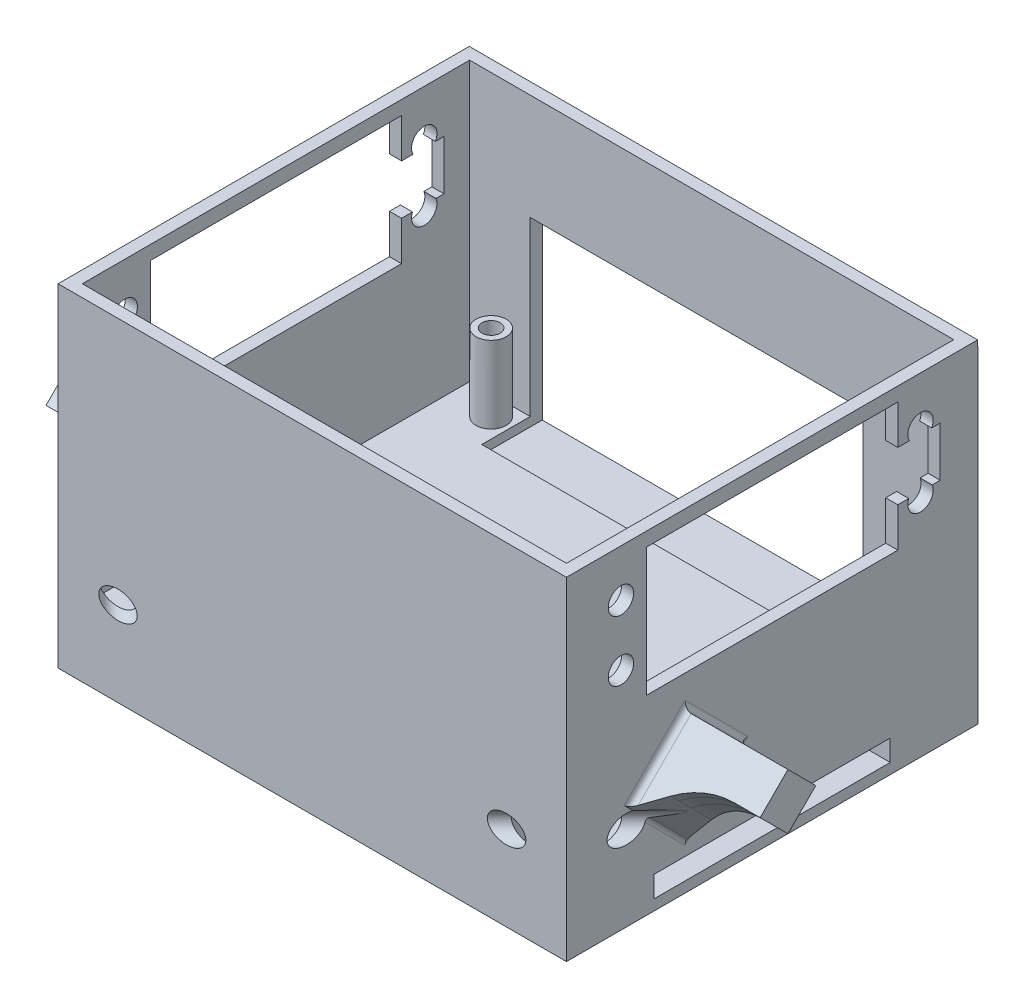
ISO-10303-21;
HEADER;
FILE_DESCRIPTION(('STEP AP214'),'2;1');
FILE_NAME('part.step','',(''),(''),'','','');
FILE_SCHEMA(('AUTOMOTIVE_DESIGN { 1 0 10303 214 1 1 1 1 }'));
ENDSEC;
DATA;
#1=APPLICATION_CONTEXT('core data for automotive mechanical design processes');
#2=APPLICATION_PROTOCOL_DEFINITION('international standard','automotive_design',2000,#1);
#3=PRODUCT_CONTEXT('',#1,'mechanical');
#4=PRODUCT('Part','Part','',(#3));
#5=PRODUCT_RELATED_PRODUCT_CATEGORY('part','',(#4));
#6=PRODUCT_DEFINITION_FORMATION('','',#4);
#7=PRODUCT_DEFINITION_CONTEXT('part definition',#1,'design');
#8=PRODUCT_DEFINITION('design','',#6,#7);
#9=PRODUCT_DEFINITION_SHAPE('','',#8);
#10=(LENGTH_UNIT() NAMED_UNIT(*) SI_UNIT(.MILLI.,.METRE.));
#11=(NAMED_UNIT(*) PLANE_ANGLE_UNIT() SI_UNIT($,.RADIAN.));
#12=(NAMED_UNIT(*) SI_UNIT($,.STERADIAN.) SOLID_ANGLE_UNIT());
#13=UNCERTAINTY_MEASURE_WITH_UNIT(LENGTH_MEASURE(1.E-05),#10,'distance_accuracy_value','');
#14=(GEOMETRIC_REPRESENTATION_CONTEXT(3) GLOBAL_UNCERTAINTY_ASSIGNED_CONTEXT((#13)) GLOBAL_UNIT_ASSIGNED_CONTEXT((#10,
#11,#12)) REPRESENTATION_CONTEXT('',''));
#15=CARTESIAN_POINT('',(0.,0.,0.));
#16=DIRECTION('',(0.,0.,1.));
#17=DIRECTION('',(1.,0.,0.));
#18=AXIS2_PLACEMENT_3D('',#15,#16,#17);
#19=CARTESIAN_POINT('',(0.,45.,-2.));
#20=DIRECTION('',(0.,0.,1.));
#21=DIRECTION('',(1.,0.,0.));
#22=AXIS2_PLACEMENT_3D('',#19,#20,#21);
#23=PLANE('',#22);
#24=DIRECTION('',(0.,-1.,0.));
#25=VECTOR('',#24,1.);
#26=CARTESIAN_POINT('',(82.,45.,-2.));
#27=LINE('',#26,#25);
#28=CARTESIAN_POINT('',(82.,45.,-2.));
#29=VERTEX_POINT('',#28);
#30=CARTESIAN_POINT('',(82.,-9.,-2.));
#31=VERTEX_POINT('',#30);
#32=EDGE_CURVE('E878',#29,#31,#27,.T.);
#33=ORIENTED_EDGE('',*,*,#32,.T.);
#34=DIRECTION('',(1.,0.,0.));
#35=VECTOR('',#34,1.);
#36=CARTESIAN_POINT('',(82.,-9.,-2.));
#37=LINE('',#36,#35);
#38=CARTESIAN_POINT('',(-2.,-9.,-2.));
#39=VERTEX_POINT('',#38);
#40=EDGE_CURVE('E635',#39,#31,#37,.T.);
#41=ORIENTED_EDGE('',*,*,#40,.F.);
#42=DIRECTION('',(0.,-1.,0.));
#43=VECTOR('',#42,1.);
#44=CARTESIAN_POINT('',(-2.,45.,-1.99999999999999));
#45=LINE('',#44,#43);
#46=CARTESIAN_POINT('',(-2.,45.,-2.));
#47=VERTEX_POINT('',#46);
#48=EDGE_CURVE('E871',#47,#39,#45,.T.);
#49=ORIENTED_EDGE('',*,*,#48,.F.);
#50=DIRECTION('',(-1.,0.,0.));
#51=VECTOR('',#50,1.);
#52=CARTESIAN_POINT('',(0.,45.,-2.));
#53=LINE('',#52,#51);
#54=EDGE_CURVE('E877',#29,#47,#53,.T.);
#55=ORIENTED_EDGE('',*,*,#54,.F.);
#56=EDGE_LOOP('',(#33,#41,#49,#55));
#57=FACE_BOUND('',#56,.T.);
#58=DIRECTION('',(0.,1.,0.));
#59=VECTOR('',#58,1.);
#60=CARTESIAN_POINT('',(10.,28.5,-2.));
#61=LINE('',#60,#59);
#62=CARTESIAN_POINT('',(10.,-1.5,-2.));
#63=VERTEX_POINT('',#62);
#64=CARTESIAN_POINT('',(10.,28.5,-2.));
#65=VERTEX_POINT('',#64);
#66=EDGE_CURVE('E506',#63,#65,#61,.T.);
#67=ORIENTED_EDGE('',*,*,#66,.F.);
#68=DIRECTION('',(-1.,0.,0.));
#69=VECTOR('',#68,1.);
#70=CARTESIAN_POINT('',(0.,-1.5,-2.));
#71=LINE('',#70,#69);
#72=CARTESIAN_POINT('',(65.,-1.5,-2.));
#73=VERTEX_POINT('',#72);
#74=EDGE_CURVE('E63',#63,#73,#71,.F.);
#75=ORIENTED_EDGE('',*,*,#74,.T.);
#76=DIRECTION('',(0.,-1.,0.));
#77=VECTOR('',#76,1.);
#78=CARTESIAN_POINT('',(65.,28.5,-2.));
#79=LINE('',#78,#77);
#80=CARTESIAN_POINT('',(65.,28.5,-2.));
#81=VERTEX_POINT('',#80);
#82=EDGE_CURVE('E498',#81,#73,#79,.T.);
#83=ORIENTED_EDGE('',*,*,#82,.F.);
#84=DIRECTION('',(1.,0.,0.));
#85=VECTOR('',#84,1.);
#86=CARTESIAN_POINT('',(65.,28.5,-2.));
#87=LINE('',#86,#85);
#88=EDGE_CURVE('E495',#65,#81,#87,.T.);
#89=ORIENTED_EDGE('',*,*,#88,.F.);
#90=EDGE_LOOP('',(#67,#75,#83,#89));
#91=FACE_BOUND('',#90,.T.);
#92=ADVANCED_FACE('F50',(#57,#91),#23,.F.);
#93=CARTESIAN_POINT('',(82.,45.,0.));
#94=DIRECTION('',(-1.,0.,0.));
#95=DIRECTION('',(0.,0.,1.));
#96=AXIS2_PLACEMENT_3D('',#93,#94,#95);
#97=PLANE('',#96);
#98=CARTESIAN_POINT('',(82.,28.2,57.));
#99=DIRECTION('',(1.,0.,0.));
#100=DIRECTION('',(0.,0.,-1.));
#101=AXIS2_PLACEMENT_3D('',#98,#99,#100);
#102=CIRCLE('',#101,2.1);
#103=CARTESIAN_POINT('',(82.,28.2,54.9));
#104=VERTEX_POINT('',#103);
#105=EDGE_CURVE('E521',#104,#104,#102,.T.);
#106=ORIENTED_EDGE('',*,*,#105,.F.);
#107=EDGE_LOOP('',(#106));
#108=FACE_BOUND('',#107,.T.);
#109=CARTESIAN_POINT('',(82.,38.2,57.));
#110=DIRECTION('',(1.,0.,0.));
#111=DIRECTION('',(0.,0.,-1.));
#112=AXIS2_PLACEMENT_3D('',#109,#110,#111);
#113=CIRCLE('',#112,2.1);
#114=CARTESIAN_POINT('',(82.,38.2,54.9));
#115=VERTEX_POINT('',#114);
#116=EDGE_CURVE('E523',#115,#115,#113,.T.);
#117=ORIENTED_EDGE('',*,*,#116,.F.);
#118=EDGE_LOOP('',(#117));
#119=FACE_BOUND('',#118,.T.);
#120=DIRECTION('',(0.,0.,-1.));
#121=VECTOR('',#120,1.);
#122=CARTESIAN_POINT('',(82.,-7.25,51.5));
#123=LINE('',#122,#121);
#124=CARTESIAN_POINT('',(82.,-7.25,51.5));
#125=VERTEX_POINT('',#124);
#126=CARTESIAN_POINT('',(82.,-7.25,12.5));
#127=VERTEX_POINT('',#126);
#128=EDGE_CURVE('E601',#125,#127,#123,.T.);
#129=ORIENTED_EDGE('',*,*,#128,.F.);
#130=DIRECTION('',(0.,-1.,0.));
#131=VECTOR('',#130,1.);
#132=CARTESIAN_POINT('',(82.,-7.25,51.5));
#133=LINE('',#132,#131);
#134=CARTESIAN_POINT('',(82.,-3.74999999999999,51.5));
#135=VERTEX_POINT('',#134);
#136=EDGE_CURVE('E603',#135,#125,#133,.T.);
#137=ORIENTED_EDGE('',*,*,#136,.F.);
#138=DIRECTION('',(0.,0.,1.));
#139=VECTOR('',#138,1.);
#140=CARTESIAN_POINT('',(82.,-3.74999999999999,51.5));
#141=LINE('',#140,#139);
#142=CARTESIAN_POINT('',(82.,-3.75,12.5));
#143=VERTEX_POINT('',#142);
#144=EDGE_CURVE('E612',#143,#135,#141,.T.);
#145=ORIENTED_EDGE('',*,*,#144,.F.);
#146=DIRECTION('',(0.,1.,0.));
#147=VECTOR('',#146,1.);
#148=CARTESIAN_POINT('',(82.,-7.25,12.5));
#149=LINE('',#148,#147);
#150=EDGE_CURVE('E607',#127,#143,#149,.T.);
#151=ORIENTED_EDGE('',*,*,#150,.F.);
#152=EDGE_LOOP('',(#129,#137,#145,#151));
#153=FACE_BOUND('',#152,.T.);
#154=DIRECTION('',(0.,-1.,0.));
#155=VECTOR('',#154,1.);
#156=CARTESIAN_POINT('',(82.,45.,66.));
#157=LINE('',#156,#155);
#158=CARTESIAN_POINT('',(82.,46.,66.));
#159=VERTEX_POINT('',#158);
#160=CARTESIAN_POINT('',(82.,-9.,66.));
#161=VERTEX_POINT('',#160);
#162=EDGE_CURVE('E874',#159,#161,#157,.T.);
#163=ORIENTED_EDGE('',*,*,#162,.T.);
#164=DIRECTION('',(0.,0.,1.));
#165=VECTOR('',#164,1.);
#166=CARTESIAN_POINT('',(82.,-9.,66.));
#167=LINE('',#166,#165);
#168=EDGE_CURVE('E617',#31,#161,#167,.T.);
#169=ORIENTED_EDGE('',*,*,#168,.F.);
#170=ORIENTED_EDGE('',*,*,#32,.F.);
#171=DIRECTION('',(0.,0.,-1.));
#172=VECTOR('',#171,1.);
#173=CARTESIAN_POINT('',(82.,45.,0.));
#174=LINE('',#173,#172);
#175=CARTESIAN_POINT('',(82.,45.,-1.93662119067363));
#176=VERTEX_POINT('',#175);
#177=EDGE_CURVE('E883',#176,#29,#174,.T.);
#178=ORIENTED_EDGE('',*,*,#177,.F.);
#179=DIRECTION('',(0.,-1.,0.));
#180=VECTOR('',#179,1.);
#181=CARTESIAN_POINT('',(82.,46.,-1.93662119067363));
#182=LINE('',#181,#180);
#183=CARTESIAN_POINT('',(82.,46.,-1.93662119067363));
#184=VERTEX_POINT('',#183);
#185=EDGE_CURVE('E598',#184,#176,#182,.T.);
#186=ORIENTED_EDGE('',*,*,#185,.F.);
#187=DIRECTION('',(0.,0.,-1.));
#188=VECTOR('',#187,1.);
#189=CARTESIAN_POINT('',(82.,46.,66.));
#190=LINE('',#189,#188);
#191=EDGE_CURVE('E592',#159,#184,#190,.T.);
#192=ORIENTED_EDGE('',*,*,#191,.F.);
#193=EDGE_LOOP('',(#163,#169,#170,#178,#186,#192));
#194=FACE_BOUND('',#193,.T.);
#195=DIRECTION('',(0.,0.707106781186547,0.707106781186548));
#196=VECTOR('',#195,1.);
#197=CARTESIAN_POINT('',(82.,7.84952976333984,55.7466643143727));
#198=LINE('',#197,#196);
#199=CARTESIAN_POINT('',(82.,7.11404458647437,55.0111791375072));
#200=VERTEX_POINT('',#199);
#201=CARTESIAN_POINT('',(82.,8.55663654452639,56.4537710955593));
#202=VERTEX_POINT('',#201);
#203=EDGE_CURVE('E914',#200,#202,#198,.T.);
#204=ORIENTED_EDGE('',*,*,#203,.T.);
#205=DIRECTION('',(0.,-0.707106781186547,0.707106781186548));
#206=VECTOR('',#205,1.);
#207=CARTESIAN_POINT('',(82.,17.8994949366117,47.110912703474));
#208=LINE('',#207,#206);
#209=CARTESIAN_POINT('',(82.,18.6066017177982,46.4038059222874));
#210=VERTEX_POINT('',#209);
#211=EDGE_CURVE('E1553',#202,#210,#208,.F.);
#212=ORIENTED_EDGE('',*,*,#211,.T.);
#213=DIRECTION('',(0.,0.707106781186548,0.707106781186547));
#214=VECTOR('',#213,1.);
#215=CARTESIAN_POINT('',(82.,8.55663654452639,36.3538407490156));
#216=LINE('',#215,#214);
#217=CARTESIAN_POINT('',(82.,8.22690723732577,36.024111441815));
#218=VERTEX_POINT('',#217);
#219=EDGE_CURVE('E1554',#210,#218,#216,.F.);
#220=ORIENTED_EDGE('',*,*,#219,.T.);
#221=DIRECTION('',(0.,0.707106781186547,-0.707106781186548));
#222=VECTOR('',#221,1.);
#223=CARTESIAN_POINT('',(82.,-1.82305793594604,46.0740766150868));
#224=LINE('',#223,#222);
#225=CARTESIAN_POINT('',(82.,-2.15278724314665,46.4038059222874));
#226=VERTEX_POINT('',#225);
#227=EDGE_CURVE('E1552',#218,#226,#224,.F.);
#228=ORIENTED_EDGE('',*,*,#227,.T.);
#229=DIRECTION('',(0.,-0.707106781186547,-0.707106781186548));
#230=VECTOR('',#229,1.);
#231=CARTESIAN_POINT('',(82.,4.69180644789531,53.2483996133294));
#232=LINE('',#231,#230);
#233=CARTESIAN_POINT('',(82.,4.45624809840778,53.0128412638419));
#234=VERTEX_POINT('',#233);
#235=EDGE_CURVE('E1548',#226,#234,#232,.F.);
#236=ORIENTED_EDGE('',*,*,#235,.T.);
#237=CARTESIAN_POINT('',(82.,5.,56.1005050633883));
#238=DIRECTION('',(-1.,0.,0.));
#239=DIRECTION('',(0.,0.,-1.));
#240=AXIS2_PLACEMENT_3D('',#237,#238,#239);
#241=ELLIPSE('',#240,3.18198051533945,2.24999999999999);
#242=EDGE_CURVE('E701',#234,#200,#241,.T.);
#243=ORIENTED_EDGE('',*,*,#242,.T.);
#244=EDGE_LOOP('',(#204,#212,#220,#228,#236,#243));
#245=FACE_BOUND('',#244,.T.);
#246=CARTESIAN_POINT('',(82.,38.2,7.49999999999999));
#247=DIRECTION('',(1.,0.,0.));
#248=DIRECTION('',(0.,0.,-1.));
#249=AXIS2_PLACEMENT_3D('',#246,#247,#248);
#250=CIRCLE('',#249,2.1);
#251=CARTESIAN_POINT('',(82.,37.2,5.65338146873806));
#252=VERTEX_POINT('',#251);
#253=CARTESIAN_POINT('',(82.,37.2,9.34661853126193));
#254=VERTEX_POINT('',#253);
#255=EDGE_CURVE('E516',#252,#254,#250,.T.);
#256=ORIENTED_EDGE('',*,*,#255,.F.);
#257=DIRECTION('',(0.,0.,1.));
#258=VECTOR('',#257,1.);
#259=CARTESIAN_POINT('',(82.,37.2,11.25));
#260=LINE('',#259,#258);
#261=CARTESIAN_POINT('',(82.,37.2,4.25));
#262=VERTEX_POINT('',#261);
#263=EDGE_CURVE('E746',#262,#252,#260,.T.);
#264=ORIENTED_EDGE('',*,*,#263,.F.);
#265=DIRECTION('',(0.,1.,0.));
#266=VECTOR('',#265,1.);
#267=CARTESIAN_POINT('',(82.,37.2,4.25));
#268=LINE('',#267,#266);
#269=CARTESIAN_POINT('',(82.,29.,4.25));
#270=VERTEX_POINT('',#269);
#271=EDGE_CURVE('E741',#270,#262,#268,.T.);
#272=ORIENTED_EDGE('',*,*,#271,.F.);
#273=DIRECTION('',(0.,0.,-1.));
#274=VECTOR('',#273,1.);
#275=CARTESIAN_POINT('',(82.,29.,4.25));
#276=LINE('',#275,#274);
#277=CARTESIAN_POINT('',(82.,29.,5.55835121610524));
#278=VERTEX_POINT('',#277);
#279=EDGE_CURVE('E739',#278,#270,#276,.T.);
#280=ORIENTED_EDGE('',*,*,#279,.F.);
#281=CARTESIAN_POINT('',(82.,28.2,7.50000000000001));
#282=DIRECTION('',(1.,0.,0.));
#283=DIRECTION('',(0.,0.,-1.));
#284=AXIS2_PLACEMENT_3D('',#281,#282,#283);
#285=CIRCLE('',#284,2.1);
#286=CARTESIAN_POINT('',(82.,29.,9.44164878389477));
#287=VERTEX_POINT('',#286);
#288=EDGE_CURVE('E524',#287,#278,#285,.T.);
#289=ORIENTED_EDGE('',*,*,#288,.F.);
#290=CARTESIAN_POINT('',(82.,29.,11.25));
#291=VERTEX_POINT('',#290);
#292=EDGE_CURVE('E742',#291,#287,#276,.T.);
#293=ORIENTED_EDGE('',*,*,#292,.F.);
#294=DIRECTION('',(0.,1.,0.));
#295=VECTOR('',#294,1.);
#296=CARTESIAN_POINT('',(82.,29.,11.25));
#297=LINE('',#296,#295);
#298=CARTESIAN_POINT('',(82.,22.5,11.25));
#299=VERTEX_POINT('',#298);
#300=EDGE_CURVE('E740',#299,#291,#297,.T.);
#301=ORIENTED_EDGE('',*,*,#300,.F.);
#302=DIRECTION('',(0.,0.,-1.));
#303=VECTOR('',#302,1.);
#304=CARTESIAN_POINT('',(82.,22.5,11.25));
#305=LINE('',#304,#303);
#306=CARTESIAN_POINT('',(82.,22.5,52.75));
#307=VERTEX_POINT('',#306);
#308=EDGE_CURVE('E710',#307,#299,#305,.T.);
#309=ORIENTED_EDGE('',*,*,#308,.F.);
#310=DIRECTION('',(0.,-1.,0.));
#311=VECTOR('',#310,1.);
#312=CARTESIAN_POINT('',(82.,22.5,52.75));
#313=LINE('',#312,#311);
#314=CARTESIAN_POINT('',(82.,43.7,52.75));
#315=VERTEX_POINT('',#314);
#316=EDGE_CURVE('E715',#315,#307,#313,.T.);
#317=ORIENTED_EDGE('',*,*,#316,.F.);
#318=DIRECTION('',(0.,0.,1.));
#319=VECTOR('',#318,1.);
#320=CARTESIAN_POINT('',(82.,43.7,52.75));
#321=LINE('',#320,#319);
#322=CARTESIAN_POINT('',(82.,43.7,11.25));
#323=VERTEX_POINT('',#322);
#324=EDGE_CURVE('E754',#323,#315,#321,.T.);
#325=ORIENTED_EDGE('',*,*,#324,.F.);
#326=DIRECTION('',(0.,1.,0.));
#327=VECTOR('',#326,1.);
#328=CARTESIAN_POINT('',(82.,43.7,11.25));
#329=LINE('',#328,#327);
#330=CARTESIAN_POINT('',(82.,37.2,11.25));
#331=VERTEX_POINT('',#330);
#332=EDGE_CURVE('E753',#331,#323,#329,.T.);
#333=ORIENTED_EDGE('',*,*,#332,.F.);
#334=EDGE_CURVE('E747',#254,#331,#260,.T.);
#335=ORIENTED_EDGE('',*,*,#334,.F.);
#336=EDGE_LOOP('',(#256,#264,#272,#280,#289,#293,#301,#309,#317,#325,#333,#335));
#337=FACE_BOUND('',#336,.T.);
#338=ADVANCED_FACE('F1171',(#108,#119,#153,#194,#245,#337),#97,.F.);
#339=CARTESIAN_POINT('',(-2.,29.,4.25));
#340=DIRECTION('',(0.,-1.,0.));
#341=DIRECTION('',(0.,0.,-1.));
#342=AXIS2_PLACEMENT_3D('',#339,#340,#341);
#343=PLANE('',#342);
#344=DIRECTION('',(0.,0.,1.));
#345=VECTOR('',#344,1.);
#346=CARTESIAN_POINT('',(80.,29.,0.));
#347=LINE('',#346,#345);
#348=CARTESIAN_POINT('',(80.,29.,4.25));
#349=VERTEX_POINT('',#348);
#350=CARTESIAN_POINT('',(80.,29.,5.55835121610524));
#351=VERTEX_POINT('',#350);
#352=EDGE_CURVE('E897',#349,#351,#347,.T.);
#353=ORIENTED_EDGE('',*,*,#352,.T.);
#354=DIRECTION('',(1.,0.,0.));
#355=VECTOR('',#354,1.);
#356=CARTESIAN_POINT('',(-19.,29.,5.55835121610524));
#357=LINE('',#356,#355);
#358=EDGE_CURVE('E536',#351,#278,#357,.T.);
#359=ORIENTED_EDGE('',*,*,#358,.T.);
#360=ORIENTED_EDGE('',*,*,#279,.T.);
#361=DIRECTION('',(1.,0.,0.));
#362=VECTOR('',#361,1.);
#363=CARTESIAN_POINT('',(-2.,29.,4.25));
#364=LINE('',#363,#362);
#365=EDGE_CURVE('E782',#349,#270,#364,.T.);
#366=ORIENTED_EDGE('',*,*,#365,.F.);
#367=EDGE_LOOP('',(#353,#359,#360,#366));
#368=FACE_BOUND('',#367,.T.);
#369=ADVANCED_FACE('F1179',(#368),#343,.F.);
#370=CARTESIAN_POINT('',(-2.,37.2,11.25));
#371=DIRECTION('',(0.,1.,0.));
#372=DIRECTION('',(0.,0.,1.));
#373=AXIS2_PLACEMENT_3D('',#370,#371,#372);
#374=PLANE('',#373);
#375=DIRECTION('',(0.,0.,-1.));
#376=VECTOR('',#375,1.);
#377=CARTESIAN_POINT('',(80.,37.2,0.));
#378=LINE('',#377,#376);
#379=CARTESIAN_POINT('',(80.,37.2,11.25));
#380=VERTEX_POINT('',#379);
#381=CARTESIAN_POINT('',(80.,37.2,9.34661853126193));
#382=VERTEX_POINT('',#381);
#383=EDGE_CURVE('E901',#380,#382,#378,.T.);
#384=ORIENTED_EDGE('',*,*,#383,.T.);
#385=DIRECTION('',(1.,0.,0.));
#386=VECTOR('',#385,1.);
#387=CARTESIAN_POINT('',(-19.,37.2,9.34661853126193));
#388=LINE('',#387,#386);
#389=EDGE_CURVE('E551',#382,#254,#388,.T.);
#390=ORIENTED_EDGE('',*,*,#389,.T.);
#391=ORIENTED_EDGE('',*,*,#334,.T.);
#392=DIRECTION('',(1.,0.,0.));
#393=VECTOR('',#392,1.);
#394=CARTESIAN_POINT('',(-2.,37.2,11.25));
#395=LINE('',#394,#393);
#396=EDGE_CURVE('E773',#380,#331,#395,.T.);
#397=ORIENTED_EDGE('',*,*,#396,.F.);
#398=EDGE_LOOP('',(#384,#390,#391,#397));
#399=FACE_BOUND('',#398,.T.);
#400=ADVANCED_FACE('F1290',(#399),#374,.F.);
#401=DIRECTION('',(0.,0.,1.));
#402=VECTOR('',#401,1.);
#403=CARTESIAN_POINT('',(-2.,37.2,11.25));
#404=LINE('',#403,#402);
#405=CARTESIAN_POINT('',(-2.,37.2,9.34661853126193));
#406=VERTEX_POINT('',#405);
#407=CARTESIAN_POINT('',(-2.,37.2,11.25));
#408=VERTEX_POINT('',#407);
#409=EDGE_CURVE('E725',#406,#408,#404,.T.);
#410=ORIENTED_EDGE('',*,*,#409,.F.);
#411=DIRECTION('',(1.,0.,0.));
#412=VECTOR('',#411,1.);
#413=CARTESIAN_POINT('',(-19.,37.2,9.34661853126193));
#414=LINE('',#413,#412);
#415=CARTESIAN_POINT('',(0.,37.2,9.34661853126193));
#416=VERTEX_POINT('',#415);
#417=EDGE_CURVE('E1143',#406,#416,#414,.T.);
#418=ORIENTED_EDGE('',*,*,#417,.T.);
#419=DIRECTION('',(0.,0.,1.));
#420=VECTOR('',#419,1.);
#421=CARTESIAN_POINT('',(0.,37.2,64.));
#422=LINE('',#421,#420);
#423=CARTESIAN_POINT('',(0.,37.2,11.25));
#424=VERTEX_POINT('',#423);
#425=EDGE_CURVE('E800',#416,#424,#422,.T.);
#426=ORIENTED_EDGE('',*,*,#425,.T.);
#427=EDGE_CURVE('E775',#408,#424,#395,.T.);
#428=ORIENTED_EDGE('',*,*,#427,.F.);
#429=EDGE_LOOP('',(#410,#418,#426,#428));
#430=FACE_BOUND('',#429,.T.);
#431=ADVANCED_FACE('F1328',(#430),#374,.F.);
#432=DIRECTION('',(0.,0.,-1.));
#433=VECTOR('',#432,1.);
#434=CARTESIAN_POINT('',(-2.,29.,4.25));
#435=LINE('',#434,#433);
#436=CARTESIAN_POINT('',(-2.,29.,5.55835121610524));
#437=VERTEX_POINT('',#436);
#438=CARTESIAN_POINT('',(-2.,29.,4.25));
#439=VERTEX_POINT('',#438);
#440=EDGE_CURVE('E711',#437,#439,#435,.T.);
#441=ORIENTED_EDGE('',*,*,#440,.F.);
#442=DIRECTION('',(1.,0.,0.));
#443=VECTOR('',#442,1.);
#444=CARTESIAN_POINT('',(-19.,29.,5.55835121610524));
#445=LINE('',#444,#443);
#446=CARTESIAN_POINT('',(0.,29.,5.55835121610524));
#447=VERTEX_POINT('',#446);
#448=EDGE_CURVE('E1133',#437,#447,#445,.T.);
#449=ORIENTED_EDGE('',*,*,#448,.T.);
#450=DIRECTION('',(0.,0.,-1.));
#451=VECTOR('',#450,1.);
#452=CARTESIAN_POINT('',(0.,29.,64.));
#453=LINE('',#452,#451);
#454=CARTESIAN_POINT('',(0.,29.,4.25));
#455=VERTEX_POINT('',#454);
#456=EDGE_CURVE('E792',#447,#455,#453,.T.);
#457=ORIENTED_EDGE('',*,*,#456,.T.);
#458=EDGE_CURVE('E776',#439,#455,#364,.T.);
#459=ORIENTED_EDGE('',*,*,#458,.F.);
#460=EDGE_LOOP('',(#441,#449,#457,#459));
#461=FACE_BOUND('',#460,.T.);
#462=ADVANCED_FACE('F1193',(#461),#343,.F.);
#463=CARTESIAN_POINT('',(0.,45.,0.));
#464=DIRECTION('',(0.,-1.,0.));
#465=DIRECTION('',(0.,0.,-1.));
#466=AXIS2_PLACEMENT_3D('',#463,#464,#465);
#467=PLANE('',#466);
#468=DIRECTION('',(-1.,0.,0.));
#469=VECTOR('',#468,1.);
#470=CARTESIAN_POINT('',(-2.,45.,-1.93662119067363));
#471=LINE('',#470,#469);
#472=CARTESIAN_POINT('',(-2.,45.,-1.93662119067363));
#473=VERTEX_POINT('',#472);
#474=EDGE_CURVE('E584',#176,#473,#471,.T.);
#475=ORIENTED_EDGE('',*,*,#474,.F.);
#476=ORIENTED_EDGE('',*,*,#177,.T.);
#477=ORIENTED_EDGE('',*,*,#54,.T.);
#478=DIRECTION('',(0.,0.,1.));
#479=VECTOR('',#478,1.);
#480=CARTESIAN_POINT('',(-2.,45.,0.));
#481=LINE('',#480,#479);
#482=EDGE_CURVE('E868',#47,#473,#481,.T.);
#483=ORIENTED_EDGE('',*,*,#482,.T.);
#484=EDGE_LOOP('',(#475,#476,#477,#483));
#485=FACE_BOUND('',#484,.T.);
#486=ADVANCED_FACE('F1186',(#485),#467,.F.);
#487=CARTESIAN_POINT('',(-2.,45.,64.));
#488=DIRECTION('',(1.,0.,0.));
#489=DIRECTION('',(0.,0.,-1.));
#490=AXIS2_PLACEMENT_3D('',#487,#488,#489);
#491=PLANE('',#490);
#492=CARTESIAN_POINT('',(-2.,28.2,57.));
#493=DIRECTION('',(1.,0.,0.));
#494=DIRECTION('',(0.,0.,-1.));
#495=AXIS2_PLACEMENT_3D('',#492,#493,#494);
#496=CIRCLE('',#495,2.1);
#497=CARTESIAN_POINT('',(-2.,28.2,54.9));
#498=VERTEX_POINT('',#497);
#499=EDGE_CURVE('E570',#498,#498,#496,.T.);
#500=ORIENTED_EDGE('',*,*,#499,.T.);
#501=EDGE_LOOP('',(#500));
#502=FACE_BOUND('',#501,.T.);
#503=CARTESIAN_POINT('',(-2.,38.2,57.));
#504=DIRECTION('',(1.,0.,0.));
#505=DIRECTION('',(0.,0.,-1.));
#506=AXIS2_PLACEMENT_3D('',#503,#504,#505);
#507=CIRCLE('',#506,2.1);
#508=CARTESIAN_POINT('',(-2.,38.2,54.9));
#509=VERTEX_POINT('',#508);
#510=EDGE_CURVE('E557',#509,#509,#507,.T.);
#511=ORIENTED_EDGE('',*,*,#510,.T.);
#512=EDGE_LOOP('',(#511));
#513=FACE_BOUND('',#512,.T.);
#514=DIRECTION('',(0.,0.,1.));
#515=VECTOR('',#514,1.);
#516=CARTESIAN_POINT('',(-2.,-3.74999999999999,64.));
#517=LINE('',#516,#515);
#518=CARTESIAN_POINT('',(-2.,-3.75,12.5));
#519=VERTEX_POINT('',#518);
#520=CARTESIAN_POINT('',(-2.,-3.74999999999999,51.5));
#521=VERTEX_POINT('',#520);
#522=EDGE_CURVE('E1609',#519,#521,#517,.T.);
#523=ORIENTED_EDGE('',*,*,#522,.T.);
#524=DIRECTION('',(0.,-1.,0.));
#525=VECTOR('',#524,1.);
#526=CARTESIAN_POINT('',(-2.,45.,51.5));
#527=LINE('',#526,#525);
#528=CARTESIAN_POINT('',(-2.,-7.25,51.5));
#529=VERTEX_POINT('',#528);
#530=EDGE_CURVE('E1610',#521,#529,#527,.T.);
#531=ORIENTED_EDGE('',*,*,#530,.T.);
#532=DIRECTION('',(0.,0.,-1.));
#533=VECTOR('',#532,1.);
#534=CARTESIAN_POINT('',(-2.,-7.25,64.));
#535=LINE('',#534,#533);
#536=CARTESIAN_POINT('',(-2.,-7.25,12.5));
#537=VERTEX_POINT('',#536);
#538=EDGE_CURVE('E1617',#529,#537,#535,.T.);
#539=ORIENTED_EDGE('',*,*,#538,.T.);
#540=DIRECTION('',(0.,1.,0.));
#541=VECTOR('',#540,1.);
#542=CARTESIAN_POINT('',(-2.,45.,12.5));
#543=LINE('',#542,#541);
#544=EDGE_CURVE('E1612',#537,#519,#543,.T.);
#545=ORIENTED_EDGE('',*,*,#544,.T.);
#546=EDGE_LOOP('',(#523,#531,#539,#545));
#547=FACE_BOUND('',#546,.T.);
#548=ORIENTED_EDGE('',*,*,#48,.T.);
#549=DIRECTION('',(0.,0.,-1.));
#550=VECTOR('',#549,1.);
#551=CARTESIAN_POINT('',(-2.,-9.,66.));
#552=LINE('',#551,#550);
#553=CARTESIAN_POINT('',(-2.,-9.,66.));
#554=VERTEX_POINT('',#553);
#555=EDGE_CURVE('E627',#554,#39,#552,.T.);
#556=ORIENTED_EDGE('',*,*,#555,.F.);
#557=DIRECTION('',(0.,-1.,0.));
#558=VECTOR('',#557,1.);
#559=CARTESIAN_POINT('',(-1.99999999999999,45.,66.));
#560=LINE('',#559,#558);
#561=CARTESIAN_POINT('',(-2.,46.,66.));
#562=VERTEX_POINT('',#561);
#563=EDGE_CURVE('E869',#562,#554,#560,.T.);
#564=ORIENTED_EDGE('',*,*,#563,.F.);
#565=DIRECTION('',(0.,0.,1.));
#566=VECTOR('',#565,1.);
#567=CARTESIAN_POINT('',(-2.,46.,66.));
#568=LINE('',#567,#566);
#569=CARTESIAN_POINT('',(-2.,46.,-1.93662119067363));
#570=VERTEX_POINT('',#569);
#571=EDGE_CURVE('E581',#570,#562,#568,.T.);
#572=ORIENTED_EDGE('',*,*,#571,.F.);
#573=DIRECTION('',(0.,-1.,0.));
#574=VECTOR('',#573,1.);
#575=CARTESIAN_POINT('',(-2.,46.,-1.93662119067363));
#576=LINE('',#575,#574);
#577=EDGE_CURVE('E593',#570,#473,#576,.T.);
#578=ORIENTED_EDGE('',*,*,#577,.T.);
#579=ORIENTED_EDGE('',*,*,#482,.F.);
#580=EDGE_LOOP('',(#548,#556,#564,#572,#578,#579));
#581=FACE_BOUND('',#580,.T.);
#582=CARTESIAN_POINT('',(-2.,37.2,4.25));
#583=VERTEX_POINT('',#582);
#584=CARTESIAN_POINT('',(-2.,37.2,5.65338146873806));
#585=VERTEX_POINT('',#584);
#586=EDGE_CURVE('E724',#583,#585,#404,.T.);
#587=ORIENTED_EDGE('',*,*,#586,.T.);
#588=CARTESIAN_POINT('',(-2.,38.2,7.49999999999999));
#589=DIRECTION('',(1.,0.,0.));
#590=DIRECTION('',(0.,0.,-1.));
#591=AXIS2_PLACEMENT_3D('',#588,#589,#590);
#592=CIRCLE('',#591,2.1);
#593=EDGE_CURVE('E544',#585,#406,#592,.T.);
#594=ORIENTED_EDGE('',*,*,#593,.T.);
#595=ORIENTED_EDGE('',*,*,#409,.T.);
#596=DIRECTION('',(0.,1.,0.));
#597=VECTOR('',#596,1.);
#598=CARTESIAN_POINT('',(-2.,43.7,11.25));
#599=LINE('',#598,#597);
#600=CARTESIAN_POINT('',(-2.,43.7,11.25));
#601=VERTEX_POINT('',#600);
#602=EDGE_CURVE('E727',#408,#601,#599,.T.);
#603=ORIENTED_EDGE('',*,*,#602,.T.);
#604=DIRECTION('',(0.,0.,1.));
#605=VECTOR('',#604,1.);
#606=CARTESIAN_POINT('',(-2.,43.7,52.75));
#607=LINE('',#606,#605);
#608=CARTESIAN_POINT('',(-2.,43.7,52.75));
#609=VERTEX_POINT('',#608);
#610=EDGE_CURVE('E729',#601,#609,#607,.T.);
#611=ORIENTED_EDGE('',*,*,#610,.T.);
#612=DIRECTION('',(0.,-1.,0.));
#613=VECTOR('',#612,1.);
#614=CARTESIAN_POINT('',(-2.,22.5,52.75));
#615=LINE('',#614,#613);
#616=CARTESIAN_POINT('',(-2.,22.5,52.75));
#617=VERTEX_POINT('',#616);
#618=EDGE_CURVE('E735',#609,#617,#615,.T.);
#619=ORIENTED_EDGE('',*,*,#618,.T.);
#620=DIRECTION('',(0.,0.,-1.));
#621=VECTOR('',#620,1.);
#622=CARTESIAN_POINT('',(-2.,22.5,11.25));
#623=LINE('',#622,#621);
#624=CARTESIAN_POINT('',(-2.,22.5,11.25));
#625=VERTEX_POINT('',#624);
#626=EDGE_CURVE('E709',#617,#625,#623,.T.);
#627=ORIENTED_EDGE('',*,*,#626,.T.);
#628=DIRECTION('',(0.,1.,0.));
#629=VECTOR('',#628,1.);
#630=CARTESIAN_POINT('',(-2.,29.,11.25));
#631=LINE('',#630,#629);
#632=CARTESIAN_POINT('',(-2.,29.,11.25));
#633=VERTEX_POINT('',#632);
#634=EDGE_CURVE('E712',#625,#633,#631,.T.);
#635=ORIENTED_EDGE('',*,*,#634,.T.);
#636=CARTESIAN_POINT('',(-2.,29.,9.44164878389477));
#637=VERTEX_POINT('',#636);
#638=EDGE_CURVE('E716',#633,#637,#435,.T.);
#639=ORIENTED_EDGE('',*,*,#638,.T.);
#640=CARTESIAN_POINT('',(-2.,28.2,7.50000000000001));
#641=DIRECTION('',(1.,0.,0.));
#642=DIRECTION('',(0.,0.,-1.));
#643=AXIS2_PLACEMENT_3D('',#640,#641,#642);
#644=CIRCLE('',#643,2.1);
#645=EDGE_CURVE('E535',#637,#437,#644,.T.);
#646=ORIENTED_EDGE('',*,*,#645,.T.);
#647=ORIENTED_EDGE('',*,*,#440,.T.);
#648=DIRECTION('',(0.,1.,0.));
#649=VECTOR('',#648,1.);
#650=CARTESIAN_POINT('',(-2.,37.2,4.25));
#651=LINE('',#650,#649);
#652=EDGE_CURVE('E718',#439,#583,#651,.T.);
#653=ORIENTED_EDGE('',*,*,#652,.T.);
#654=EDGE_LOOP('',(#587,#594,#595,#603,#611,#619,#627,#635,#639,#646,#647,#653));
#655=FACE_BOUND('',#654,.T.);
#656=CARTESIAN_POINT('',(-2.,5.,56.1005050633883));
#657=DIRECTION('',(1.,0.,0.));
#658=DIRECTION('',(0.,0.,-1.));
#659=AXIS2_PLACEMENT_3D('',#656,#657,#658);
#660=ELLIPSE('',#659,3.18198051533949,2.25);
#661=CARTESIAN_POINT('',(-2.,7.11404458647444,55.0111791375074));
#662=VERTEX_POINT('',#661);
#663=CARTESIAN_POINT('',(-2.,4.45624809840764,53.0128412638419));
#664=VERTEX_POINT('',#663);
#665=EDGE_CURVE('E692',#662,#664,#660,.T.);
#666=ORIENTED_EDGE('',*,*,#665,.T.);
#667=DIRECTION('',(0.,0.707106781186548,0.707106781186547));
#668=VECTOR('',#667,1.);
#669=CARTESIAN_POINT('',(-2.,-1.82305793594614,46.7335352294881));
#670=LINE('',#669,#668);
#671=CARTESIAN_POINT('',(-2.,-2.15278724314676,46.4038059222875));
#672=VERTEX_POINT('',#671);
#673=EDGE_CURVE('E1597',#664,#672,#670,.F.);
#674=ORIENTED_EDGE('',*,*,#673,.T.);
#675=DIRECTION('',(0.,-0.707106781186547,0.707106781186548));
#676=VECTOR('',#675,1.);
#677=CARTESIAN_POINT('',(-2.,7.51980045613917,36.7312182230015));
#678=LINE('',#677,#676);
#679=CARTESIAN_POINT('',(-2.,8.22690723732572,36.024111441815));
#680=VERTEX_POINT('',#679);
#681=EDGE_CURVE('E1594',#672,#680,#678,.F.);
#682=ORIENTED_EDGE('',*,*,#681,.T.);
#683=DIRECTION('',(0.,-0.707106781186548,-0.707106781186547));
#684=VECTOR('',#683,1.);
#685=CARTESIAN_POINT('',(-2.,17.8994949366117,45.6966991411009));
#686=LINE('',#685,#684);
#687=CARTESIAN_POINT('',(-2.,18.6066017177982,46.4038059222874));
#688=VERTEX_POINT('',#687);
#689=EDGE_CURVE('E1593',#680,#688,#686,.F.);
#690=ORIENTED_EDGE('',*,*,#689,.T.);
#691=DIRECTION('',(0.,0.707106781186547,-0.707106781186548));
#692=VECTOR('',#691,1.);
#693=CARTESIAN_POINT('',(-2.,8.55663654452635,56.4537710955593));
#694=LINE('',#693,#692);
#695=CARTESIAN_POINT('',(-2.,8.55663654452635,56.4537710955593));
#696=VERTEX_POINT('',#695);
#697=EDGE_CURVE('E1535',#688,#696,#694,.F.);
#698=ORIENTED_EDGE('',*,*,#697,.T.);
#699=DIRECTION('',(0.,-0.707106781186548,-0.707106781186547));
#700=VECTOR('',#699,1.);
#701=CARTESIAN_POINT('',(-2.,3.25333568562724,51.1504702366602));
#702=LINE('',#701,#700);
#703=EDGE_CURVE('E922',#696,#662,#702,.T.);
#704=ORIENTED_EDGE('',*,*,#703,.T.);
#705=EDGE_LOOP('',(#666,#674,#682,#690,#698,#704));
#706=FACE_BOUND('',#705,.T.);
#707=ADVANCED_FACE('F1187',(#502,#513,#547,#581,#655,#706),#491,.F.);
#708=CARTESIAN_POINT('',(80.,45.,66.));
#709=DIRECTION('',(0.,0.,-1.));
#710=DIRECTION('',(-1.,0.,0.));
#711=AXIS2_PLACEMENT_3D('',#708,#709,#710);
#712=PLANE('',#711);
#713=CARTESIAN_POINT('',(7.89949493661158,5.,66.));
#714=DIRECTION('',(0.,0.,-1.));
#715=DIRECTION('',(-1.,0.,0.));
#716=AXIS2_PLACEMENT_3D('',#713,#714,#715);
#717=ELLIPSE('',#716,3.18198051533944,2.25);
#718=CARTESIAN_POINT('',(4.71751442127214,5.,66.));
#719=VERTEX_POINT('',#718);
#720=EDGE_CURVE('E691',#719,#719,#717,.T.);
#721=ORIENTED_EDGE('',*,*,#720,.T.);
#722=EDGE_LOOP('',(#721));
#723=FACE_BOUND('',#722,.T.);
#724=CARTESIAN_POINT('',(72.1005050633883,5.,66.));
#725=DIRECTION('',(0.,0.,-1.));
#726=DIRECTION('',(1.,0.,0.));
#727=AXIS2_PLACEMENT_3D('',#724,#725,#726);
#728=ELLIPSE('',#727,3.18198051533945,2.24999999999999);
#729=CARTESIAN_POINT('',(75.2824855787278,5.,66.));
#730=VERTEX_POINT('',#729);
#731=EDGE_CURVE('E703',#730,#730,#728,.T.);
#732=ORIENTED_EDGE('',*,*,#731,.T.);
#733=EDGE_LOOP('',(#732));
#734=FACE_BOUND('',#733,.T.);
#735=ORIENTED_EDGE('',*,*,#563,.T.);
#736=DIRECTION('',(-1.,0.,0.));
#737=VECTOR('',#736,1.);
#738=CARTESIAN_POINT('',(82.,-9.,66.));
#739=LINE('',#738,#737);
#740=EDGE_CURVE('E626',#161,#554,#739,.T.);
#741=ORIENTED_EDGE('',*,*,#740,.F.);
#742=ORIENTED_EDGE('',*,*,#162,.F.);
#743=DIRECTION('',(1.,0.,0.));
#744=VECTOR('',#743,1.);
#745=CARTESIAN_POINT('',(-2.,46.,66.));
#746=LINE('',#745,#744);
#747=EDGE_CURVE('E587',#562,#159,#746,.T.);
#748=ORIENTED_EDGE('',*,*,#747,.F.);
#749=EDGE_LOOP('',(#735,#741,#742,#748));
#750=FACE_BOUND('',#749,.T.);
#751=ADVANCED_FACE('F1185',(#723,#734,#750),#712,.F.);
#752=CARTESIAN_POINT('',(0.,45.,64.));
#753=DIRECTION('',(1.,0.,0.));
#754=DIRECTION('',(0.,0.,-1.));
#755=AXIS2_PLACEMENT_3D('',#752,#753,#754);
#756=PLANE('',#755);
#757=CARTESIAN_POINT('',(0.,38.2,7.49999999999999));
#758=DIRECTION('',(1.,0.,0.));
#759=DIRECTION('',(0.,0.,-1.));
#760=AXIS2_PLACEMENT_3D('',#757,#758,#759);
#761=CIRCLE('',#760,2.1);
#762=CARTESIAN_POINT('',(0.,37.2,5.65338146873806));
#763=VERTEX_POINT('',#762);
#764=EDGE_CURVE('E542',#763,#416,#761,.T.);
#765=ORIENTED_EDGE('',*,*,#764,.F.);
#766=CARTESIAN_POINT('',(0.,37.2,4.25));
#767=VERTEX_POINT('',#766);
#768=EDGE_CURVE('E798',#767,#763,#422,.T.);
#769=ORIENTED_EDGE('',*,*,#768,.F.);
#770=DIRECTION('',(0.,1.,0.));
#771=VECTOR('',#770,1.);
#772=CARTESIAN_POINT('',(0.,45.,4.25));
#773=LINE('',#772,#771);
#774=EDGE_CURVE('E793',#455,#767,#773,.T.);
#775=ORIENTED_EDGE('',*,*,#774,.F.);
#776=ORIENTED_EDGE('',*,*,#456,.F.);
#777=CARTESIAN_POINT('',(0.,28.2,7.50000000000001));
#778=DIRECTION('',(1.,0.,0.));
#779=DIRECTION('',(0.,0.,-1.));
#780=AXIS2_PLACEMENT_3D('',#777,#778,#779);
#781=CIRCLE('',#780,2.1);
#782=CARTESIAN_POINT('',(0.,29.,9.44164878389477));
#783=VERTEX_POINT('',#782);
#784=EDGE_CURVE('E528',#783,#447,#781,.T.);
#785=ORIENTED_EDGE('',*,*,#784,.F.);
#786=CARTESIAN_POINT('',(0.,29.,11.25));
#787=VERTEX_POINT('',#786);
#788=EDGE_CURVE('E795',#787,#783,#453,.T.);
#789=ORIENTED_EDGE('',*,*,#788,.F.);
#790=DIRECTION('',(0.,1.,0.));
#791=VECTOR('',#790,1.);
#792=CARTESIAN_POINT('',(0.,45.,11.25));
#793=LINE('',#792,#791);
#794=CARTESIAN_POINT('',(0.,22.5,11.25));
#795=VERTEX_POINT('',#794);
#796=EDGE_CURVE('E765',#795,#787,#793,.T.);
#797=ORIENTED_EDGE('',*,*,#796,.F.);
#798=DIRECTION('',(0.,0.,-1.));
#799=VECTOR('',#798,1.);
#800=CARTESIAN_POINT('',(0.,22.5,64.));
#801=LINE('',#800,#799);
#802=CARTESIAN_POINT('',(0.,22.5,52.75));
#803=VERTEX_POINT('',#802);
#804=EDGE_CURVE('E810',#803,#795,#801,.T.);
#805=ORIENTED_EDGE('',*,*,#804,.F.);
#806=DIRECTION('',(0.,-1.,0.));
#807=VECTOR('',#806,1.);
#808=CARTESIAN_POINT('',(0.,45.,52.75));
#809=LINE('',#808,#807);
#810=CARTESIAN_POINT('',(0.,43.7,52.75));
#811=VERTEX_POINT('',#810);
#812=EDGE_CURVE('E804',#811,#803,#809,.T.);
#813=ORIENTED_EDGE('',*,*,#812,.F.);
#814=DIRECTION('',(0.,0.,1.));
#815=VECTOR('',#814,1.);
#816=CARTESIAN_POINT('',(0.,43.7,64.));
#817=LINE('',#816,#815);
#818=CARTESIAN_POINT('',(0.,43.7,11.25));
#819=VERTEX_POINT('',#818);
#820=EDGE_CURVE('E802',#819,#811,#817,.T.);
#821=ORIENTED_EDGE('',*,*,#820,.F.);
#822=DIRECTION('',(0.,1.,0.));
#823=VECTOR('',#822,1.);
#824=CARTESIAN_POINT('',(0.,45.,11.25));
#825=LINE('',#824,#823);
#826=EDGE_CURVE('E801',#424,#819,#825,.T.);
#827=ORIENTED_EDGE('',*,*,#826,.F.);
#828=ORIENTED_EDGE('',*,*,#425,.F.);
#829=EDGE_LOOP('',(#765,#769,#775,#776,#785,#789,#797,#805,#813,#821,#827,#828));
#830=FACE_BOUND('',#829,.T.);
#831=CARTESIAN_POINT('',(0.,28.2,57.));
#832=DIRECTION('',(1.,0.,0.));
#833=DIRECTION('',(0.,0.,-1.));
#834=AXIS2_PLACEMENT_3D('',#831,#832,#833);
#835=CIRCLE('',#834,2.1);
#836=CARTESIAN_POINT('',(0.,28.2,54.9));
#837=VERTEX_POINT('',#836);
#838=EDGE_CURVE('E562',#837,#837,#835,.T.);
#839=ORIENTED_EDGE('',*,*,#838,.F.);
#840=EDGE_LOOP('',(#839));
#841=FACE_BOUND('',#840,.T.);
#842=CARTESIAN_POINT('',(0.,38.2,57.));
#843=DIRECTION('',(1.,0.,0.));
#844=DIRECTION('',(0.,0.,-1.));
#845=AXIS2_PLACEMENT_3D('',#842,#843,#844);
#846=CIRCLE('',#845,2.1);
#847=CARTESIAN_POINT('',(0.,38.2,54.9));
#848=VERTEX_POINT('',#847);
#849=EDGE_CURVE('E560',#848,#848,#846,.T.);
#850=ORIENTED_EDGE('',*,*,#849,.F.);
#851=EDGE_LOOP('',(#850));
#852=FACE_BOUND('',#851,.T.);
#853=CARTESIAN_POINT('',(0.,5.,58.1005050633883));
#854=DIRECTION('',(1.,0.,0.));
#855=DIRECTION('',(0.,0.,-1.));
#856=AXIS2_PLACEMENT_3D('',#853,#854,#855);
#857=ELLIPSE('',#856,3.18198051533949,2.25);
#858=CARTESIAN_POINT('',(0.,5.,54.9185245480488));
#859=VERTEX_POINT('',#858);
#860=EDGE_CURVE('E686',#859,#859,#857,.T.);
#861=ORIENTED_EDGE('',*,*,#860,.F.);
#862=EDGE_LOOP('',(#861));
#863=FACE_BOUND('',#862,.T.);
#864=DIRECTION('',(0.,0.,1.));
#865=VECTOR('',#864,1.);
#866=CARTESIAN_POINT('',(0.,0.,64.));
#867=LINE('',#866,#865);
#868=CARTESIAN_POINT('',(0.,0.,0.));
#869=VERTEX_POINT('',#868);
#870=CARTESIAN_POINT('',(0.,0.,64.));
#871=VERTEX_POINT('',#870);
#872=EDGE_CURVE('E846',#869,#871,#867,.T.);
#873=ORIENTED_EDGE('',*,*,#872,.F.);
#874=DIRECTION('',(0.,-1.,0.));
#875=VECTOR('',#874,1.);
#876=CARTESIAN_POINT('',(0.,45.,0.));
#877=LINE('',#876,#875);
#878=CARTESIAN_POINT('',(0.,46.,0.));
#879=VERTEX_POINT('',#878);
#880=EDGE_CURVE('E860',#879,#869,#877,.T.);
#881=ORIENTED_EDGE('',*,*,#880,.F.);
#882=DIRECTION('',(0.,0.,1.));
#883=VECTOR('',#882,1.);
#884=CARTESIAN_POINT('',(0.,46.,64.));
#885=LINE('',#884,#883);
#886=CARTESIAN_POINT('',(0.,46.,64.));
#887=VERTEX_POINT('',#886);
#888=EDGE_CURVE('E571',#879,#887,#885,.T.);
#889=ORIENTED_EDGE('',*,*,#888,.T.);
#890=DIRECTION('',(0.,-1.,0.));
#891=VECTOR('',#890,1.);
#892=CARTESIAN_POINT('',(0.,45.,64.));
#893=LINE('',#892,#891);
#894=EDGE_CURVE('E866',#887,#871,#893,.T.);
#895=ORIENTED_EDGE('',*,*,#894,.T.);
#896=EDGE_LOOP('',(#873,#881,#889,#895));
#897=FACE_BOUND('',#896,.T.);
#898=ADVANCED_FACE('F1183',(#830,#841,#852,#863,#897),#756,.T.);
#899=CARTESIAN_POINT('',(80.,45.,64.));
#900=DIRECTION('',(0.,0.,-1.));
#901=DIRECTION('',(-1.,0.,0.));
#902=AXIS2_PLACEMENT_3D('',#899,#900,#901);
#903=PLANE('',#902);
#904=CARTESIAN_POINT('',(5.89949493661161,5.,64.));
#905=DIRECTION('',(0.,0.,-1.));
#906=DIRECTION('',(-1.,0.,0.));
#907=AXIS2_PLACEMENT_3D('',#904,#905,#906);
#908=ELLIPSE('',#907,3.18198051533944,2.25);
#909=CARTESIAN_POINT('',(2.71751442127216,5.,64.));
#910=VERTEX_POINT('',#909);
#911=EDGE_CURVE('E690',#910,#910,#908,.T.);
#912=ORIENTED_EDGE('',*,*,#911,.F.);
#913=EDGE_LOOP('',(#912));
#914=FACE_BOUND('',#913,.T.);
#915=CARTESIAN_POINT('',(74.1005050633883,5.,64.));
#916=DIRECTION('',(0.,0.,-1.));
#917=DIRECTION('',(1.,0.,0.));
#918=AXIS2_PLACEMENT_3D('',#915,#916,#917);
#919=ELLIPSE('',#918,3.18198051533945,2.24999999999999);
#920=CARTESIAN_POINT('',(77.2824855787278,5.,64.));
#921=VERTEX_POINT('',#920);
#922=EDGE_CURVE('E698',#921,#921,#919,.T.);
#923=ORIENTED_EDGE('',*,*,#922,.F.);
#924=EDGE_LOOP('',(#923));
#925=FACE_BOUND('',#924,.T.);
#926=DIRECTION('',(1.,0.,0.));
#927=VECTOR('',#926,1.);
#928=CARTESIAN_POINT('',(80.,0.,64.));
#929=LINE('',#928,#927);
#930=CARTESIAN_POINT('',(80.,0.,64.));
#931=VERTEX_POINT('',#930);
#932=EDGE_CURVE('E848',#871,#931,#929,.T.);
#933=ORIENTED_EDGE('',*,*,#932,.F.);
#934=ORIENTED_EDGE('',*,*,#894,.F.);
#935=DIRECTION('',(1.,0.,0.));
#936=VECTOR('',#935,1.);
#937=CARTESIAN_POINT('',(0.,46.,64.));
#938=LINE('',#937,#936);
#939=CARTESIAN_POINT('',(80.,46.,64.));
#940=VERTEX_POINT('',#939);
#941=EDGE_CURVE('E573',#887,#940,#938,.T.);
#942=ORIENTED_EDGE('',*,*,#941,.T.);
#943=DIRECTION('',(0.,-1.,0.));
#944=VECTOR('',#943,1.);
#945=CARTESIAN_POINT('',(80.,45.,64.));
#946=LINE('',#945,#944);
#947=EDGE_CURVE('E863',#940,#931,#946,.T.);
#948=ORIENTED_EDGE('',*,*,#947,.T.);
#949=EDGE_LOOP('',(#933,#934,#942,#948));
#950=FACE_BOUND('',#949,.T.);
#951=ADVANCED_FACE('F1199',(#914,#925,#950),#903,.T.);
#952=CARTESIAN_POINT('',(80.,45.,0.));
#953=DIRECTION('',(-1.,0.,0.));
#954=DIRECTION('',(0.,0.,1.));
#955=AXIS2_PLACEMENT_3D('',#952,#953,#954);
#956=PLANE('',#955);
#957=CARTESIAN_POINT('',(80.,38.2,7.49999999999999));
#958=DIRECTION('',(-1.,0.,0.));
#959=DIRECTION('',(0.,0.,1.));
#960=AXIS2_PLACEMENT_3D('',#957,#958,#959);
#961=CIRCLE('',#960,2.1);
#962=CARTESIAN_POINT('',(80.,37.2,5.65338146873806));
#963=VERTEX_POINT('',#962);
#964=EDGE_CURVE('E553',#382,#963,#961,.T.);
#965=ORIENTED_EDGE('',*,*,#964,.F.);
#966=ORIENTED_EDGE('',*,*,#383,.F.);
#967=DIRECTION('',(0.,-1.,0.));
#968=VECTOR('',#967,1.);
#969=CARTESIAN_POINT('',(80.,45.,11.25));
#970=LINE('',#969,#968);
#971=CARTESIAN_POINT('',(80.,43.7,11.25));
#972=VERTEX_POINT('',#971);
#973=EDGE_CURVE('E910',#972,#380,#970,.T.);
#974=ORIENTED_EDGE('',*,*,#973,.F.);
#975=DIRECTION('',(0.,0.,-1.));
#976=VECTOR('',#975,1.);
#977=CARTESIAN_POINT('',(80.,43.7,0.));
#978=LINE('',#977,#976);
#979=CARTESIAN_POINT('',(80.,43.7,52.75));
#980=VERTEX_POINT('',#979);
#981=EDGE_CURVE('E909',#980,#972,#978,.T.);
#982=ORIENTED_EDGE('',*,*,#981,.F.);
#983=DIRECTION('',(0.,1.,0.));
#984=VECTOR('',#983,1.);
#985=CARTESIAN_POINT('',(80.,45.,52.75));
#986=LINE('',#985,#984);
#987=CARTESIAN_POINT('',(80.,22.5,52.75));
#988=VERTEX_POINT('',#987);
#989=EDGE_CURVE('E911',#988,#980,#986,.T.);
#990=ORIENTED_EDGE('',*,*,#989,.F.);
#991=DIRECTION('',(0.,0.,1.));
#992=VECTOR('',#991,1.);
#993=CARTESIAN_POINT('',(80.,22.5,0.));
#994=LINE('',#993,#992);
#995=CARTESIAN_POINT('',(80.,22.5,11.25));
#996=VERTEX_POINT('',#995);
#997=EDGE_CURVE('E912',#996,#988,#994,.T.);
#998=ORIENTED_EDGE('',*,*,#997,.F.);
#999=DIRECTION('',(0.,-1.,0.));
#1000=VECTOR('',#999,1.);
#1001=CARTESIAN_POINT('',(80.,45.,11.25));
#1002=LINE('',#1001,#1000);
#1003=CARTESIAN_POINT('',(80.,29.,11.25));
#1004=VERTEX_POINT('',#1003);
#1005=EDGE_CURVE('E894',#1004,#996,#1002,.T.);
#1006=ORIENTED_EDGE('',*,*,#1005,.F.);
#1007=CARTESIAN_POINT('',(80.,29.,9.44164878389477));
#1008=VERTEX_POINT('',#1007);
#1009=EDGE_CURVE('E900',#1008,#1004,#347,.T.);
#1010=ORIENTED_EDGE('',*,*,#1009,.F.);
#1011=CARTESIAN_POINT('',(80.,28.2,7.50000000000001));
#1012=DIRECTION('',(-1.,0.,0.));
#1013=DIRECTION('',(0.,0.,1.));
#1014=AXIS2_PLACEMENT_3D('',#1011,#1012,#1013);
#1015=CIRCLE('',#1014,2.1);
#1016=EDGE_CURVE('E538',#351,#1008,#1015,.T.);
#1017=ORIENTED_EDGE('',*,*,#1016,.F.);
#1018=ORIENTED_EDGE('',*,*,#352,.F.);
#1019=DIRECTION('',(0.,-1.,0.));
#1020=VECTOR('',#1019,1.);
#1021=CARTESIAN_POINT('',(80.,45.,4.25));
#1022=LINE('',#1021,#1020);
#1023=CARTESIAN_POINT('',(80.,37.2,4.25));
#1024=VERTEX_POINT('',#1023);
#1025=EDGE_CURVE('E902',#1024,#349,#1022,.T.);
#1026=ORIENTED_EDGE('',*,*,#1025,.F.);
#1027=EDGE_CURVE('E904',#963,#1024,#378,.T.);
#1028=ORIENTED_EDGE('',*,*,#1027,.F.);
#1029=EDGE_LOOP('',(#965,#966,#974,#982,#990,#998,#1006,#1010,#1017,#1018,#1026,#1028));
#1030=FACE_BOUND('',#1029,.T.);
#1031=CARTESIAN_POINT('',(80.,28.2,57.));
#1032=DIRECTION('',(-1.,0.,0.));
#1033=DIRECTION('',(0.,0.,1.));
#1034=AXIS2_PLACEMENT_3D('',#1031,#1032,#1033);
#1035=CIRCLE('',#1034,2.1);
#1036=CARTESIAN_POINT('',(80.,28.2,59.1));
#1037=VERTEX_POINT('',#1036);
#1038=EDGE_CURVE('E563',#1037,#1037,#1035,.T.);
#1039=ORIENTED_EDGE('',*,*,#1038,.F.);
#1040=EDGE_LOOP('',(#1039));
#1041=FACE_BOUND('',#1040,.T.);
#1042=CARTESIAN_POINT('',(80.,38.2,57.));
#1043=DIRECTION('',(-1.,0.,0.));
#1044=DIRECTION('',(0.,0.,1.));
#1045=AXIS2_PLACEMENT_3D('',#1042,#1043,#1044);
#1046=CIRCLE('',#1045,2.1);
#1047=CARTESIAN_POINT('',(80.,38.2,59.1));
#1048=VERTEX_POINT('',#1047);
#1049=EDGE_CURVE('E558',#1048,#1048,#1046,.T.);
#1050=ORIENTED_EDGE('',*,*,#1049,.F.);
#1051=EDGE_LOOP('',(#1050));
#1052=FACE_BOUND('',#1051,.T.);
#1053=CARTESIAN_POINT('',(80.,5.,58.1005050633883));
#1054=DIRECTION('',(-1.,0.,0.));
#1055=DIRECTION('',(0.,0.,-1.));
#1056=AXIS2_PLACEMENT_3D('',#1053,#1054,#1055);
#1057=ELLIPSE('',#1056,3.18198051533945,2.24999999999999);
#1058=CARTESIAN_POINT('',(80.,5.,54.9185245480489));
#1059=VERTEX_POINT('',#1058);
#1060=EDGE_CURVE('E700',#1059,#1059,#1057,.T.);
#1061=ORIENTED_EDGE('',*,*,#1060,.F.);
#1062=EDGE_LOOP('',(#1061));
#1063=FACE_BOUND('',#1062,.T.);
#1064=DIRECTION('',(0.,0.,-1.));
#1065=VECTOR('',#1064,1.);
#1066=CARTESIAN_POINT('',(80.,0.,0.));
#1067=LINE('',#1066,#1065);
#1068=CARTESIAN_POINT('',(80.,0.,0.));
#1069=VERTEX_POINT('',#1068);
#1070=EDGE_CURVE('E852',#931,#1069,#1067,.T.);
#1071=ORIENTED_EDGE('',*,*,#1070,.F.);
#1072=ORIENTED_EDGE('',*,*,#947,.F.);
#1073=DIRECTION('',(0.,0.,-1.));
#1074=VECTOR('',#1073,1.);
#1075=CARTESIAN_POINT('',(80.,46.,64.));
#1076=LINE('',#1075,#1074);
#1077=CARTESIAN_POINT('',(80.,46.,0.));
#1078=VERTEX_POINT('',#1077);
#1079=EDGE_CURVE('E579',#940,#1078,#1076,.T.);
#1080=ORIENTED_EDGE('',*,*,#1079,.T.);
#1081=DIRECTION('',(0.,-1.,0.));
#1082=VECTOR('',#1081,1.);
#1083=CARTESIAN_POINT('',(80.,45.,0.));
#1084=LINE('',#1083,#1082);
#1085=EDGE_CURVE('E858',#1078,#1069,#1084,.T.);
#1086=ORIENTED_EDGE('',*,*,#1085,.T.);
#1087=EDGE_LOOP('',(#1071,#1072,#1080,#1086));
#1088=FACE_BOUND('',#1087,.T.);
#1089=ADVANCED_FACE('F1202',(#1030,#1041,#1052,#1063,#1088),#956,.T.);
#1090=CARTESIAN_POINT('',(0.,45.,0.));
#1091=DIRECTION('',(0.,0.,1.));
#1092=DIRECTION('',(1.,0.,0.));
#1093=AXIS2_PLACEMENT_3D('',#1090,#1091,#1092);
#1094=PLANE('',#1093);
#1095=DIRECTION('',(0.,1.,0.));
#1096=VECTOR('',#1095,1.);
#1097=CARTESIAN_POINT('',(65.,45.,0.));
#1098=LINE('',#1097,#1096);
#1099=CARTESIAN_POINT('',(65.,0.,0.));
#1100=VERTEX_POINT('',#1099);
#1101=CARTESIAN_POINT('',(65.,28.5,0.));
#1102=VERTEX_POINT('',#1101);
#1103=EDGE_CURVE('E518',#1100,#1102,#1098,.T.);
#1104=ORIENTED_EDGE('',*,*,#1103,.F.);
#1105=DIRECTION('',(-1.,0.,0.));
#1106=VECTOR('',#1105,1.);
#1107=CARTESIAN_POINT('',(0.,0.,0.));
#1108=LINE('',#1107,#1106);
#1109=EDGE_CURVE('E851',#1069,#1100,#1108,.T.);
#1110=ORIENTED_EDGE('',*,*,#1109,.F.);
#1111=ORIENTED_EDGE('',*,*,#1085,.F.);
#1112=DIRECTION('',(-1.,0.,0.));
#1113=VECTOR('',#1112,1.);
#1114=CARTESIAN_POINT('',(0.,46.,0.));
#1115=LINE('',#1114,#1113);
#1116=EDGE_CURVE('E582',#1078,#879,#1115,.T.);
#1117=ORIENTED_EDGE('',*,*,#1116,.T.);
#1118=ORIENTED_EDGE('',*,*,#880,.T.);
#1119=CARTESIAN_POINT('',(10.,0.,0.));
#1120=VERTEX_POINT('',#1119);
#1121=EDGE_CURVE('E854',#1120,#869,#1108,.T.);
#1122=ORIENTED_EDGE('',*,*,#1121,.F.);
#1123=DIRECTION('',(0.,-1.,0.));
#1124=VECTOR('',#1123,1.);
#1125=CARTESIAN_POINT('',(10.,45.,0.));
#1126=LINE('',#1125,#1124);
#1127=CARTESIAN_POINT('',(10.,28.5,0.));
#1128=VERTEX_POINT('',#1127);
#1129=EDGE_CURVE('E514',#1128,#1120,#1126,.T.);
#1130=ORIENTED_EDGE('',*,*,#1129,.F.);
#1131=DIRECTION('',(-1.,0.,0.));
#1132=VECTOR('',#1131,1.);
#1133=CARTESIAN_POINT('',(0.,28.5,0.));
#1134=LINE('',#1133,#1132);
#1135=EDGE_CURVE('E12',#1102,#1128,#1134,.T.);
#1136=ORIENTED_EDGE('',*,*,#1135,.F.);
#1137=EDGE_LOOP('',(#1104,#1110,#1111,#1117,#1118,#1122,#1130,#1136));
#1138=FACE_BOUND('',#1137,.T.);
#1139=ADVANCED_FACE('F1158',(#1138),#1094,.T.);
#1140=CARTESIAN_POINT('',(0.,0.,0.));
#1141=DIRECTION('',(0.,-1.,0.));
#1142=DIRECTION('',(0.,0.,-1.));
#1143=AXIS2_PLACEMENT_3D('',#1140,#1141,#1142);
#1144=PLANE('',#1143);
#1145=ORIENTED_EDGE('',*,*,#1109,.T.);
#1146=DIRECTION('',(0.,0.,1.));
#1147=VECTOR('',#1146,1.);
#1148=CARTESIAN_POINT('',(65.,0.,0.));
#1149=LINE('',#1148,#1147);
#1150=CARTESIAN_POINT('',(65.,0.,8.));
#1151=VERTEX_POINT('',#1150);
#1152=EDGE_CURVE('E57',#1100,#1151,#1149,.T.);
#1153=ORIENTED_EDGE('',*,*,#1152,.T.);
#1154=DIRECTION('',(1.,0.,0.));
#1155=VECTOR('',#1154,1.);
#1156=CARTESIAN_POINT('',(0.,0.,8.));
#1157=LINE('',#1156,#1155);
#1158=CARTESIAN_POINT('',(10.,0.,8.));
#1159=VERTEX_POINT('',#1158);
#1160=EDGE_CURVE('E490',#1159,#1151,#1157,.T.);
#1161=ORIENTED_EDGE('',*,*,#1160,.F.);
#1162=DIRECTION('',(0.,0.,-1.));
#1163=VECTOR('',#1162,1.);
#1164=CARTESIAN_POINT('',(10.,0.,0.));
#1165=LINE('',#1164,#1163);
#1166=EDGE_CURVE('E1147',#1159,#1120,#1165,.T.);
#1167=ORIENTED_EDGE('',*,*,#1166,.T.);
#1168=ORIENTED_EDGE('',*,*,#1121,.T.);
#1169=ORIENTED_EDGE('',*,*,#872,.T.);
#1170=ORIENTED_EDGE('',*,*,#932,.T.);
#1171=ORIENTED_EDGE('',*,*,#1070,.T.);
#1172=EDGE_LOOP('',(#1145,#1153,#1161,#1167,#1168,#1169,#1170,#1171));
#1173=FACE_BOUND('',#1172,.T.);
#1174=CARTESIAN_POINT('',(73.2,0.,3.25));
#1175=DIRECTION('',(0.,-1.,0.));
#1176=DIRECTION('',(0.,0.,-1.));
#1177=AXIS2_PLACEMENT_3D('',#1174,#1175,#1176);
#1178=CIRCLE('',#1177,2.49999999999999);
#1179=CARTESIAN_POINT('',(73.2,0.,0.750000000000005));
#1180=VERTEX_POINT('',#1179);
#1181=EDGE_CURVE('E895',#1180,#1180,#1178,.F.);
#1182=ORIENTED_EDGE('',*,*,#1181,.F.);
#1183=EDGE_LOOP('',(#1182));
#1184=FACE_BOUND('',#1183,.T.);
#1185=CARTESIAN_POINT('',(6.8,0.,3.25));
#1186=DIRECTION('',(0.,-1.,0.));
#1187=DIRECTION('',(0.,0.,-1.));
#1188=AXIS2_PLACEMENT_3D('',#1185,#1186,#1187);
#1189=CIRCLE('',#1188,2.5);
#1190=CARTESIAN_POINT('',(6.8,0.,0.749999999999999));
#1191=VERTEX_POINT('',#1190);
#1192=EDGE_CURVE('E887',#1191,#1191,#1189,.F.);
#1193=ORIENTED_EDGE('',*,*,#1192,.F.);
#1194=EDGE_LOOP('',(#1193));
#1195=FACE_BOUND('',#1194,.T.);
#1196=CARTESIAN_POINT('',(11.8,0.,61.6));
#1197=DIRECTION('',(0.,-1.,0.));
#1198=DIRECTION('',(0.,0.,-1.));
#1199=AXIS2_PLACEMENT_3D('',#1196,#1197,#1198);
#1200=CIRCLE('',#1199,2.);
#1201=CARTESIAN_POINT('',(11.8,0.,59.6));
#1202=VERTEX_POINT('',#1201);
#1203=EDGE_CURVE('E886',#1202,#1202,#1200,.F.);
#1204=ORIENTED_EDGE('',*,*,#1203,.F.);
#1205=EDGE_LOOP('',(#1204));
#1206=FACE_BOUND('',#1205,.T.);
#1207=CARTESIAN_POINT('',(68.2,0.,61.6));
#1208=DIRECTION('',(0.,-1.,0.));
#1209=DIRECTION('',(0.,0.,-1.));
#1210=AXIS2_PLACEMENT_3D('',#1207,#1208,#1209);
#1211=CIRCLE('',#1210,2.);
#1212=CARTESIAN_POINT('',(68.2,0.,59.6));
#1213=VERTEX_POINT('',#1212);
#1214=EDGE_CURVE('E875',#1213,#1213,#1211,.F.);
#1215=ORIENTED_EDGE('',*,*,#1214,.F.);
#1216=EDGE_LOOP('',(#1215));
#1217=FACE_BOUND('',#1216,.T.);
#1218=ADVANCED_FACE('F1155',(#1173,#1184,#1195,#1206,#1217),#1144,.F.);
#1219=CARTESIAN_POINT('',(68.2,8.7,61.6));
#1220=DIRECTION('',(0.,1.,0.));
#1221=DIRECTION('',(0.,0.,1.));
#1222=AXIS2_PLACEMENT_3D('',#1219,#1220,#1221);
#1223=PLANE('',#1222);
#1224=CARTESIAN_POINT('',(68.2,8.7,61.6));
#1225=DIRECTION('',(0.,1.,0.));
#1226=DIRECTION('',(0.,0.,1.));
#1227=AXIS2_PLACEMENT_3D('',#1224,#1225,#1226);
#1228=CIRCLE('',#1227,2.);
#1229=CARTESIAN_POINT('',(68.2,8.7,63.6));
#1230=VERTEX_POINT('',#1229);
#1231=EDGE_CURVE('E842',#1230,#1230,#1228,.T.);
#1232=ORIENTED_EDGE('',*,*,#1231,.T.);
#1233=EDGE_LOOP('',(#1232));
#1234=FACE_BOUND('',#1233,.T.);
#1235=CARTESIAN_POINT('',(68.2,8.7,61.6));
#1236=DIRECTION('',(0.,1.,0.));
#1237=DIRECTION('',(0.,0.,1.));
#1238=AXIS2_PLACEMENT_3D('',#1235,#1236,#1237);
#1239=CIRCLE('',#1238,0.999999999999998);
#1240=CARTESIAN_POINT('',(68.2,8.7,62.6));
#1241=VERTEX_POINT('',#1240);
#1242=EDGE_CURVE('E839',#1241,#1241,#1239,.T.);
#1243=ORIENTED_EDGE('',*,*,#1242,.F.);
#1244=EDGE_LOOP('',(#1243));
#1245=FACE_BOUND('',#1244,.T.);
#1246=ADVANCED_FACE('F1207',(#1234,#1245),#1223,.T.);
#1247=CARTESIAN_POINT('',(68.2,8.7,61.6));
#1248=DIRECTION('',(0.,-1.,0.));
#1249=DIRECTION('',(0.,0.,-1.));
#1250=AXIS2_PLACEMENT_3D('',#1247,#1248,#1249);
#1251=CYLINDRICAL_SURFACE('',#1250,2.);
#1252=ORIENTED_EDGE('',*,*,#1231,.F.);
#1253=EDGE_LOOP('',(#1252));
#1254=FACE_BOUND('',#1253,.T.);
#1255=ORIENTED_EDGE('',*,*,#1214,.T.);
#1256=EDGE_LOOP('',(#1255));
#1257=FACE_BOUND('',#1256,.T.);
#1258=ADVANCED_FACE('F1213',(#1254,#1257),#1251,.T.);
#1259=CARTESIAN_POINT('',(68.2,8.7,61.6));
#1260=DIRECTION('',(0.,-1.,0.));
#1261=DIRECTION('',(0.,0.,-1.));
#1262=AXIS2_PLACEMENT_3D('',#1259,#1260,#1261);
#1263=CYLINDRICAL_SURFACE('',#1262,0.999999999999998);
#1264=ORIENTED_EDGE('',*,*,#1242,.T.);
#1265=EDGE_LOOP('',(#1264));
#1266=FACE_BOUND('',#1265,.T.);
#1267=CARTESIAN_POINT('',(68.2,0.,61.6));
#1268=DIRECTION('',(0.,1.,0.));
#1269=DIRECTION('',(0.,0.,1.));
#1270=AXIS2_PLACEMENT_3D('',#1267,#1268,#1269);
#1271=CIRCLE('',#1270,0.999999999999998);
#1272=CARTESIAN_POINT('',(68.2,0.,62.6));
#1273=VERTEX_POINT('',#1272);
#1274=EDGE_CURVE('E840',#1273,#1273,#1271,.T.);
#1275=ORIENTED_EDGE('',*,*,#1274,.F.);
#1276=EDGE_LOOP('',(#1275));
#1277=FACE_BOUND('',#1276,.T.);
#1278=ADVANCED_FACE('F1216',(#1266,#1277),#1263,.F.);
#1279=ORIENTED_EDGE('',*,*,#1274,.T.);
#1280=EDGE_LOOP('',(#1279));
#1281=FACE_BOUND('',#1280,.T.);
#1282=ADVANCED_FACE('F1215',(#1281),#1144,.F.);
#1283=CARTESIAN_POINT('',(11.8,8.7,61.6));
#1284=DIRECTION('',(0.,1.,0.));
#1285=DIRECTION('',(0.,0.,1.));
#1286=AXIS2_PLACEMENT_3D('',#1283,#1284,#1285);
#1287=PLANE('',#1286);
#1288=CARTESIAN_POINT('',(11.8,8.7,61.6));
#1289=DIRECTION('',(0.,1.,0.));
#1290=DIRECTION('',(0.,0.,1.));
#1291=AXIS2_PLACEMENT_3D('',#1288,#1289,#1290);
#1292=CIRCLE('',#1291,2.);
#1293=CARTESIAN_POINT('',(11.8,8.7,63.6));
#1294=VERTEX_POINT('',#1293);
#1295=EDGE_CURVE('E835',#1294,#1294,#1292,.T.);
#1296=ORIENTED_EDGE('',*,*,#1295,.T.);
#1297=EDGE_LOOP('',(#1296));
#1298=FACE_BOUND('',#1297,.T.);
#1299=CARTESIAN_POINT('',(11.8,8.7,61.6));
#1300=DIRECTION('',(0.,1.,0.));
#1301=DIRECTION('',(0.,0.,1.));
#1302=AXIS2_PLACEMENT_3D('',#1299,#1300,#1301);
#1303=CIRCLE('',#1302,1.);
#1304=CARTESIAN_POINT('',(11.8,8.7,62.6));
#1305=VERTEX_POINT('',#1304);
#1306=EDGE_CURVE('E827',#1305,#1305,#1303,.T.);
#1307=ORIENTED_EDGE('',*,*,#1306,.F.);
#1308=EDGE_LOOP('',(#1307));
#1309=FACE_BOUND('',#1308,.T.);
#1310=ADVANCED_FACE('F1229',(#1298,#1309),#1287,.T.);
#1311=CARTESIAN_POINT('',(11.8,8.7,61.6));
#1312=DIRECTION('',(0.,-1.,0.));
#1313=DIRECTION('',(0.,0.,-1.));
#1314=AXIS2_PLACEMENT_3D('',#1311,#1312,#1313);
#1315=CYLINDRICAL_SURFACE('',#1314,2.);
#1316=ORIENTED_EDGE('',*,*,#1295,.F.);
#1317=EDGE_LOOP('',(#1316));
#1318=FACE_BOUND('',#1317,.T.);
#1319=ORIENTED_EDGE('',*,*,#1203,.T.);
#1320=EDGE_LOOP('',(#1319));
#1321=FACE_BOUND('',#1320,.T.);
#1322=ADVANCED_FACE('F1223',(#1318,#1321),#1315,.T.);
#1323=CARTESIAN_POINT('',(11.8,8.7,61.6));
#1324=DIRECTION('',(0.,-1.,0.));
#1325=DIRECTION('',(0.,0.,-1.));
#1326=AXIS2_PLACEMENT_3D('',#1323,#1324,#1325);
#1327=CYLINDRICAL_SURFACE('',#1326,1.);
#1328=ORIENTED_EDGE('',*,*,#1306,.T.);
#1329=EDGE_LOOP('',(#1328));
#1330=FACE_BOUND('',#1329,.T.);
#1331=CARTESIAN_POINT('',(11.8,0.,61.6));
#1332=DIRECTION('',(0.,1.,0.));
#1333=DIRECTION('',(0.,0.,1.));
#1334=AXIS2_PLACEMENT_3D('',#1331,#1332,#1333);
#1335=CIRCLE('',#1334,1.);
#1336=CARTESIAN_POINT('',(11.8,0.,62.6));
#1337=VERTEX_POINT('',#1336);
#1338=EDGE_CURVE('E828',#1337,#1337,#1335,.T.);
#1339=ORIENTED_EDGE('',*,*,#1338,.F.);
#1340=EDGE_LOOP('',(#1339));
#1341=FACE_BOUND('',#1340,.T.);
#1342=ADVANCED_FACE('F1230',(#1330,#1341),#1327,.F.);
#1343=ORIENTED_EDGE('',*,*,#1338,.T.);
#1344=EDGE_LOOP('',(#1343));
#1345=FACE_BOUND('',#1344,.T.);
#1346=ADVANCED_FACE('F1231',(#1345),#1144,.F.);
#1347=CARTESIAN_POINT('',(6.8,12.7,3.25));
#1348=DIRECTION('',(0.,1.,0.));
#1349=DIRECTION('',(0.,0.,1.));
#1350=AXIS2_PLACEMENT_3D('',#1347,#1348,#1349);
#1351=PLANE('',#1350);
#1352=CARTESIAN_POINT('',(6.8,12.7,3.25));
#1353=DIRECTION('',(0.,1.,0.));
#1354=DIRECTION('',(0.,0.,1.));
#1355=AXIS2_PLACEMENT_3D('',#1352,#1353,#1354);
#1356=CIRCLE('',#1355,2.5);
#1357=CARTESIAN_POINT('',(6.8,12.7,5.75));
#1358=VERTEX_POINT('',#1357);
#1359=EDGE_CURVE('E823',#1358,#1358,#1356,.T.);
#1360=ORIENTED_EDGE('',*,*,#1359,.T.);
#1361=EDGE_LOOP('',(#1360));
#1362=FACE_BOUND('',#1361,.T.);
#1363=CARTESIAN_POINT('',(6.8,12.7,3.25));
#1364=DIRECTION('',(0.,1.,0.));
#1365=DIRECTION('',(0.,0.,1.));
#1366=AXIS2_PLACEMENT_3D('',#1363,#1364,#1365);
#1367=CIRCLE('',#1366,1.5);
#1368=CARTESIAN_POINT('',(6.8,12.7,4.75));
#1369=VERTEX_POINT('',#1368);
#1370=EDGE_CURVE('E817',#1369,#1369,#1367,.T.);
#1371=ORIENTED_EDGE('',*,*,#1370,.F.);
#1372=EDGE_LOOP('',(#1371));
#1373=FACE_BOUND('',#1372,.T.);
#1374=ADVANCED_FACE('F1242',(#1362,#1373),#1351,.T.);
#1375=CARTESIAN_POINT('',(6.8,12.7,3.25));
#1376=DIRECTION('',(0.,-1.,0.));
#1377=DIRECTION('',(0.,0.,-1.));
#1378=AXIS2_PLACEMENT_3D('',#1375,#1376,#1377);
#1379=CYLINDRICAL_SURFACE('',#1378,2.5);
#1380=ORIENTED_EDGE('',*,*,#1359,.F.);
#1381=EDGE_LOOP('',(#1380));
#1382=FACE_BOUND('',#1381,.T.);
#1383=ORIENTED_EDGE('',*,*,#1192,.T.);
#1384=EDGE_LOOP('',(#1383));
#1385=FACE_BOUND('',#1384,.T.);
#1386=ADVANCED_FACE('F1240',(#1382,#1385),#1379,.T.);
#1387=CARTESIAN_POINT('',(6.8,12.7,3.25));
#1388=DIRECTION('',(0.,-1.,0.));
#1389=DIRECTION('',(0.,0.,-1.));
#1390=AXIS2_PLACEMENT_3D('',#1387,#1388,#1389);
#1391=CYLINDRICAL_SURFACE('',#1390,1.5);
#1392=ORIENTED_EDGE('',*,*,#1370,.T.);
#1393=EDGE_LOOP('',(#1392));
#1394=FACE_BOUND('',#1393,.T.);
#1395=CARTESIAN_POINT('',(6.8,0.,3.25));
#1396=DIRECTION('',(0.,1.,0.));
#1397=DIRECTION('',(0.,0.,1.));
#1398=AXIS2_PLACEMENT_3D('',#1395,#1396,#1397);
#1399=CIRCLE('',#1398,1.5);
#1400=CARTESIAN_POINT('',(6.8,0.,4.75));
#1401=VERTEX_POINT('',#1400);
#1402=EDGE_CURVE('E819',#1401,#1401,#1399,.T.);
#1403=ORIENTED_EDGE('',*,*,#1402,.F.);
#1404=EDGE_LOOP('',(#1403));
#1405=FACE_BOUND('',#1404,.T.);
#1406=ADVANCED_FACE('F1239',(#1394,#1405),#1391,.F.);
#1407=ORIENTED_EDGE('',*,*,#1402,.T.);
#1408=EDGE_LOOP('',(#1407));
#1409=FACE_BOUND('',#1408,.T.);
#1410=ADVANCED_FACE('F1246',(#1409),#1144,.F.);
#1411=CARTESIAN_POINT('',(73.2,12.7,3.25));
#1412=DIRECTION('',(0.,1.,0.));
#1413=DIRECTION('',(0.,0.,1.));
#1414=AXIS2_PLACEMENT_3D('',#1411,#1412,#1413);
#1415=PLANE('',#1414);
#1416=CARTESIAN_POINT('',(73.2,12.7,3.25));
#1417=DIRECTION('',(0.,1.,0.));
#1418=DIRECTION('',(0.,0.,1.));
#1419=AXIS2_PLACEMENT_3D('',#1416,#1417,#1418);
#1420=CIRCLE('',#1419,2.49999999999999);
#1421=CARTESIAN_POINT('',(73.2,12.7,5.74999999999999));
#1422=VERTEX_POINT('',#1421);
#1423=EDGE_CURVE('E815',#1422,#1422,#1420,.T.);
#1424=ORIENTED_EDGE('',*,*,#1423,.T.);
#1425=EDGE_LOOP('',(#1424));
#1426=FACE_BOUND('',#1425,.T.);
#1427=CARTESIAN_POINT('',(73.2,12.7,3.25));
#1428=DIRECTION('',(0.,1.,0.));
#1429=DIRECTION('',(0.,0.,1.));
#1430=AXIS2_PLACEMENT_3D('',#1427,#1428,#1429);
#1431=CIRCLE('',#1430,1.5);
#1432=CARTESIAN_POINT('',(73.2,12.7,4.75));
#1433=VERTEX_POINT('',#1432);
#1434=EDGE_CURVE('E813',#1433,#1433,#1431,.T.);
#1435=ORIENTED_EDGE('',*,*,#1434,.F.);
#1436=EDGE_LOOP('',(#1435));
#1437=FACE_BOUND('',#1436,.T.);
#1438=ADVANCED_FACE('F1254',(#1426,#1437),#1415,.T.);
#1439=CARTESIAN_POINT('',(73.2,12.7,3.25));
#1440=DIRECTION('',(0.,-1.,0.));
#1441=DIRECTION('',(0.,0.,-1.));
#1442=AXIS2_PLACEMENT_3D('',#1439,#1440,#1441);
#1443=CYLINDRICAL_SURFACE('',#1442,2.49999999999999);
#1444=ORIENTED_EDGE('',*,*,#1423,.F.);
#1445=EDGE_LOOP('',(#1444));
#1446=FACE_BOUND('',#1445,.T.);
#1447=ORIENTED_EDGE('',*,*,#1181,.T.);
#1448=EDGE_LOOP('',(#1447));
#1449=FACE_BOUND('',#1448,.T.);
#1450=ADVANCED_FACE('F1248',(#1446,#1449),#1443,.T.);
#1451=CARTESIAN_POINT('',(73.2,12.7,3.25));
#1452=DIRECTION('',(0.,-1.,0.));
#1453=DIRECTION('',(0.,0.,-1.));
#1454=AXIS2_PLACEMENT_3D('',#1451,#1452,#1453);
#1455=CYLINDRICAL_SURFACE('',#1454,1.5);
#1456=ORIENTED_EDGE('',*,*,#1434,.T.);
#1457=EDGE_LOOP('',(#1456));
#1458=FACE_BOUND('',#1457,.T.);
#1459=CARTESIAN_POINT('',(73.2,0.,3.25));
#1460=DIRECTION('',(0.,1.,0.));
#1461=DIRECTION('',(0.,0.,1.));
#1462=AXIS2_PLACEMENT_3D('',#1459,#1460,#1461);
#1463=CIRCLE('',#1462,1.5);
#1464=CARTESIAN_POINT('',(73.2,0.,4.75));
#1465=VERTEX_POINT('',#1464);
#1466=EDGE_CURVE('E808',#1465,#1465,#1463,.T.);
#1467=ORIENTED_EDGE('',*,*,#1466,.F.);
#1468=EDGE_LOOP('',(#1467));
#1469=FACE_BOUND('',#1468,.T.);
#1470=ADVANCED_FACE('F1253',(#1458,#1469),#1455,.F.);
#1471=ORIENTED_EDGE('',*,*,#1466,.T.);
#1472=EDGE_LOOP('',(#1471));
#1473=FACE_BOUND('',#1472,.T.);
#1474=ADVANCED_FACE('F1211',(#1473),#1144,.F.);
#1475=CARTESIAN_POINT('',(-2.,29.,11.25));
#1476=DIRECTION('',(0.,0.,-1.));
#1477=DIRECTION('',(-1.,0.,0.));
#1478=AXIS2_PLACEMENT_3D('',#1475,#1476,#1477);
#1479=PLANE('',#1478);
#1480=ORIENTED_EDGE('',*,*,#1005,.T.);
#1481=DIRECTION('',(1.,0.,0.));
#1482=VECTOR('',#1481,1.);
#1483=CARTESIAN_POINT('',(-2.,22.5,11.25));
#1484=LINE('',#1483,#1482);
#1485=EDGE_CURVE('E731',#996,#299,#1484,.T.);
#1486=ORIENTED_EDGE('',*,*,#1485,.T.);
#1487=ORIENTED_EDGE('',*,*,#300,.T.);
#1488=DIRECTION('',(1.,0.,0.));
#1489=VECTOR('',#1488,1.);
#1490=CARTESIAN_POINT('',(-2.,29.,11.25));
#1491=LINE('',#1490,#1489);
#1492=EDGE_CURVE('E790',#1004,#291,#1491,.T.);
#1493=ORIENTED_EDGE('',*,*,#1492,.F.);
#1494=EDGE_LOOP('',(#1480,#1486,#1487,#1493));
#1495=FACE_BOUND('',#1494,.T.);
#1496=ADVANCED_FACE('F1267',(#1495),#1479,.F.);
#1497=ORIENTED_EDGE('',*,*,#292,.T.);
#1498=DIRECTION('',(1.,0.,0.));
#1499=VECTOR('',#1498,1.);
#1500=CARTESIAN_POINT('',(-19.,29.,9.44164878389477));
#1501=LINE('',#1500,#1499);
#1502=EDGE_CURVE('E533',#287,#1008,#1501,.F.);
#1503=ORIENTED_EDGE('',*,*,#1502,.T.);
#1504=ORIENTED_EDGE('',*,*,#1009,.T.);
#1505=ORIENTED_EDGE('',*,*,#1492,.T.);
#1506=EDGE_LOOP('',(#1497,#1503,#1504,#1505));
#1507=FACE_BOUND('',#1506,.T.);
#1508=ADVANCED_FACE('F1269',(#1507),#343,.F.);
#1509=CARTESIAN_POINT('',(-2.,37.2,4.25));
#1510=DIRECTION('',(0.,0.,-1.));
#1511=DIRECTION('',(-1.,0.,0.));
#1512=AXIS2_PLACEMENT_3D('',#1509,#1510,#1511);
#1513=PLANE('',#1512);
#1514=ORIENTED_EDGE('',*,*,#1025,.T.);
#1515=ORIENTED_EDGE('',*,*,#365,.T.);
#1516=ORIENTED_EDGE('',*,*,#271,.T.);
#1517=DIRECTION('',(1.,0.,0.));
#1518=VECTOR('',#1517,1.);
#1519=CARTESIAN_POINT('',(-2.,37.2,4.25));
#1520=LINE('',#1519,#1518);
#1521=EDGE_CURVE('E779',#1024,#262,#1520,.T.);
#1522=ORIENTED_EDGE('',*,*,#1521,.F.);
#1523=EDGE_LOOP('',(#1514,#1515,#1516,#1522));
#1524=FACE_BOUND('',#1523,.T.);
#1525=ADVANCED_FACE('F1272',(#1524),#1513,.F.);
#1526=ORIENTED_EDGE('',*,*,#263,.T.);
#1527=DIRECTION('',(1.,0.,0.));
#1528=VECTOR('',#1527,1.);
#1529=CARTESIAN_POINT('',(-19.,37.2,5.65338146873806));
#1530=LINE('',#1529,#1528);
#1531=EDGE_CURVE('E549',#252,#963,#1530,.F.);
#1532=ORIENTED_EDGE('',*,*,#1531,.T.);
#1533=ORIENTED_EDGE('',*,*,#1027,.T.);
#1534=ORIENTED_EDGE('',*,*,#1521,.T.);
#1535=EDGE_LOOP('',(#1526,#1532,#1533,#1534));
#1536=FACE_BOUND('',#1535,.T.);
#1537=ADVANCED_FACE('F1279',(#1536),#374,.F.);
#1538=CARTESIAN_POINT('',(-2.,43.7,11.25));
#1539=DIRECTION('',(0.,0.,-1.));
#1540=DIRECTION('',(-1.,0.,0.));
#1541=AXIS2_PLACEMENT_3D('',#1538,#1539,#1540);
#1542=PLANE('',#1541);
#1543=ORIENTED_EDGE('',*,*,#973,.T.);
#1544=ORIENTED_EDGE('',*,*,#396,.T.);
#1545=ORIENTED_EDGE('',*,*,#332,.T.);
#1546=DIRECTION('',(1.,0.,0.));
#1547=VECTOR('',#1546,1.);
#1548=CARTESIAN_POINT('',(-2.,43.7,11.25));
#1549=LINE('',#1548,#1547);
#1550=EDGE_CURVE('E772',#972,#323,#1549,.T.);
#1551=ORIENTED_EDGE('',*,*,#1550,.F.);
#1552=EDGE_LOOP('',(#1543,#1544,#1545,#1551));
#1553=FACE_BOUND('',#1552,.T.);
#1554=ADVANCED_FACE('F1284',(#1553),#1542,.F.);
#1555=CARTESIAN_POINT('',(-2.,43.7,52.75));
#1556=DIRECTION('',(0.,1.,0.));
#1557=DIRECTION('',(0.,0.,1.));
#1558=AXIS2_PLACEMENT_3D('',#1555,#1556,#1557);
#1559=PLANE('',#1558);
#1560=ORIENTED_EDGE('',*,*,#981,.T.);
#1561=ORIENTED_EDGE('',*,*,#1550,.T.);
#1562=ORIENTED_EDGE('',*,*,#324,.T.);
#1563=DIRECTION('',(1.,0.,0.));
#1564=VECTOR('',#1563,1.);
#1565=CARTESIAN_POINT('',(-2.,43.7,52.75));
#1566=LINE('',#1565,#1564);
#1567=EDGE_CURVE('E770',#980,#315,#1566,.T.);
#1568=ORIENTED_EDGE('',*,*,#1567,.F.);
#1569=EDGE_LOOP('',(#1560,#1561,#1562,#1568));
#1570=FACE_BOUND('',#1569,.T.);
#1571=ADVANCED_FACE('F1289',(#1570),#1559,.F.);
#1572=CARTESIAN_POINT('',(-2.,22.5,52.75));
#1573=DIRECTION('',(0.,0.,1.));
#1574=DIRECTION('',(1.,0.,0.));
#1575=AXIS2_PLACEMENT_3D('',#1572,#1573,#1574);
#1576=PLANE('',#1575);
#1577=ORIENTED_EDGE('',*,*,#989,.T.);
#1578=ORIENTED_EDGE('',*,*,#1567,.T.);
#1579=ORIENTED_EDGE('',*,*,#316,.T.);
#1580=DIRECTION('',(1.,0.,0.));
#1581=VECTOR('',#1580,1.);
#1582=CARTESIAN_POINT('',(-2.,22.5,52.75));
#1583=LINE('',#1582,#1581);
#1584=EDGE_CURVE('E763',#988,#307,#1583,.T.);
#1585=ORIENTED_EDGE('',*,*,#1584,.F.);
#1586=EDGE_LOOP('',(#1577,#1578,#1579,#1585));
#1587=FACE_BOUND('',#1586,.T.);
#1588=ADVANCED_FACE('F1101',(#1587),#1576,.F.);
#1589=CARTESIAN_POINT('',(-2.,22.5,11.25));
#1590=DIRECTION('',(0.,-1.,0.));
#1591=DIRECTION('',(0.,0.,-1.));
#1592=AXIS2_PLACEMENT_3D('',#1589,#1590,#1591);
#1593=PLANE('',#1592);
#1594=ORIENTED_EDGE('',*,*,#997,.T.);
#1595=ORIENTED_EDGE('',*,*,#1584,.T.);
#1596=ORIENTED_EDGE('',*,*,#308,.T.);
#1597=ORIENTED_EDGE('',*,*,#1485,.F.);
#1598=EDGE_LOOP('',(#1594,#1595,#1596,#1597));
#1599=FACE_BOUND('',#1598,.T.);
#1600=ADVANCED_FACE('F1265',(#1599),#1593,.F.);
#1601=ORIENTED_EDGE('',*,*,#804,.T.);
#1602=EDGE_CURVE('E789',#625,#795,#1484,.T.);
#1603=ORIENTED_EDGE('',*,*,#1602,.F.);
#1604=ORIENTED_EDGE('',*,*,#626,.F.);
#1605=EDGE_CURVE('E757',#617,#803,#1583,.T.);
#1606=ORIENTED_EDGE('',*,*,#1605,.T.);
#1607=EDGE_LOOP('',(#1601,#1603,#1604,#1606));
#1608=FACE_BOUND('',#1607,.T.);
#1609=ADVANCED_FACE('F1263',(#1608),#1593,.F.);
#1610=ORIENTED_EDGE('',*,*,#812,.T.);
#1611=ORIENTED_EDGE('',*,*,#1605,.F.);
#1612=ORIENTED_EDGE('',*,*,#618,.F.);
#1613=EDGE_CURVE('E762',#609,#811,#1566,.T.);
#1614=ORIENTED_EDGE('',*,*,#1613,.T.);
#1615=EDGE_LOOP('',(#1610,#1611,#1612,#1614));
#1616=FACE_BOUND('',#1615,.T.);
#1617=ADVANCED_FACE('F1296',(#1616),#1576,.F.);
#1618=ORIENTED_EDGE('',*,*,#820,.T.);
#1619=ORIENTED_EDGE('',*,*,#1613,.F.);
#1620=ORIENTED_EDGE('',*,*,#610,.F.);
#1621=EDGE_CURVE('E767',#601,#819,#1549,.T.);
#1622=ORIENTED_EDGE('',*,*,#1621,.T.);
#1623=EDGE_LOOP('',(#1618,#1619,#1620,#1622));
#1624=FACE_BOUND('',#1623,.T.);
#1625=ADVANCED_FACE('F1293',(#1624),#1559,.F.);
#1626=ORIENTED_EDGE('',*,*,#826,.T.);
#1627=ORIENTED_EDGE('',*,*,#1621,.F.);
#1628=ORIENTED_EDGE('',*,*,#602,.F.);
#1629=ORIENTED_EDGE('',*,*,#427,.T.);
#1630=EDGE_LOOP('',(#1626,#1627,#1628,#1629));
#1631=FACE_BOUND('',#1630,.T.);
#1632=ADVANCED_FACE('F1295',(#1631),#1542,.F.);
#1633=ORIENTED_EDGE('',*,*,#768,.T.);
#1634=DIRECTION('',(1.,0.,0.));
#1635=VECTOR('',#1634,1.);
#1636=CARTESIAN_POINT('',(-19.,37.2,5.65338146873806));
#1637=LINE('',#1636,#1635);
#1638=EDGE_CURVE('E1136',#763,#585,#1637,.F.);
#1639=ORIENTED_EDGE('',*,*,#1638,.T.);
#1640=ORIENTED_EDGE('',*,*,#586,.F.);
#1641=EDGE_CURVE('E777',#583,#767,#1520,.T.);
#1642=ORIENTED_EDGE('',*,*,#1641,.T.);
#1643=EDGE_LOOP('',(#1633,#1639,#1640,#1642));
#1644=FACE_BOUND('',#1643,.T.);
#1645=ADVANCED_FACE('F1287',(#1644),#374,.F.);
#1646=ORIENTED_EDGE('',*,*,#774,.T.);
#1647=ORIENTED_EDGE('',*,*,#1641,.F.);
#1648=ORIENTED_EDGE('',*,*,#652,.F.);
#1649=ORIENTED_EDGE('',*,*,#458,.T.);
#1650=EDGE_LOOP('',(#1646,#1647,#1648,#1649));
#1651=FACE_BOUND('',#1650,.T.);
#1652=ADVANCED_FACE('F1285',(#1651),#1513,.F.);
#1653=ORIENTED_EDGE('',*,*,#788,.T.);
#1654=DIRECTION('',(1.,0.,0.));
#1655=VECTOR('',#1654,1.);
#1656=CARTESIAN_POINT('',(-19.,29.,9.44164878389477));
#1657=LINE('',#1656,#1655);
#1658=EDGE_CURVE('E1135',#783,#637,#1657,.F.);
#1659=ORIENTED_EDGE('',*,*,#1658,.T.);
#1660=ORIENTED_EDGE('',*,*,#638,.F.);
#1661=EDGE_CURVE('E783',#633,#787,#1491,.T.);
#1662=ORIENTED_EDGE('',*,*,#1661,.T.);
#1663=EDGE_LOOP('',(#1653,#1659,#1660,#1662));
#1664=FACE_BOUND('',#1663,.T.);
#1665=ADVANCED_FACE('F1280',(#1664),#343,.F.);
#1666=ORIENTED_EDGE('',*,*,#796,.T.);
#1667=ORIENTED_EDGE('',*,*,#1661,.F.);
#1668=ORIENTED_EDGE('',*,*,#634,.F.);
#1669=ORIENTED_EDGE('',*,*,#1602,.T.);
#1670=EDGE_LOOP('',(#1666,#1667,#1668,#1669));
#1671=FACE_BOUND('',#1670,.T.);
#1672=ADVANCED_FACE('F1275',(#1671),#1479,.F.);
#1673=CARTESIAN_POINT('',(35.0502525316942,5.,103.050252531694));
#1674=DIRECTION('',(0.707106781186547,0.,-0.707106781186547));
#1675=DIRECTION('',(-0.707106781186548,0.,-0.707106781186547));
#1676=AXIS2_PLACEMENT_3D('',#1673,#1674,#1675);
#1677=CYLINDRICAL_SURFACE('',#1676,2.24999999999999);
#1678=ORIENTED_EDGE('',*,*,#1060,.T.);
#1679=EDGE_LOOP('',(#1678));
#1680=FACE_BOUND('',#1679,.T.);
#1681=ORIENTED_EDGE('',*,*,#242,.F.);
#1682=CARTESIAN_POINT('',(82.,4.45624809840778,53.0128412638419));
#1683=CARTESIAN_POINT('',(82.0000033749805,4.48128940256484,53.0040173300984));
#1684=CARTESIAN_POINT('',(82.0008604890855,4.5062567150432,52.9950156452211));
#1685=CARTESIAN_POINT('',(82.0043382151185,4.55594026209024,52.9765648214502));
#1686=CARTESIAN_POINT('',(82.0069612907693,4.5806560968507,52.9671150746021));
#1687=CARTESIAN_POINT('',(82.0176542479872,4.6548181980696,52.9377347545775));
#1688=CARTESIAN_POINT('',(82.0285513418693,4.70360425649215,52.9170038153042));
#1689=CARTESIAN_POINT('',(82.0545826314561,4.78545887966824,52.878044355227));
#1690=CARTESIAN_POINT('',(82.0679721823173,4.81940382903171,52.8604894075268));
#1691=CARTESIAN_POINT('',(82.0993598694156,4.88355122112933,52.8231076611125));
#1692=CARTESIAN_POINT('',(82.1173325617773,4.91377300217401,52.8032937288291));
#1693=CARTESIAN_POINT('',(82.1535708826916,4.96304007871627,52.7652321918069));
#1694=CARTESIAN_POINT('',(82.1710002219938,4.98310296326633,52.7475141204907));
#1695=CARTESIAN_POINT('',(82.2083135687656,5.01877949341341,52.7102217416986));
#1696=CARTESIAN_POINT('',(82.2281969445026,5.03439428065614,52.6906479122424));
#1697=CARTESIAN_POINT('',(82.26610592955,5.05818053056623,52.6534446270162));
#1698=CARTESIAN_POINT('',(82.283864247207,5.06716971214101,52.6360584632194));
#1699=CARTESIAN_POINT('',(82.3201163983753,5.08159455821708,52.6004884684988));
#1700=CARTESIAN_POINT('',(82.3386120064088,5.08702102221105,52.5823027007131));
#1701=CARTESIAN_POINT('',(82.3572123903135,5.09065314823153,52.5638958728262));
#1702=B_SPLINE_CURVE_WITH_KNOTS('',3,(#1682,#1683,#1684,#1685,#1686,#1687,#1688,#1689,#1690,
#1691,#1692,#1693,#1694,#1695,#1696,#1697,#1698,#1699,#1700,#1701),.UNSPECIFIED.,.F.,.F.,(4,2,2,
2,2,2,2,2,2,4),(0.,0.0796124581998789,0.159336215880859,0.320905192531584,0.442010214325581,
0.562457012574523,0.657885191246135,0.753288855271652,0.83230997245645,0.911534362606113),.UNSPECIFIED.);
#1703=CARTESIAN_POINT('',(82.3572123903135,5.09065314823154,52.5638958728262));
#1704=VERTEX_POINT('',#1703);
#1705=EDGE_CURVE('E1107',#234,#1704,#1702,.T.);
#1706=ORIENTED_EDGE('',*,*,#1705,.T.);
#1707=CARTESIAN_POINT('',(64.8390324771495,5.,73.2614725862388));
#1708=DIRECTION('',(0.642787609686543,-0.5416752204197,0.541675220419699));
#1709=DIRECTION('',(0.662845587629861,0.0388276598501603,-0.747748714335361));
#1710=AXIS2_PLACEMENT_3D('',#1707,#1708,#1709);
#1711=ELLIPSE('',#1710,31.4697391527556,2.24999999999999);
#1712=EDGE_CURVE('E921',#1704,#200,#1711,.T.);
#1713=ORIENTED_EDGE('',*,*,#1712,.T.);
#1714=EDGE_LOOP('',(#1681,#1706,#1713));
#1715=FACE_BOUND('',#1714,.T.);
#1716=ADVANCED_FACE('F1103',(#1680,#1715),#1677,.F.);
#1717=ORIENTED_EDGE('',*,*,#922,.T.);
#1718=EDGE_LOOP('',(#1717));
#1719=FACE_BOUND('',#1718,.T.);
#1720=ORIENTED_EDGE('',*,*,#731,.F.);
#1721=EDGE_LOOP('',(#1720));
#1722=FACE_BOUND('',#1721,.T.);
#1723=ADVANCED_FACE('F1096',(#1719,#1722),#1677,.F.);
#1724=CARTESIAN_POINT('',(44.9497474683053,5.,103.050252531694));
#1725=DIRECTION('',(-0.707106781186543,0.,-0.707106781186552));
#1726=DIRECTION('',(-0.707106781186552,0.,0.707106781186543));
#1727=AXIS2_PLACEMENT_3D('',#1724,#1725,#1726);
#1728=CYLINDRICAL_SURFACE('',#1727,2.25);
#1729=ORIENTED_EDGE('',*,*,#911,.T.);
#1730=EDGE_LOOP('',(#1729));
#1731=FACE_BOUND('',#1730,.T.);
#1732=ORIENTED_EDGE('',*,*,#720,.F.);
#1733=EDGE_LOOP('',(#1732));
#1734=FACE_BOUND('',#1733,.T.);
#1735=ADVANCED_FACE('F1097',(#1731,#1734),#1728,.F.);
#1736=ORIENTED_EDGE('',*,*,#860,.T.);
#1737=EDGE_LOOP('',(#1736));
#1738=FACE_BOUND('',#1737,.T.);
#1739=ORIENTED_EDGE('',*,*,#665,.F.);
#1740=CARTESIAN_POINT('',(15.1609675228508,5.,73.2614725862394));
#1741=DIRECTION('',(-0.642787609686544,-0.541675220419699,0.5416752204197));
#1742=DIRECTION('',(-0.662845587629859,0.0388276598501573,-0.747748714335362));
#1743=AXIS2_PLACEMENT_3D('',#1740,#1741,#1742);
#1744=ELLIPSE('',#1743,31.4697391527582,2.25);
#1745=CARTESIAN_POINT('',(-2.35721239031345,5.09065314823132,52.5638958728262));
#1746=VERTEX_POINT('',#1745);
#1747=EDGE_CURVE('E934',#662,#1746,#1744,.T.);
#1748=ORIENTED_EDGE('',*,*,#1747,.T.);
#1749=CARTESIAN_POINT('',(-2.35721239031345,5.09065314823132,52.5638958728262));
#1750=CARTESIAN_POINT('',(-2.34472708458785,5.08818528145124,52.5762428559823));
#1751=CARTESIAN_POINT('',(-2.33229824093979,5.08494549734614,52.5884902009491));
#1752=CARTESIAN_POINT('',(-2.30767859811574,5.07686248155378,52.6126974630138));
#1753=CARTESIAN_POINT('',(-2.29548787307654,5.07201875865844,52.6246572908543));
#1754=CARTESIAN_POINT('',(-2.2597644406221,5.05513331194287,52.6596753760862));
#1755=CARTESIAN_POINT('',(-2.23677024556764,5.04067957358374,52.6821772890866));
#1756=CARTESIAN_POINT('',(-2.19338388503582,5.00584398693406,52.7250577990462));
#1757=CARTESIAN_POINT('',(-2.1729979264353,4.98544836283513,52.7454313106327));
#1758=CARTESIAN_POINT('',(-2.13552964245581,4.94001211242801,52.7839633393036));
#1759=CARTESIAN_POINT('',(-2.11845492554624,4.91496104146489,52.8021167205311));
#1760=CARTESIAN_POINT('',(-2.08285271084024,4.85285708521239,52.8420898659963));
#1761=CARTESIAN_POINT('',(-2.06568066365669,4.81456042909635,52.8631634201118));
#1762=CARTESIAN_POINT('',(-2.03738939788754,4.73453799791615,52.9028436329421));
#1763=CARTESIAN_POINT('',(-2.02628965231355,4.69280167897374,52.9214422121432));
#1764=CARTESIAN_POINT('',(-2.01194589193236,4.61843472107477,52.9523379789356));
#1765=CARTESIAN_POINT('',(-2.00741938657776,4.58620183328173,52.965031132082));
#1766=CARTESIAN_POINT('',(-2.00146180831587,4.52142228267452,52.9895237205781));
#1767=CARTESIAN_POINT('',(-2.00000522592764,4.4888804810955,53.0013297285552));
#1768=CARTESIAN_POINT('',(-2.,4.45624809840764,53.0128412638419));
#1769=B_SPLINE_CURVE_WITH_KNOTS('',3,(#1749,#1750,#1751,#1752,#1753,#1754,#1755,#1756,#1757,
#1758,#1759,#1760,#1761,#1762,#1763,#1764,#1765,#1766,#1767,#1768),.UNSPECIFIED.,.F.,.F.,(4,2,2,
2,2,2,2,2,2,4),(0.,0.0531706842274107,0.106357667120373,0.211436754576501,0.316761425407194,
0.422325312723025,0.562459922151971,0.7030413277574,0.807707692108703,0.911500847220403),.UNSPECIFIED.);
#1770=EDGE_CURVE('E1076',#1746,#664,#1769,.T.);
#1771=ORIENTED_EDGE('',*,*,#1770,.T.);
#1772=EDGE_LOOP('',(#1739,#1748,#1771));
#1773=FACE_BOUND('',#1772,.T.);
#1774=ADVANCED_FACE('F1089',(#1738,#1773),#1728,.F.);
#1775=CARTESIAN_POINT('',(-19.,12.5961940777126,51.));
#1776=DIRECTION('',(0.,-0.707106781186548,-0.707106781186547));
#1777=DIRECTION('',(0.,0.707106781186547,-0.707106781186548));
#1778=AXIS2_PLACEMENT_3D('',#1775,#1776,#1777);
#1779=PLANE('',#1778);
#1780=DIRECTION('',(-0.766044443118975,0.454519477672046,-0.454519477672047));
#1781=VECTOR('',#1780,1.);
#1782=CARTESIAN_POINT('',(-15.2814167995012,15.7298331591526,47.8663609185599));
#1783=LINE('',#1782,#1781);
#1784=CARTESIAN_POINT('',(-6.37537411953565,10.4455837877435,53.1506102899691));
#1785=VERTEX_POINT('',#1784);
#1786=CARTESIAN_POINT('',(-3.,8.44286280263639,55.1533312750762));
#1787=VERTEX_POINT('',#1786);
#1788=EDGE_CURVE('E935',#1785,#1787,#1783,.F.);
#1789=ORIENTED_EDGE('',*,*,#1788,.T.);
#1790=DIRECTION('',(0.,0.707106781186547,-0.707106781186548));
#1791=VECTOR('',#1790,1.);
#1792=CARTESIAN_POINT('',(-3.,17.1923881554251,46.4038059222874));
#1793=LINE('',#1792,#1791);
#1794=CARTESIAN_POINT('',(-3.,17.1923881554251,46.4038059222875));
#1795=VERTEX_POINT('',#1794);
#1796=EDGE_CURVE('E1529',#1787,#1795,#1793,.T.);
#1797=ORIENTED_EDGE('',*,*,#1796,.T.);
#1798=DIRECTION('',(1.,0.,0.));
#1799=VECTOR('',#1798,1.);
#1800=CARTESIAN_POINT('',(-19.,17.1923881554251,46.4038059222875));
#1801=LINE('',#1800,#1799);
#1802=CARTESIAN_POINT('',(-19.,17.1923881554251,46.4038059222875));
#1803=VERTEX_POINT('',#1802);
#1804=EDGE_CURVE('E685',#1803,#1795,#1801,.T.);
#1805=ORIENTED_EDGE('',*,*,#1804,.F.);
#1806=DIRECTION('',(0.,0.707106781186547,-0.707106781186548));
#1807=VECTOR('',#1806,1.);
#1808=CARTESIAN_POINT('',(-19.,12.5961940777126,51.));
#1809=LINE('',#1808,#1807);
#1810=CARTESIAN_POINT('',(-19.,12.5961940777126,51.));
#1811=VERTEX_POINT('',#1810);
#1812=EDGE_CURVE('E667',#1811,#1803,#1809,.T.);
#1813=ORIENTED_EDGE('',*,*,#1812,.F.);
#1814=DIRECTION('',(1.,0.,0.));
#1815=VECTOR('',#1814,1.);
#1816=CARTESIAN_POINT('',(-19.,12.5961940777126,51.));
#1817=LINE('',#1816,#1815);
#1818=CARTESIAN_POINT('',(-14.7316130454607,12.5961940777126,51.));
#1819=VERTEX_POINT('',#1818);
#1820=EDGE_CURVE('E674',#1811,#1819,#1817,.T.);
#1821=ORIENTED_EDGE('',*,*,#1820,.T.);
#1822=CARTESIAN_POINT('',(-14.7316130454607,3.40380592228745,60.1923881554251));
#1823=DIRECTION('',(0.,-0.707106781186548,-0.707106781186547));
#1824=DIRECTION('',(0.,0.707106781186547,-0.707106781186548));
#1825=AXIS2_PLACEMENT_3D('',#1822,#1823,#1824);
#1826=CIRCLE('',#1825,13.);
#1827=EDGE_CURVE('E1635',#1819,#1785,#1826,.T.);
#1828=ORIENTED_EDGE('',*,*,#1827,.T.);
#1829=EDGE_LOOP('',(#1789,#1797,#1805,#1813,#1821,#1828));
#1830=FACE_BOUND('',#1829,.T.);
#1831=ADVANCED_FACE('F1094',(#1830),#1779,.F.);
#1832=CARTESIAN_POINT('',(-19.,17.1923881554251,46.4038059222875));
#1833=DIRECTION('',(0.,-0.707106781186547,0.707106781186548));
#1834=DIRECTION('',(0.,-0.707106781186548,-0.707106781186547));
#1835=AXIS2_PLACEMENT_3D('',#1832,#1833,#1834);
#1836=PLANE('',#1835);
#1837=CARTESIAN_POINT('',(-16.5,14.8942911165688,44.1057088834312));
#1838=DIRECTION('',(0.,-0.707106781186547,0.707106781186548));
#1839=DIRECTION('',(0.,-0.707106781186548,-0.707106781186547));
#1840=AXIS2_PLACEMENT_3D('',#1837,#1838,#1839);
#1841=CIRCLE('',#1840,1.5);
#1842=CARTESIAN_POINT('',(-16.5,13.833630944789,43.0450487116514));
#1843=VERTEX_POINT('',#1842);
#1844=EDGE_CURVE('E1051',#1843,#1843,#1841,.T.);
#1845=ORIENTED_EDGE('',*,*,#1844,.T.);
#1846=EDGE_LOOP('',(#1845));
#1847=FACE_BOUND('',#1846,.T.);
#1848=ORIENTED_EDGE('',*,*,#1804,.T.);
#1849=DIRECTION('',(0.,-0.707106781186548,-0.707106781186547));
#1850=VECTOR('',#1849,1.);
#1851=CARTESIAN_POINT('',(-3.,7.84952976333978,37.0609475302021));
#1852=LINE('',#1851,#1850);
#1853=CARTESIAN_POINT('',(-3.,8.44286280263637,37.6542805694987));
#1854=VERTEX_POINT('',#1853);
#1855=EDGE_CURVE('E1525',#1795,#1854,#1852,.T.);
#1856=ORIENTED_EDGE('',*,*,#1855,.T.);
#1857=DIRECTION('',(0.766044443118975,-0.454519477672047,-0.454519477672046));
#1858=VECTOR('',#1857,1.);
#1859=CARTESIAN_POINT('',(-18.4820419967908,17.6288698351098,46.8402876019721));
#1860=LINE('',#1859,#1858);
#1861=CARTESIAN_POINT('',(-6.37537411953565,10.4455837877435,39.6570015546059));
#1862=VERTEX_POINT('',#1861);
#1863=EDGE_CURVE('E926',#1854,#1862,#1860,.F.);
#1864=ORIENTED_EDGE('',*,*,#1863,.T.);
#1865=CARTESIAN_POINT('',(-14.7316130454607,3.40380592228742,32.6152236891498));
#1866=DIRECTION('',(0.,-0.707106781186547,0.707106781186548));
#1867=DIRECTION('',(0.,-0.707106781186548,-0.707106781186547));
#1868=AXIS2_PLACEMENT_3D('',#1865,#1866,#1867);
#1869=CIRCLE('',#1868,13.);
#1870=CARTESIAN_POINT('',(-14.7316130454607,12.5961940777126,41.8076118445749));
#1871=VERTEX_POINT('',#1870);
#1872=EDGE_CURVE('E1660',#1862,#1871,#1869,.T.);
#1873=ORIENTED_EDGE('',*,*,#1872,.T.);
#1874=DIRECTION('',(1.,0.,0.));
#1875=VECTOR('',#1874,1.);
#1876=CARTESIAN_POINT('',(-19.,12.5961940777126,41.8076118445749));
#1877=LINE('',#1876,#1875);
#1878=CARTESIAN_POINT('',(-19.,12.5961940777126,41.8076118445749));
#1879=VERTEX_POINT('',#1878);
#1880=EDGE_CURVE('E683',#1879,#1871,#1877,.T.);
#1881=ORIENTED_EDGE('',*,*,#1880,.F.);
#1882=DIRECTION('',(0.,-0.707106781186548,-0.707106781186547));
#1883=VECTOR('',#1882,1.);
#1884=CARTESIAN_POINT('',(-19.,17.1923881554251,46.4038059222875));
#1885=LINE('',#1884,#1883);
#1886=EDGE_CURVE('E669',#1803,#1879,#1885,.T.);
#1887=ORIENTED_EDGE('',*,*,#1886,.F.);
#1888=EDGE_LOOP('',(#1848,#1856,#1864,#1873,#1881,#1887));
#1889=FACE_BOUND('',#1888,.T.);
#1890=ADVANCED_FACE('F1506',(#1847,#1889),#1836,.F.);
#1891=CARTESIAN_POINT('',(-19.,12.5961940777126,41.8076118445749));
#1892=DIRECTION('',(0.,0.707106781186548,0.707106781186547));
#1893=DIRECTION('',(0.,-0.707106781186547,0.707106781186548));
#1894=AXIS2_PLACEMENT_3D('',#1891,#1892,#1893);
#1895=PLANE('',#1894);
#1896=ORIENTED_EDGE('',*,*,#1880,.T.);
#1897=DIRECTION('',(0.,0.707106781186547,-0.707106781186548));
#1898=VECTOR('',#1897,1.);
#1899=CARTESIAN_POINT('',(-14.7316130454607,8.,46.4038059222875));
#1900=LINE('',#1899,#1898);
#1901=CARTESIAN_POINT('',(-14.7316130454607,8.,46.4038059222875));
#1902=VERTEX_POINT('',#1901);
#1903=EDGE_CURVE('E939',#1871,#1902,#1900,.F.);
#1904=ORIENTED_EDGE('',*,*,#1903,.T.);
#1905=DIRECTION('',(1.,0.,0.));
#1906=VECTOR('',#1905,1.);
#1907=CARTESIAN_POINT('',(-19.,8.,46.4038059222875));
#1908=LINE('',#1907,#1906);
#1909=CARTESIAN_POINT('',(-19.,8.,46.4038059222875));
#1910=VERTEX_POINT('',#1909);
#1911=EDGE_CURVE('E679',#1910,#1902,#1908,.T.);
#1912=ORIENTED_EDGE('',*,*,#1911,.F.);
#1913=DIRECTION('',(0.,-0.707106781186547,0.707106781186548));
#1914=VECTOR('',#1913,1.);
#1915=CARTESIAN_POINT('',(-19.,12.5961940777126,41.8076118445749));
#1916=LINE('',#1915,#1914);
#1917=EDGE_CURVE('E671',#1879,#1910,#1916,.T.);
#1918=ORIENTED_EDGE('',*,*,#1917,.F.);
#1919=EDGE_LOOP('',(#1896,#1904,#1912,#1918));
#1920=FACE_BOUND('',#1919,.T.);
#1921=ADVANCED_FACE('F1503',(#1920),#1895,.F.);
#1922=CARTESIAN_POINT('',(-19.,8.,46.4038059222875));
#1923=DIRECTION('',(0.,0.707106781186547,-0.707106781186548));
#1924=DIRECTION('',(0.,0.707106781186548,0.707106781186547));
#1925=AXIS2_PLACEMENT_3D('',#1922,#1923,#1924);
#1926=PLANE('',#1925);
#1927=ORIENTED_EDGE('',*,*,#1911,.T.);
#1928=DIRECTION('',(0.,-0.707106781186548,-0.707106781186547));
#1929=VECTOR('',#1928,1.);
#1930=CARTESIAN_POINT('',(-14.7316130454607,12.5961940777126,51.));
#1931=LINE('',#1930,#1929);
#1932=CARTESIAN_POINT('',(-14.7316130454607,9.31440308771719,47.7182090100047));
#1933=VERTEX_POINT('',#1932);
#1934=EDGE_CURVE('E965',#1902,#1933,#1931,.F.);
#1935=ORIENTED_EDGE('',*,*,#1934,.T.);
#1936=CARTESIAN_POINT('',(-16.5,10.2980970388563,48.7019029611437));
#1937=DIRECTION('',(0.,0.707106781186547,-0.707106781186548));
#1938=DIRECTION('',(0.,0.707106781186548,0.707106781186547));
#1939=AXIS2_PLACEMENT_3D('',#1936,#1937,#1938);
#1940=CIRCLE('',#1939,2.25);
#1941=CARTESIAN_POINT('',(-14.7316130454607,11.2817909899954,49.6855969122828));
#1942=VERTEX_POINT('',#1941);
#1943=EDGE_CURVE('E948',#1933,#1942,#1940,.T.);
#1944=ORIENTED_EDGE('',*,*,#1943,.T.);
#1945=DIRECTION('',(0.,-0.707106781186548,-0.707106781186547));
#1946=VECTOR('',#1945,1.);
#1947=CARTESIAN_POINT('',(-14.7316130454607,12.5961940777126,51.));
#1948=LINE('',#1947,#1946);
#1949=EDGE_CURVE('E959',#1942,#1819,#1948,.F.);
#1950=ORIENTED_EDGE('',*,*,#1949,.T.);
#1951=ORIENTED_EDGE('',*,*,#1820,.F.);
#1952=DIRECTION('',(0.,0.707106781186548,0.707106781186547));
#1953=VECTOR('',#1952,1.);
#1954=CARTESIAN_POINT('',(-19.,8.,46.4038059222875));
#1955=LINE('',#1954,#1953);
#1956=EDGE_CURVE('E672',#1910,#1811,#1955,.T.);
#1957=ORIENTED_EDGE('',*,*,#1956,.F.);
#1958=EDGE_LOOP('',(#1927,#1935,#1944,#1950,#1951,#1957));
#1959=FACE_BOUND('',#1958,.T.);
#1960=ADVANCED_FACE('F1499',(#1959),#1926,.F.);
#1961=CARTESIAN_POINT('',(-19.,0.,0.));
#1962=DIRECTION('',(-1.,0.,0.));
#1963=DIRECTION('',(0.,0.,1.));
#1964=AXIS2_PLACEMENT_3D('',#1961,#1962,#1963);
#1965=PLANE('',#1964);
#1966=ORIENTED_EDGE('',*,*,#1812,.T.);
#1967=ORIENTED_EDGE('',*,*,#1886,.T.);
#1968=ORIENTED_EDGE('',*,*,#1917,.T.);
#1969=ORIENTED_EDGE('',*,*,#1956,.T.);
#1970=EDGE_LOOP('',(#1966,#1967,#1968,#1969));
#1971=FACE_BOUND('',#1970,.T.);
#1972=ADVANCED_FACE('F1500',(#1971),#1965,.T.);
#1973=CARTESIAN_POINT('',(99.,12.5961940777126,41.8076118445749));
#1974=DIRECTION('',(0.,-0.707106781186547,0.707106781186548));
#1975=DIRECTION('',(0.,-0.707106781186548,-0.707106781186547));
#1976=AXIS2_PLACEMENT_3D('',#1973,#1974,#1975);
#1977=PLANE('',#1976);
#1978=CARTESIAN_POINT('',(96.5,14.8942911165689,44.1057088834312));
#1979=DIRECTION('',(0.,-0.707106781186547,0.707106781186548));
#1980=DIRECTION('',(0.,-0.707106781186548,-0.707106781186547));
#1981=AXIS2_PLACEMENT_3D('',#1978,#1979,#1980);
#1982=CIRCLE('',#1981,1.5);
#1983=CARTESIAN_POINT('',(96.5,13.8336309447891,43.0450487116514));
#1984=VERTEX_POINT('',#1983);
#1985=EDGE_CURVE('E1625',#1984,#1984,#1982,.T.);
#1986=ORIENTED_EDGE('',*,*,#1985,.T.);
#1987=EDGE_LOOP('',(#1986));
#1988=FACE_BOUND('',#1987,.T.);
#1989=DIRECTION('',(0.766044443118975,0.454519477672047,0.454519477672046));
#1990=VECTOR('',#1989,1.);
#1991=CARTESIAN_POINT('',(95.2814167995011,15.7298331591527,44.941250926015));
#1992=LINE('',#1991,#1990);
#1993=CARTESIAN_POINT('',(86.3753741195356,10.4455837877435,39.6570015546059));
#1994=VERTEX_POINT('',#1993);
#1995=CARTESIAN_POINT('',(83.,8.44286280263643,37.6542805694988));
#1996=VERTEX_POINT('',#1995);
#1997=EDGE_CURVE('E930',#1994,#1996,#1992,.F.);
#1998=ORIENTED_EDGE('',*,*,#1997,.T.);
#1999=DIRECTION('',(0.,0.707106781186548,0.707106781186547));
#2000=VECTOR('',#1999,1.);
#2001=CARTESIAN_POINT('',(83.,17.1923881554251,46.4038059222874));
#2002=LINE('',#2001,#2000);
#2003=CARTESIAN_POINT('',(83.,17.1923881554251,46.4038059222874));
#2004=VERTEX_POINT('',#2003);
#2005=EDGE_CURVE('E1541',#1996,#2004,#2002,.T.);
#2006=ORIENTED_EDGE('',*,*,#2005,.T.);
#2007=DIRECTION('',(-1.,0.,0.));
#2008=VECTOR('',#2007,1.);
#2009=CARTESIAN_POINT('',(99.,17.1923881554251,46.4038059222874));
#2010=LINE('',#2009,#2008);
#2011=CARTESIAN_POINT('',(99.,17.1923881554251,46.4038059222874));
#2012=VERTEX_POINT('',#2011);
#2013=EDGE_CURVE('E661',#2012,#2004,#2010,.T.);
#2014=ORIENTED_EDGE('',*,*,#2013,.F.);
#2015=DIRECTION('',(0.,0.707106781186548,0.707106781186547));
#2016=VECTOR('',#2015,1.);
#2017=CARTESIAN_POINT('',(99.,12.5961940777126,41.8076118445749));
#2018=LINE('',#2017,#2016);
#2019=CARTESIAN_POINT('',(99.,12.5961940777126,41.8076118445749));
#2020=VERTEX_POINT('',#2019);
#2021=EDGE_CURVE('E641',#2020,#2012,#2018,.T.);
#2022=ORIENTED_EDGE('',*,*,#2021,.F.);
#2023=DIRECTION('',(-1.,0.,0.));
#2024=VECTOR('',#2023,1.);
#2025=CARTESIAN_POINT('',(99.,12.5961940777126,41.8076118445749));
#2026=LINE('',#2025,#2024);
#2027=CARTESIAN_POINT('',(94.7316130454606,12.5961940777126,41.8076118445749));
#2028=VERTEX_POINT('',#2027);
#2029=EDGE_CURVE('E653',#2020,#2028,#2026,.T.);
#2030=ORIENTED_EDGE('',*,*,#2029,.T.);
#2031=CARTESIAN_POINT('',(94.7316130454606,3.40380592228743,32.6152236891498));
#2032=DIRECTION('',(0.,-0.707106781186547,0.707106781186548));
#2033=DIRECTION('',(0.,-0.707106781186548,-0.707106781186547));
#2034=AXIS2_PLACEMENT_3D('',#2031,#2032,#2033);
#2035=CIRCLE('',#2034,13.);
#2036=EDGE_CURVE('E1627',#2028,#1994,#2035,.T.);
#2037=ORIENTED_EDGE('',*,*,#2036,.T.);
#2038=EDGE_LOOP('',(#1998,#2006,#2014,#2022,#2030,#2037));
#2039=FACE_BOUND('',#2038,.T.);
#2040=ADVANCED_FACE('F1493',(#1988,#2039),#1977,.F.);
#2041=CARTESIAN_POINT('',(99.,17.1923881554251,46.4038059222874));
#2042=DIRECTION('',(0.,-0.707106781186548,-0.707106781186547));
#2043=DIRECTION('',(0.,0.707106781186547,-0.707106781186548));
#2044=AXIS2_PLACEMENT_3D('',#2041,#2042,#2043);
#2045=PLANE('',#2044);
#2046=ORIENTED_EDGE('',*,*,#2013,.T.);
#2047=DIRECTION('',(0.,-0.707106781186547,0.707106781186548));
#2048=VECTOR('',#2047,1.);
#2049=CARTESIAN_POINT('',(83.,7.84952976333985,55.7466643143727));
#2050=LINE('',#2049,#2048);
#2051=CARTESIAN_POINT('',(83.,8.44286280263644,55.1533312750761));
#2052=VERTEX_POINT('',#2051);
#2053=EDGE_CURVE('E1560',#2004,#2052,#2050,.T.);
#2054=ORIENTED_EDGE('',*,*,#2053,.T.);
#2055=DIRECTION('',(-0.766044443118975,-0.454519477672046,0.454519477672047));
#2056=VECTOR('',#2055,1.);
#2057=CARTESIAN_POINT('',(98.4820419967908,17.6288698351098,45.9673242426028));
#2058=LINE('',#2057,#2056);
#2059=CARTESIAN_POINT('',(86.3753741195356,10.4455837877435,53.150610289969));
#2060=VERTEX_POINT('',#2059);
#2061=EDGE_CURVE('E923',#2052,#2060,#2058,.F.);
#2062=ORIENTED_EDGE('',*,*,#2061,.T.);
#2063=CARTESIAN_POINT('',(94.7316130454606,3.40380592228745,60.1923881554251));
#2064=DIRECTION('',(0.,-0.707106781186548,-0.707106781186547));
#2065=DIRECTION('',(0.,0.707106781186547,-0.707106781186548));
#2066=AXIS2_PLACEMENT_3D('',#2063,#2064,#2065);
#2067=CIRCLE('',#2066,13.);
#2068=CARTESIAN_POINT('',(94.7316130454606,12.5961940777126,51.));
#2069=VERTEX_POINT('',#2068);
#2070=EDGE_CURVE('E1630',#2060,#2069,#2067,.T.);
#2071=ORIENTED_EDGE('',*,*,#2070,.T.);
#2072=DIRECTION('',(-1.,0.,0.));
#2073=VECTOR('',#2072,1.);
#2074=CARTESIAN_POINT('',(99.,12.5961940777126,51.));
#2075=LINE('',#2074,#2073);
#2076=CARTESIAN_POINT('',(99.,12.5961940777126,51.));
#2077=VERTEX_POINT('',#2076);
#2078=EDGE_CURVE('E658',#2077,#2069,#2075,.T.);
#2079=ORIENTED_EDGE('',*,*,#2078,.F.);
#2080=DIRECTION('',(0.,-0.707106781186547,0.707106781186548));
#2081=VECTOR('',#2080,1.);
#2082=CARTESIAN_POINT('',(99.,17.1923881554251,46.4038059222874));
#2083=LINE('',#2082,#2081);
#2084=EDGE_CURVE('E650',#2012,#2077,#2083,.T.);
#2085=ORIENTED_EDGE('',*,*,#2084,.F.);
#2086=EDGE_LOOP('',(#2046,#2054,#2062,#2071,#2079,#2085));
#2087=FACE_BOUND('',#2086,.T.);
#2088=ADVANCED_FACE('F1486',(#2087),#2045,.F.);
#2089=CARTESIAN_POINT('',(99.,12.5961940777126,51.));
#2090=DIRECTION('',(0.,0.707106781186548,-0.707106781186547));
#2091=DIRECTION('',(0.,0.707106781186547,0.707106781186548));
#2092=AXIS2_PLACEMENT_3D('',#2089,#2090,#2091);
#2093=PLANE('',#2092);
#2094=ORIENTED_EDGE('',*,*,#2078,.T.);
#2095=DIRECTION('',(0.,0.707106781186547,0.707106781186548));
#2096=VECTOR('',#2095,1.);
#2097=CARTESIAN_POINT('',(94.7316130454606,8.,46.4038059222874));
#2098=LINE('',#2097,#2096);
#2099=CARTESIAN_POINT('',(94.7316130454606,11.2817909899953,49.6855969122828));
#2100=VERTEX_POINT('',#2099);
#2101=EDGE_CURVE('E1671',#2069,#2100,#2098,.F.);
#2102=ORIENTED_EDGE('',*,*,#2101,.T.);
#2103=CARTESIAN_POINT('',(96.5,10.2980970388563,48.7019029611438));
#2104=DIRECTION('',(0.,0.707106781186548,-0.707106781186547));
#2105=DIRECTION('',(0.,0.707106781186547,0.707106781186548));
#2106=AXIS2_PLACEMENT_3D('',#2103,#2104,#2105);
#2107=CIRCLE('',#2106,2.25);
#2108=CARTESIAN_POINT('',(94.7316130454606,9.31440308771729,47.7182090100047));
#2109=VERTEX_POINT('',#2108);
#2110=EDGE_CURVE('E638',#2100,#2109,#2107,.T.);
#2111=ORIENTED_EDGE('',*,*,#2110,.T.);
#2112=DIRECTION('',(0.,0.707106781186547,0.707106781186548));
#2113=VECTOR('',#2112,1.);
#2114=CARTESIAN_POINT('',(94.7316130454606,8.,46.4038059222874));
#2115=LINE('',#2114,#2113);
#2116=CARTESIAN_POINT('',(94.7316130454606,8.,46.4038059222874));
#2117=VERTEX_POINT('',#2116);
#2118=EDGE_CURVE('E1670',#2109,#2117,#2115,.F.);
#2119=ORIENTED_EDGE('',*,*,#2118,.T.);
#2120=DIRECTION('',(-1.,0.,0.));
#2121=VECTOR('',#2120,1.);
#2122=CARTESIAN_POINT('',(99.,8.,46.4038059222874));
#2123=LINE('',#2122,#2121);
#2124=CARTESIAN_POINT('',(99.,8.,46.4038059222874));
#2125=VERTEX_POINT('',#2124);
#2126=EDGE_CURVE('E660',#2125,#2117,#2123,.T.);
#2127=ORIENTED_EDGE('',*,*,#2126,.F.);
#2128=DIRECTION('',(0.,-0.707106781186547,-0.707106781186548));
#2129=VECTOR('',#2128,1.);
#2130=CARTESIAN_POINT('',(99.,12.5961940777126,51.));
#2131=LINE('',#2130,#2129);
#2132=EDGE_CURVE('E646',#2077,#2125,#2131,.T.);
#2133=ORIENTED_EDGE('',*,*,#2132,.F.);
#2134=EDGE_LOOP('',(#2094,#2102,#2111,#2119,#2127,#2133));
#2135=FACE_BOUND('',#2134,.T.);
#2136=ADVANCED_FACE('F1483',(#2135),#2093,.F.);
#2137=CARTESIAN_POINT('',(99.,8.,46.4038059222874));
#2138=DIRECTION('',(0.,0.707106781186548,0.707106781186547));
#2139=DIRECTION('',(0.,-0.707106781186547,0.707106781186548));
#2140=AXIS2_PLACEMENT_3D('',#2137,#2138,#2139);
#2141=PLANE('',#2140);
#2142=ORIENTED_EDGE('',*,*,#2126,.T.);
#2143=DIRECTION('',(0.,-0.707106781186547,0.707106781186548));
#2144=VECTOR('',#2143,1.);
#2145=CARTESIAN_POINT('',(94.7316130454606,12.5961940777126,41.8076118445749));
#2146=LINE('',#2145,#2144);
#2147=EDGE_CURVE('E1661',#2117,#2028,#2146,.F.);
#2148=ORIENTED_EDGE('',*,*,#2147,.T.);
#2149=ORIENTED_EDGE('',*,*,#2029,.F.);
#2150=DIRECTION('',(0.,0.707106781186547,-0.707106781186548));
#2151=VECTOR('',#2150,1.);
#2152=CARTESIAN_POINT('',(99.,8.,46.4038059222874));
#2153=LINE('',#2152,#2151);
#2154=EDGE_CURVE('E655',#2125,#2020,#2153,.T.);
#2155=ORIENTED_EDGE('',*,*,#2154,.F.);
#2156=EDGE_LOOP('',(#2142,#2148,#2149,#2155));
#2157=FACE_BOUND('',#2156,.T.);
#2158=ADVANCED_FACE('F1481',(#2157),#2141,.F.);
#2159=CARTESIAN_POINT('',(99.,0.,0.));
#2160=DIRECTION('',(1.,0.,0.));
#2161=DIRECTION('',(0.,0.,-1.));
#2162=AXIS2_PLACEMENT_3D('',#2159,#2160,#2161);
#2163=PLANE('',#2162);
#2164=ORIENTED_EDGE('',*,*,#2021,.T.);
#2165=ORIENTED_EDGE('',*,*,#2084,.T.);
#2166=ORIENTED_EDGE('',*,*,#2132,.T.);
#2167=ORIENTED_EDGE('',*,*,#2154,.T.);
#2168=EDGE_LOOP('',(#2164,#2165,#2166,#2167));
#2169=FACE_BOUND('',#2168,.T.);
#2170=ADVANCED_FACE('F1480',(#2169),#2163,.T.);
#2171=CARTESIAN_POINT('',(90.,8.,46.4038059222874));
#2172=DIRECTION('',(0.642787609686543,-0.5416752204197,-0.5416752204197));
#2173=DIRECTION('',(0.,-0.707106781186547,0.707106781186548));
#2174=AXIS2_PLACEMENT_3D('',#2171,#2172,#2173);
#2175=PLANE('',#2174);
#2176=DIRECTION('',(-0.644400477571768,-0.764688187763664,0.));
#2177=VECTOR('',#2176,1.);
#2178=CARTESIAN_POINT('',(90.,8.,46.4038059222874));
#2179=LINE('',#2178,#2177);
#2180=CARTESIAN_POINT('',(82.3572123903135,-1.06943680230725,46.4038059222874));
#2181=VERTEX_POINT('',#2180);
#2182=CARTESIAN_POINT('',(86.3753741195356,3.69877942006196,46.4038059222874));
#2183=VERTEX_POINT('',#2182);
#2184=EDGE_CURVE('E648',#2181,#2183,#2179,.F.);
#2185=ORIENTED_EDGE('',*,*,#2184,.F.);
#2186=DIRECTION('',(0.,-0.707106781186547,0.707106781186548));
#2187=VECTOR('',#2186,1.);
#2188=CARTESIAN_POINT('',(82.3572123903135,8.06147567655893,37.2728934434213));
#2189=LINE('',#2188,#2187);
#2190=CARTESIAN_POINT('',(82.3572123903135,8.22690723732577,37.1074618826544));
#2191=VERTEX_POINT('',#2190);
#2192=EDGE_CURVE('E1558',#2181,#2191,#2189,.F.);
#2193=ORIENTED_EDGE('',*,*,#2192,.T.);
#2194=CARTESIAN_POINT('',(83.,9.14996958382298,36.9471737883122));
#2195=DIRECTION('',(0.642787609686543,-0.5416752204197,-0.5416752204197));
#2196=DIRECTION('',(-0.766044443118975,-0.454519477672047,-0.454519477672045));
#2197=AXIS2_PLACEMENT_3D('',#2194,#2195,#2196);
#2198=ELLIPSE('',#2197,1.30540728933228,1.);
#2199=EDGE_CURVE('E1582',#2191,#1996,#2198,.F.);
#2200=ORIENTED_EDGE('',*,*,#2199,.T.);
#2201=ORIENTED_EDGE('',*,*,#1997,.F.);
#2202=DIRECTION('',(0.,0.707106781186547,-0.707106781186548));
#2203=VECTOR('',#2202,1.);
#2204=CARTESIAN_POINT('',(86.3753741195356,5.84938971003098,44.2531956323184));
#2205=LINE('',#2204,#2203);
#2206=EDGE_CURVE('E1571',#1994,#2183,#2205,.F.);
#2207=ORIENTED_EDGE('',*,*,#2206,.T.);
#2208=EDGE_LOOP('',(#2185,#2193,#2200,#2201,#2207));
#2209=FACE_BOUND('',#2208,.T.);
#2210=ADVANCED_FACE('F1479',(#2209),#2175,.T.);
#2211=CARTESIAN_POINT('',(90.,12.5961940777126,51.));
#2212=DIRECTION('',(0.642787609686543,-0.5416752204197,0.541675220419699));
#2213=DIRECTION('',(0.,0.707106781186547,0.707106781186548));
#2214=AXIS2_PLACEMENT_3D('',#2211,#2212,#2213);
#2215=PLANE('',#2214);
#2216=ORIENTED_EDGE('',*,*,#1712,.F.);
#2217=DIRECTION('',(0.,0.707106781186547,0.707106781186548));
#2218=VECTOR('',#2217,1.);
#2219=CARTESIAN_POINT('',(82.3572123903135,-1.28138271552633,46.1918600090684));
#2220=LINE('',#2219,#2218);
#2221=EDGE_CURVE('E1090',#1704,#2181,#2220,.F.);
#2222=ORIENTED_EDGE('',*,*,#2221,.T.);
#2223=ORIENTED_EDGE('',*,*,#2184,.T.);
#2224=DIRECTION('',(0.,-0.707106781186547,-0.707106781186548));
#2225=VECTOR('',#2224,1.);
#2226=CARTESIAN_POINT('',(86.3753741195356,10.4455837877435,53.150610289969));
#2227=LINE('',#2226,#2225);
#2228=CARTESIAN_POINT('',(86.3753741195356,7.16379279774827,49.8688192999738));
#2229=VERTEX_POINT('',#2228);
#2230=EDGE_CURVE('E1685',#2183,#2229,#2227,.F.);
#2231=ORIENTED_EDGE('',*,*,#2230,.T.);
#2232=CARTESIAN_POINT('',(95.2881334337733,11.6385968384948,50.0424027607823));
#2233=CARTESIAN_POINT('',(90.2630183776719,12.0364688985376,50.1281598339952));
#2234=CARTESIAN_POINT('',(86.4172754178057,10.0820906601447,52.737394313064));
#2235=CARTESIAN_POINT('',(95.2688903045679,11.6298950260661,50.0337009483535));
#2236=CARTESIAN_POINT('',(90.2527881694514,12.0092382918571,50.1130690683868));
#2237=CARTESIAN_POINT('',(86.4134313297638,10.041343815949,52.7012091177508));
#2238=CARTESIAN_POINT('',(95.2491796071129,11.6206977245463,50.0245036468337));
#2239=CARTESIAN_POINT('',(90.2424814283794,11.9816375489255,50.0976989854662));
#2240=CARTESIAN_POINT('',(86.4098807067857,10.0007467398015,52.6648254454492));
#2241=CARTESIAN_POINT('',(95.2087758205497,11.6011400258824,50.0049459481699));
#2242=CARTESIAN_POINT('',(90.2216964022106,11.9255985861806,50.0663249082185));
#2243=CARTESIAN_POINT('',(86.4033479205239,9.91984951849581,52.5916804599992));
#2244=CARTESIAN_POINT('',(95.1880827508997,11.5907796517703,49.9945855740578));
#2245=CARTESIAN_POINT('',(90.2112185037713,11.8971616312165,50.0503217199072));
#2246=CARTESIAN_POINT('',(86.4003657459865,9.87954936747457,52.5549191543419));
#2247=CARTESIAN_POINT('',(95.124468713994,11.5577008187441,49.9615067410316));
#2248=CARTESIAN_POINT('',(90.1795070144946,11.8104700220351,50.0012610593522));
#2249=CARTESIAN_POINT('',(86.3922453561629,9.75910839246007,52.444114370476));
#2250=CARTESIAN_POINT('',(95.0800031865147,11.5329804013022,49.9367863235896));
#2251=CARTESIAN_POINT('',(90.1579739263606,11.7507772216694,49.9671208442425));
#2252=CARTESIAN_POINT('',(86.3879313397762,9.67940633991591,52.3695316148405));
#2253=CARTESIAN_POINT('',(94.9868306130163,11.4763585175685,49.8801644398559));
#2254=CARTESIAN_POINT('',(90.114033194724,11.6265053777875,49.8949919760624));
#2255=CARTESIAN_POINT('',(86.3812914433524,9.52106839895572,52.2190730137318));
#2256=CARTESIAN_POINT('',(94.9381211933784,11.444453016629,49.8482589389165));
#2257=CARTESIAN_POINT('',(90.0916287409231,11.5619371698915,49.8570103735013));
#2258=CARTESIAN_POINT('',(86.3789666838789,9.4424331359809,52.1431964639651));
#2259=CARTESIAN_POINT('',(94.8370685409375,11.3710426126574,49.7748485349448));
#2260=CARTESIAN_POINT('',(90.0461381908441,11.4267147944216,49.7757700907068));
#2261=CARTESIAN_POINT('',(86.3760081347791,9.28613310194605,51.9904072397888));
#2262=CARTESIAN_POINT('',(94.7847249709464,11.329536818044,49.7333427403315));
#2263=CARTESIAN_POINT('',(90.0230552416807,11.3560753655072,49.7325224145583));
#2264=CARTESIAN_POINT('',(86.3753745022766,9.20846842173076,51.9134944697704));
#2265=CARTESIAN_POINT('',(94.6860447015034,11.2408265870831,49.6446325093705));
#2266=CARTESIAN_POINT('',(89.9802466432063,11.2181453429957,49.6453919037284));
#2267=CARTESIAN_POINT('',(86.3753737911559,9.06487029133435,51.7698971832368));
#2268=CARTESIAN_POINT('',(94.6399107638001,11.1952688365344,49.5990747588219));
#2269=CARTESIAN_POINT('',(89.9605142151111,11.1518259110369,49.6024882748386));
#2270=CARTESIAN_POINT('',(86.3758396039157,8.99883736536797,51.7033114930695));
#2271=CARTESIAN_POINT('',(94.5492915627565,11.0932344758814,49.4970403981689));
#2272=CARTESIAN_POINT('',(89.9221677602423,11.0136212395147,49.5097880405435));
#2273=CARTESIAN_POINT('',(86.3773513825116,8.8671207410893,51.5698008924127));
#2274=CARTESIAN_POINT('',(94.5048063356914,11.036757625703,49.4405635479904));
#2275=CARTESIAN_POINT('',(89.9035514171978,10.9417395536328,49.4599977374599));
#2276=CARTESIAN_POINT('',(86.3783973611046,8.80143705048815,51.5028759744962));
#2277=CARTESIAN_POINT('',(94.4220028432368,10.9120481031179,49.3158540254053));
#2278=CARTESIAN_POINT('',(89.8691606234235,10.7930565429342,49.3521251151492));
#2279=CARTESIAN_POINT('',(86.3806520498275,8.67018528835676,51.3689486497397));
#2280=CARTESIAN_POINT('',(94.3836830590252,10.8438183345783,49.2476242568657));
#2281=CARTESIAN_POINT('',(89.8533792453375,10.7162492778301,49.2940450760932));
#2282=CARTESIAN_POINT('',(86.381860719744,8.60461719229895,51.3019462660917));
#2283=CARTESIAN_POINT('',(94.3191020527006,10.6968184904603,49.1006244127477));
#2284=CARTESIAN_POINT('',(89.8269049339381,10.5597996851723,49.1690116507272));
#2285=CARTESIAN_POINT('',(86.3840082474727,8.47331757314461,51.1680982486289));
#2286=CARTESIAN_POINT('',(94.2928406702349,10.618048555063,49.0218544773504));
#2287=CARTESIAN_POINT('',(89.8162029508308,10.4801337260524,49.1020453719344));
#2288=CARTESIAN_POINT('',(86.3849471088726,8.40758605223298,51.1012526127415));
#2289=CARTESIAN_POINT('',(94.2578206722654,10.4542681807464,48.8580741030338));
#2290=CARTESIAN_POINT('',(89.8019569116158,10.3216419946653,48.9604589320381));
#2291=CARTESIAN_POINT('',(86.3862139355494,8.27578399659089,50.9679472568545));
#2292=CARTESIAN_POINT('',(94.249054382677,10.3692604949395,48.7730664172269));
#2293=CARTESIAN_POINT('',(89.7984028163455,10.242777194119,48.885811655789));
#2294=CARTESIAN_POINT('',(86.3865421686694,8.20971362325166,50.901487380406));
#2295=CARTESIAN_POINT('',(94.2511113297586,10.1996262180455,48.6034321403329));
#2296=CARTESIAN_POINT('',(89.7992375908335,10.0900128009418,48.7320566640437));
#2297=CARTESIAN_POINT('',(86.3864661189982,8.07713957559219,50.7690035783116));
#2298=CARTESIAN_POINT('',(94.2619342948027,10.1149996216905,48.518805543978));
#2299=CARTESIAN_POINT('',(89.8036268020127,10.0160719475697,48.6529072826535));
#2300=CARTESIAN_POINT('',(86.3860618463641,8.0106359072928,50.7029796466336));
#2301=CARTESIAN_POINT('',(94.300601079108,9.95256046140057,48.356366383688));
#2302=CARTESIAN_POINT('',(89.8193653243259,9.8761053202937,48.4942642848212));
#2303=CARTESIAN_POINT('',(86.3846707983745,7.87724078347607,50.5712352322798));
#2304=CARTESIAN_POINT('',(94.3284572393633,9.87475288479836,48.2785588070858));
#2305=CARTESIAN_POINT('',(89.8307271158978,9.81005661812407,48.4147329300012));
#2306=CARTESIAN_POINT('',(86.3836836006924,7.81034908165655,50.5055150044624));
#2307=CARTESIAN_POINT('',(94.3955769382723,9.72994830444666,48.1337542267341));
#2308=CARTESIAN_POINT('',(89.8582736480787,9.68686446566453,48.2588522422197));
#2309=CARTESIAN_POINT('',(86.3814836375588,7.67643091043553,50.3742074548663));
#2310=CARTESIAN_POINT('',(94.4348412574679,9.66295204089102,48.0667579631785));
#2311=CARTESIAN_POINT('',(89.8744675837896,9.62971035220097,48.1824813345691));
#2312=CARTESIAN_POINT('',(86.380270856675,7.6094044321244,50.3086201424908));
#2313=CARTESIAN_POINT('',(94.5196256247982,9.53974545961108,47.9435513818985));
#2314=CARTESIAN_POINT('',(89.9097426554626,9.52273251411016,48.0336437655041));
#2315=CARTESIAN_POINT('',(86.3780378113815,7.47440618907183,50.1762717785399));
#2316=CARTESIAN_POINT('',(94.5652353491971,9.48372392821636,47.8875298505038));
#2317=CARTESIAN_POINT('',(89.9288713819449,9.47304231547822,47.9612541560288));
#2318=CARTESIAN_POINT('',(86.3770209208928,7.40643637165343,50.1095086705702));
#2319=CARTESIAN_POINT('',(94.6577007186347,9.38276091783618,47.7865668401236));
#2320=CARTESIAN_POINT('',(89.9681058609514,9.38056237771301,47.8222159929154));
#2321=CARTESIAN_POINT('',(86.3756356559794,7.2708750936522,49.9755912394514));
#2322=CARTESIAN_POINT('',(94.7045563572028,9.33781938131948,47.7416253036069));
#2323=CARTESIAN_POINT('',(89.9882136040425,9.33777978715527,47.7555722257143));
#2324=CARTESIAN_POINT('',(86.3752672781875,7.20328363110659,49.9084369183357));
#2325=CARTESIAN_POINT('',(94.7968370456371,9.25715608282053,47.660962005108));
#2326=CARTESIAN_POINT('',(90.0284006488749,9.25753660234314,47.6276404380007));
#2327=CARTESIAN_POINT('',(86.3755360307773,7.06870355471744,49.7735379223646));
#2328=CARTESIAN_POINT('',(94.8422622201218,9.22143351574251,47.62523943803));
#2329=CARTESIAN_POINT('',(90.0484791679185,9.22008392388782,47.5663612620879));
#2330=CARTESIAN_POINT('',(86.3761730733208,7.00171488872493,49.7057932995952));
#2331=CARTESIAN_POINT('',(94.9303905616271,9.15730369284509,47.5611096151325));
#2332=CARTESIAN_POINT('',(90.0881381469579,9.14918983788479,47.4484052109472));
#2333=CARTESIAN_POINT('',(86.378727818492,6.86851690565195,49.569563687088));
#2334=CARTESIAN_POINT('',(94.9730937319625,9.12889642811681,47.5327023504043));
#2335=CARTESIAN_POINT('',(90.1077165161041,9.11575603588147,47.3917384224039));
#2336=CARTESIAN_POINT('',(86.3806455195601,6.80230758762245,49.5010786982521));
#2337=CARTESIAN_POINT('',(95.0552446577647,9.0778178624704,47.4816237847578));
#2338=CARTESIAN_POINT('',(90.1461924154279,9.0519839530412,47.2823082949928));
#2339=CARTESIAN_POINT('',(86.3859613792,6.67094689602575,49.3634098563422));
#2340=CARTESIAN_POINT('',(95.0946985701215,9.05513553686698,47.4589414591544));
#2341=CARTESIAN_POINT('',(90.1650888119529,9.02164601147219,47.2295466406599));
#2342=CARTESIAN_POINT('',(86.3893566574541,6.60579371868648,49.2942276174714));
#2343=CARTESIAN_POINT('',(95.1704407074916,9.01414967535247,47.4179555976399));
#2344=CARTESIAN_POINT('',(90.2022687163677,8.96329949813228,47.1270799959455));
#2345=CARTESIAN_POINT('',(86.397776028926,6.47653912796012,49.1549820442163));
#2346=CARTESIAN_POINT('',(95.2067288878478,8.99584620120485,47.3996521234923));
#2347=CARTESIAN_POINT('',(90.2205499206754,8.93529602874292,47.0773828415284));
#2348=CARTESIAN_POINT('',(86.4028001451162,6.41243772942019,49.0849186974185));
#2349=CARTESIAN_POINT('',(95.276351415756,8.9626296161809,47.3664355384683));
#2350=CARTESIAN_POINT('',(90.2566083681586,8.88113463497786,46.9804321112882));
#2351=CARTESIAN_POINT('',(86.4145857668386,6.28539005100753,48.9438854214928));
#2352=CARTESIAN_POINT('',(95.3096855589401,8.94771673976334,47.3515226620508));
#2353=CARTESIAN_POINT('',(90.2743835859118,8.85498090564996,46.9331851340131));
#2354=CARTESIAN_POINT('',(86.4213473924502,6.22244385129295,48.8729154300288));
#2355=CARTESIAN_POINT('',(95.3736872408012,8.92054419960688,47.3243501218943));
#2356=CARTESIAN_POINT('',(90.309563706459,8.80419392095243,46.8406510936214));
#2357=CARTESIAN_POINT('',(86.4366841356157,6.09780429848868,48.7300762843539));
#2358=CARTESIAN_POINT('',(95.4043547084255,8.90828460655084,47.3120905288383));
#2359=CARTESIAN_POINT('',(90.3269669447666,8.77956399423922,46.7953693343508));
#2360=CARTESIAN_POINT('',(86.4452593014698,6.03611097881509,48.6582071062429));
#2361=CARTESIAN_POINT('',(95.4930267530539,8.87453210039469,47.2783380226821));
#2362=CARTESIAN_POINT('',(90.3789731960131,8.70740440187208,46.6614956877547));
#2363=CARTESIAN_POINT('',(86.4738568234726,5.85262170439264,48.4407821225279));
#2364=CARTESIAN_POINT('',(95.5474737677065,8.85616754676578,47.2599734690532));
#2365=CARTESIAN_POINT('',(90.4132027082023,8.66185853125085,46.5753308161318));
#2366=CARTESIAN_POINT('',(86.4967129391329,5.73283955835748,48.2938773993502));
#2367=CARTESIAN_POINT('',(95.6491380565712,8.82474000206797,47.2285459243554));
#2368=CARTESIAN_POINT('',(90.4817235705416,8.57488481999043,46.4070457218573));
#2369=CARTESIAN_POINT('',(86.550211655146,5.49924236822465,47.9967950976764));
#2370=CARTESIAN_POINT('',(95.696355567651,8.81167683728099,47.2154827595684));
#2371=CARTESIAN_POINT('',(90.5160080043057,8.5334717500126,46.3249484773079));
#2372=CARTESIAN_POINT('',(86.580854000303,5.38542712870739,47.8466176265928));
#2373=CARTESIAN_POINT('',(95.7857219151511,8.78902801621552,47.192833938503));
#2374=CARTESIAN_POINT('',(90.5856916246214,8.45395311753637,46.1627386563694));
#2375=CARTESIAN_POINT('',(86.6503306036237,5.16318677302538,47.5419317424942));
#2376=CARTESIAN_POINT('',(95.8278192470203,8.77947600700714,47.1832819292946));
#2377=CARTESIAN_POINT('',(90.6210933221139,8.4158937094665,46.0826692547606));
#2378=CARTESIAN_POINT('',(86.6892387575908,5.05482198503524,47.3873959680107));
#2379=CARTESIAN_POINT('',(95.8877537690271,8.76707104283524,47.1708769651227));
#2380=CARTESIAN_POINT('',(90.6751658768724,8.36149390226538,45.9641033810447));
#2381=CARTESIAN_POINT('',(86.7535898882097,4.89750973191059,47.1537204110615));
#2382=CARTESIAN_POINT('',(95.9071993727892,8.76325613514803,47.1670620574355));
#2383=CARTESIAN_POINT('',(90.693361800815,8.34380015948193,45.9248171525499));
#2384=CARTESIAN_POINT('',(86.7760422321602,4.84593745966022,47.0755047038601));
#2385=CARTESIAN_POINT('',(95.9451428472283,8.75617977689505,47.1599856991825));
#2386=CARTESIAN_POINT('',(90.7301264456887,8.30929807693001,45.8466877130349));
#2387=CARTESIAN_POINT('',(86.8229325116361,4.74458443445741,46.9185085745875));
#2388=CARTESIAN_POINT('',(95.9636407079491,8.75291833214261,47.1567242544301));
#2389=CARTESIAN_POINT('',(90.7486948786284,8.29249069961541,45.807845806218));
#2390=CARTESIAN_POINT('',(86.8473704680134,4.69480370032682,46.8397281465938));
#2391=CARTESIAN_POINT('',(95.981727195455,8.74988947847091,47.1536954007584));
#2392=CARTESIAN_POINT('',(90.7674679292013,8.27612558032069,45.7692033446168));
#2393=CARTESIAN_POINT('',(86.8727961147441,4.6459394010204,46.7606920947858));
#2394=(BOUNDED_SURFACE() B_SPLINE_SURFACE(3,2,((#2232,#2233,#2234),(#2235,#2236,#2237),(#2238,
#2239,#2240),(#2241,#2242,#2243),(#2244,#2245,#2246),(#2247,#2248,#2249),(#2250,#2251,#2252),
(#2253,#2254,#2255),(#2256,#2257,#2258),(#2259,#2260,#2261),(#2262,#2263,#2264),(#2265,#2266,
#2267),(#2268,#2269,#2270),(#2271,#2272,#2273),(#2274,#2275,#2276),(#2277,#2278,#2279),(#2280,
#2281,#2282),(#2283,#2284,#2285),(#2286,#2287,#2288),(#2289,#2290,#2291),(#2292,#2293,#2294),
(#2295,#2296,#2297),(#2298,#2299,#2300),(#2301,#2302,#2303),(#2304,#2305,#2306),(#2307,#2308,
#2309),(#2310,#2311,#2312),(#2313,#2314,#2315),(#2316,#2317,#2318),(#2319,#2320,#2321),(#2322,
#2323,#2324),(#2325,#2326,#2327),(#2328,#2329,#2330),(#2331,#2332,#2333),(#2334,#2335,#2336),
(#2337,#2338,#2339),(#2340,#2341,#2342),(#2343,#2344,#2345),(#2346,#2347,#2348),(#2349,#2350,
#2351),(#2352,#2353,#2354),(#2355,#2356,#2357),(#2358,#2359,#2360),(#2361,#2362,#2363),(#2364,
#2365,#2366),(#2367,#2368,#2369),(#2370,#2371,#2372),(#2373,#2374,#2375),(#2376,#2377,#2378),
(#2379,#2380,#2381),(#2382,#2383,#2384),(#2385,#2386,#2387),(#2388,#2389,#2390),(#2391,#2392,
#2393)),.UNSPECIFIED.,.F.,.F.,.F.) B_SPLINE_SURFACE_WITH_KNOTS((4,2,2,2,2,2,2,2,2,2,2,2,2,2,2,2,
2,2,2,2,2,2,2,2,2,2,4),(3,3),(0.,0.163887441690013,0.327771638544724,0.655456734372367,
0.983326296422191,1.31122632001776,1.5925541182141,1.87388810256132,2.15515267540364,
2.43641350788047,2.71755094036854,2.99868447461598,3.28002193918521,3.56137865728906,
3.84721662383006,4.13305310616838,4.41886461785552,4.70467578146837,4.98993227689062,
5.27519279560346,5.5604730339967,5.84576087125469,6.4182317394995,6.99068384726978,
7.5684868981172,7.85747512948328,8.14646639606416),(0.,1.),
.UNSPECIFIED.) GEOMETRIC_REPRESENTATION_ITEM() RATIONAL_B_SPLINE_SURFACE(((1.,0.932343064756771,
1.),(1.,0.932598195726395,1.),(1.,0.932859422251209,1.),(1.,0.933394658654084,1.),(1.,
0.933668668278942,1.),(1.,0.934510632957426,1.),(1.,0.93509865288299,1.),(1.,0.936329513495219,
1.),(1.,0.936972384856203,1.),(1.,0.938304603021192,1.),(1.,0.938993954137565,1.),(1.,
0.940292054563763,1.),(1.,0.940898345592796,1.),(1.,0.942088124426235,1.),(1.,0.942671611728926,
1.),(1.,0.943756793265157,1.),(1.,0.944258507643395,1.),(1.,0.945103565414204,1.),(1.,
0.945446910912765,1.),(1.,0.945904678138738,1.),(1.,0.946019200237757,1.),(1.,0.945992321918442,
1.),(1.,0.945850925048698,1.),(1.,0.945345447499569,1.),(1.,0.944981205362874,1.),(1.,
0.944102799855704,1.),(1.,0.943588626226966,1.),(1.,0.942477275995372,1.),(1.,0.941878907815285,
1.),(1.,0.940664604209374,1.),(1.,0.940048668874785,1.),(1.,0.938834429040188,1.),(1.,
0.938236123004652,1.),(1.,0.937074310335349,1.),(1.,0.936510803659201,1.),(1.,0.935425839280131,
1.),(1.,0.934904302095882,1.),(1.,0.933902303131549,1.),(1.,0.933421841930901,1.),(1.,
0.93249937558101,1.),(1.,0.932057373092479,1.),(1.,0.931208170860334,1.),(1.,0.930800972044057,
1.),(1.,0.929622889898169,1.),(1.,0.92889853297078,1.),(1.,0.927544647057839,1.),(1.,
0.926915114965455,1.),(1.,0.925722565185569,1.),(1.,0.925160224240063,1.),(1.,0.924358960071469,
1.),(1.,0.924098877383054,1.),(1.,0.92359118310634,1.),(1.,0.923343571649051,1.),(1.,
0.923101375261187,1.))) REPRESENTATION_ITEM('') SURFACE());
#2395=CARTESIAN_POINT('',(86.8727961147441,4.6459394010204,46.7606920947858));
#2396=CARTESIAN_POINT('',(86.8473704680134,4.69480370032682,46.8397281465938));
#2397=CARTESIAN_POINT('',(86.8229325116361,4.74458443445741,46.9185085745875));
#2398=CARTESIAN_POINT('',(86.7760422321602,4.84593745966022,47.0755047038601));
#2399=CARTESIAN_POINT('',(86.7535898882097,4.89750973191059,47.1537204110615));
#2400=CARTESIAN_POINT('',(86.6892387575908,5.05482198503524,47.3873959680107));
#2401=CARTESIAN_POINT('',(86.6503306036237,5.16318677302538,47.5419317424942));
#2402=CARTESIAN_POINT('',(86.580854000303,5.38542712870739,47.8466176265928));
#2403=CARTESIAN_POINT('',(86.5502116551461,5.49924236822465,47.9967950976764));
#2404=CARTESIAN_POINT('',(86.4967129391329,5.73283955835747,48.2938773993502));
#2405=CARTESIAN_POINT('',(86.4738568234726,5.85262170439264,48.4407821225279));
#2406=CARTESIAN_POINT('',(86.4452593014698,6.03611097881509,48.6582071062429));
#2407=CARTESIAN_POINT('',(86.4366841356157,6.09780429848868,48.7300762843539));
#2408=CARTESIAN_POINT('',(86.4213473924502,6.22244385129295,48.8729154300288));
#2409=CARTESIAN_POINT('',(86.4145857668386,6.28539005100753,48.9438854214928));
#2410=CARTESIAN_POINT('',(86.4028001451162,6.41243772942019,49.0849186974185));
#2411=CARTESIAN_POINT('',(86.397776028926,6.47653912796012,49.1549820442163));
#2412=CARTESIAN_POINT('',(86.3893566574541,6.60579371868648,49.2942276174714));
#2413=CARTESIAN_POINT('',(86.3859613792,6.67094689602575,49.3634098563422));
#2414=CARTESIAN_POINT('',(86.3806455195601,6.80230758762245,49.5010786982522));
#2415=CARTESIAN_POINT('',(86.378727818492,6.86851690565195,49.569563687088));
#2416=CARTESIAN_POINT('',(86.3761730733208,7.00171488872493,49.7057932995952));
#2417=CARTESIAN_POINT('',(86.3755360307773,7.06870355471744,49.7735379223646));
#2418=CARTESIAN_POINT('',(86.3752672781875,7.20328363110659,49.9084369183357));
#2419=CARTESIAN_POINT('',(86.3756356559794,7.2708750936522,49.9755912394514));
#2420=CARTESIAN_POINT('',(86.3770209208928,7.40643637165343,50.1095086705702));
#2421=CARTESIAN_POINT('',(86.3780378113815,7.47440618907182,50.1762717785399));
#2422=CARTESIAN_POINT('',(86.380270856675,7.6094044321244,50.3086201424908));
#2423=CARTESIAN_POINT('',(86.3814836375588,7.67643091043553,50.3742074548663));
#2424=CARTESIAN_POINT('',(86.3836836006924,7.81034908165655,50.5055150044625));
#2425=CARTESIAN_POINT('',(86.3846707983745,7.87724078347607,50.5712352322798));
#2426=CARTESIAN_POINT('',(86.3860618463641,8.0106359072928,50.7029796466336));
#2427=CARTESIAN_POINT('',(86.3864661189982,8.07713957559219,50.7690035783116));
#2428=CARTESIAN_POINT('',(86.3865421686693,8.20971362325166,50.901487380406));
#2429=CARTESIAN_POINT('',(86.3862139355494,8.27578399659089,50.9679472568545));
#2430=CARTESIAN_POINT('',(86.3849471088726,8.40758605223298,51.1012526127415));
#2431=CARTESIAN_POINT('',(86.3840082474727,8.47331757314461,51.1680982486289));
#2432=CARTESIAN_POINT('',(86.381860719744,8.60461719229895,51.3019462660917));
#2433=CARTESIAN_POINT('',(86.3806520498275,8.67018528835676,51.3689486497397));
#2434=CARTESIAN_POINT('',(86.3783973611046,8.80143705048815,51.5028759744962));
#2435=CARTESIAN_POINT('',(86.3773513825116,8.8671207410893,51.5698008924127));
#2436=CARTESIAN_POINT('',(86.3758396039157,8.99883736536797,51.7033114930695));
#2437=CARTESIAN_POINT('',(86.3753737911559,9.06487029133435,51.7698971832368));
#2438=CARTESIAN_POINT('',(86.3753745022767,9.20846842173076,51.9134944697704));
#2439=CARTESIAN_POINT('',(86.3760081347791,9.28613310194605,51.9904072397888));
#2440=CARTESIAN_POINT('',(86.3789666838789,9.44243313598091,52.1431964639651));
#2441=CARTESIAN_POINT('',(86.3812914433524,9.52106839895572,52.2190730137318));
#2442=CARTESIAN_POINT('',(86.3879313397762,9.67940633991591,52.3695316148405));
#2443=CARTESIAN_POINT('',(86.3922453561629,9.75910839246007,52.444114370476));
#2444=CARTESIAN_POINT('',(86.4003657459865,9.87954936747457,52.5549191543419));
#2445=CARTESIAN_POINT('',(86.4033479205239,9.91984951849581,52.5916804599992));
#2446=CARTESIAN_POINT('',(86.4098807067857,10.0007467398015,52.6648254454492));
#2447=CARTESIAN_POINT('',(86.4134313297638,10.041343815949,52.7012091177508));
#2448=CARTESIAN_POINT('',(86.4172754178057,10.0820906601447,52.737394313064));
#2449=B_SPLINE_CURVE_WITH_KNOTS('',3,(#2395,#2396,#2397,#2398,#2399,#2400,#2401,#2402,#2403,
#2404,#2405,#2406,#2407,#2408,#2409,#2410,#2411,#2412,#2413,#2414,#2415,#2416,#2417,#2418,#2419,
#2420,#2421,#2422,#2423,#2424,#2425,#2426,#2427,#2428,#2429,#2430,#2431,#2432,#2433,#2434,#2435,
#2436,#2437,#2438,#2439,#2440,#2441,#2442,#2443,#2444,#2445,#2446,#2447,#2448),.UNSPECIFIED.,
.F.,.F.,(4,2,2,2,2,2,2,2,2,2,2,2,2,2,2,2,2,2,2,2,2,2,2,2,2,2,4),(0.,0.288991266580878,
0.577979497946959,1.15578254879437,1.72823465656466,2.30070552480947,2.58599336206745,
2.8712736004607,3.15653411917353,3.44179061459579,3.72760177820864,4.01341328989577,
4.29924977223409,4.58508773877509,4.86644445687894,5.14778192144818,5.42891545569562,
5.71005288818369,5.99131372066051,6.27257829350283,6.55391227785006,6.8352400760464,
7.16314009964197,7.49100966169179,7.81869475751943,7.98257895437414,8.14646639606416),.UNSPECIFIED.);
#2450=CARTESIAN_POINT('',(86.3753741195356,9.1311807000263,51.8362072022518));
#2451=VERTEX_POINT('',#2450);
#2452=EDGE_CURVE('E1676',#2229,#2451,#2449,.T.);
#2453=ORIENTED_EDGE('',*,*,#2452,.T.);
#2454=DIRECTION('',(0.,-0.707106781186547,-0.707106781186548));
#2455=VECTOR('',#2454,1.);
#2456=CARTESIAN_POINT('',(86.3753741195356,10.4455837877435,53.150610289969));
#2457=LINE('',#2456,#2455);
#2458=EDGE_CURVE('E1673',#2451,#2060,#2457,.F.);
#2459=ORIENTED_EDGE('',*,*,#2458,.T.);
#2460=ORIENTED_EDGE('',*,*,#2061,.F.);
#2461=CARTESIAN_POINT('',(83.,9.14996958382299,55.8604380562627));
#2462=DIRECTION('',(0.642787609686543,-0.5416752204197,0.541675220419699));
#2463=DIRECTION('',(0.766044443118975,0.454519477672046,-0.454519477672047));
#2464=AXIS2_PLACEMENT_3D('',#2461,#2462,#2463);
#2465=ELLIPSE('',#2464,1.30540728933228,1.);
#2466=EDGE_CURVE('E1113',#2052,#202,#2465,.F.);
#2467=ORIENTED_EDGE('',*,*,#2466,.T.);
#2468=ORIENTED_EDGE('',*,*,#203,.F.);
#2469=EDGE_LOOP('',(#2216,#2222,#2223,#2231,#2453,#2459,#2460,#2467,#2468));
#2470=FACE_BOUND('',#2469,.T.);
#2471=ADVANCED_FACE('F1036',(#2470),#2215,.T.);
#2472=CARTESIAN_POINT('',(-10.,8.,46.4038059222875));
#2473=DIRECTION('',(-0.642787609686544,-0.541675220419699,0.5416752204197));
#2474=DIRECTION('',(0.,-0.707106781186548,-0.707106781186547));
#2475=AXIS2_PLACEMENT_3D('',#2472,#2473,#2474);
#2476=PLANE('',#2475);
#2477=DIRECTION('',(0.644400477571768,-0.764688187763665,0.));
#2478=VECTOR('',#2477,1.);
#2479=CARTESIAN_POINT('',(-10.,8.,46.4038059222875));
#2480=LINE('',#2479,#2478);
#2481=CARTESIAN_POINT('',(-2.35721239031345,-1.06943680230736,46.4038059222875));
#2482=VERTEX_POINT('',#2481);
#2483=CARTESIAN_POINT('',(-6.37537411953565,3.69877942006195,46.4038059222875));
#2484=VERTEX_POINT('',#2483);
#2485=EDGE_CURVE('E938',#2482,#2484,#2480,.F.);
#2486=ORIENTED_EDGE('',*,*,#2485,.F.);
#2487=DIRECTION('',(0.,-0.707106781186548,-0.707106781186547));
#2488=VECTOR('',#2487,1.);
#2489=CARTESIAN_POINT('',(-2.35721239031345,5.23348166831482,52.7067243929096));
#2490=LINE('',#2489,#2488);
#2491=EDGE_CURVE('E1543',#2482,#1746,#2490,.F.);
#2492=ORIENTED_EDGE('',*,*,#2491,.T.);
#2493=ORIENTED_EDGE('',*,*,#1747,.F.);
#2494=ORIENTED_EDGE('',*,*,#703,.F.);
#2495=CARTESIAN_POINT('',(-3.,9.14996958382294,55.8604380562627));
#2496=DIRECTION('',(-0.642787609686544,-0.541675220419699,0.5416752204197));
#2497=DIRECTION('',(0.766044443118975,-0.454519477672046,0.454519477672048));
#2498=AXIS2_PLACEMENT_3D('',#2495,#2496,#2497);
#2499=ELLIPSE('',#2498,1.30540728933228,1.);
#2500=EDGE_CURVE('E1584',#696,#1787,#2499,.F.);
#2501=ORIENTED_EDGE('',*,*,#2500,.T.);
#2502=ORIENTED_EDGE('',*,*,#1788,.F.);
#2503=DIRECTION('',(0.,0.707106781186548,0.707106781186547));
#2504=VECTOR('',#2503,1.);
#2505=CARTESIAN_POINT('',(-6.37537411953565,5.84938971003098,48.5544162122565));
#2506=LINE('',#2505,#2504);
#2507=CARTESIAN_POINT('',(-6.37537411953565,9.13118070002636,51.8362072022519));
#2508=VERTEX_POINT('',#2507);
#2509=EDGE_CURVE('E971',#1785,#2508,#2506,.F.);
#2510=ORIENTED_EDGE('',*,*,#2509,.T.);
#2511=CARTESIAN_POINT('',(-15.2881333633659,8.95759727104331,47.3614031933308));
#2512=CARTESIAN_POINT('',(-10.2630183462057,8.87184016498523,46.9635311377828));
#2513=CARTESIAN_POINT('',(-6.4172754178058,6.262605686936,48.9179093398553));
#2514=CARTESIAN_POINT('',(-15.2688902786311,8.96629906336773,47.3701049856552));
#2515=CARTESIAN_POINT('',(-10.2527881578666,8.88693093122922,46.9907617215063));
#2516=CARTESIAN_POINT('',(-6.41343132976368,6.29879088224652,48.9586561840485));
#2517=CARTESIAN_POINT('',(-15.2491796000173,8.97549635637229,47.3793022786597));
#2518=CARTESIAN_POINT('',(-10.2424814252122,8.90230101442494,47.0183624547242));
#2519=CARTESIAN_POINT('',(-6.40988070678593,6.33517455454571,48.9992532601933));
#2520=CARTESIAN_POINT('',(-15.208775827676,8.99505404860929,47.3988599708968));
#2521=CARTESIAN_POINT('',(-10.2216964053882,8.93367509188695,47.0744014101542));
#2522=CARTESIAN_POINT('',(-6.403347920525,6.40831953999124,49.0801504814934));
#2523=CARTESIAN_POINT('',(-15.1880827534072,9.0054144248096,47.4092203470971));
#2524=CARTESIAN_POINT('',(-10.2112185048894,8.94967828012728,47.1028383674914));
#2525=CARTESIAN_POINT('',(-6.40036574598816,6.44508084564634,49.1204506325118));
#2526=CARTESIAN_POINT('',(-15.1244687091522,9.03849326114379,47.4422991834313));
#2527=CARTESIAN_POINT('',(-10.1795070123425,8.99873894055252,47.1895299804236));
#2528=CARTESIAN_POINT('',(-6.39224535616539,6.5558856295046,49.2408916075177));
#2529=CARTESIAN_POINT('',(-15.0800031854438,9.06321367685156,47.467019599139));
#2530=CARTESIAN_POINT('',(-10.1579739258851,9.03287915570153,47.249222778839));
#2531=CARTESIAN_POINT('',(-6.38793133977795,6.63046838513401,49.3205936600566));
#2532=CARTESIAN_POINT('',(-14.9868306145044,9.11983555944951,47.523641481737));
#2533=CARTESIAN_POINT('',(-10.114033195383,9.10500802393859,47.3734946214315));
#2534=CARTESIAN_POINT('',(-6.38129144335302,6.78092698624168,49.4789316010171));
#2535=CARTESIAN_POINT('',(-14.9381211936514,9.1517410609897,47.5555469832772));
#2536=CARTESIAN_POINT('',(-10.0916287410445,9.14298962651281,47.4380628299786));
#2537=CARTESIAN_POINT('',(-6.37896668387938,6.85680353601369,49.5575668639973));
#2538=CARTESIAN_POINT('',(-14.8370685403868,9.22515146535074,47.6289573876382));
#2539=CARTESIAN_POINT('',(-10.0461381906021,9.2242299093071,47.5732852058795));
#2540=CARTESIAN_POINT('',(-6.3760081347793,7.00959276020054,49.7138668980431));
#2541=CARTESIAN_POINT('',(-14.7847249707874,9.26665725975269,47.6704631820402));
#2542=CARTESIAN_POINT('',(-10.0230552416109,9.26747758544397,47.643924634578));
#2543=CARTESIAN_POINT('',(-6.37537450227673,7.0865055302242,49.7915315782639));
#2544=CARTESIAN_POINT('',(-14.6860447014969,9.35536749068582,47.7591734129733));
#2545=CARTESIAN_POINT('',(-9.98024664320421,9.35460809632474,47.7818546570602));
#2546=CARTESIAN_POINT('',(-6.37537379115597,7.23010281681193,49.9351297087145));
#2547=CARTESIAN_POINT('',(-14.6399107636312,9.40092524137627,47.8047311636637));
#2548=CARTESIAN_POINT('',(-9.96051421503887,9.39751172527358,47.8481740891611));
#2549=CARTESIAN_POINT('',(-6.37583960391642,7.29668850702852,50.0011626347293));
#2550=CARTESIAN_POINT('',(-14.5492915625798,9.50295960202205,47.9067655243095));
#2551=CARTESIAN_POINT('',(-9.92216776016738,9.4902119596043,47.9863787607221));
#2552=CARTESIAN_POINT('',(-6.37735138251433,7.43019910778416,50.1328792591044));
#2553=CARTESIAN_POINT('',(-14.5048063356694,9.55943645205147,47.9632423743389));
#2554=CARTESIAN_POINT('',(-9.90355141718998,9.54000226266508,48.0582604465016));
#2555=CARTESIAN_POINT('',(-6.37839736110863,7.49712402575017,50.1985629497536));
#2556=CARTESIAN_POINT('',(-14.4220028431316,9.68414597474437,48.0879518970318));
#2557=CARTESIAN_POINT('',(-9.86916062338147,9.64787488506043,48.2069434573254));
#2558=CARTESIAN_POINT('',(-6.38065204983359,7.63105135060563,50.3298147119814));
#2559=CARTESIAN_POINT('',(-14.3836830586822,9.75237574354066,48.1561816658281));
#2560=CARTESIAN_POINT('',(-9.85337924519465,9.70595492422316,48.2837507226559));
#2561=CARTESIAN_POINT('',(-6.38186071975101,7.69805373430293,50.3953828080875));
#2562=CARTESIAN_POINT('',(-14.3191020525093,9.89937558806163,48.3031815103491));
#2563=CARTESIAN_POINT('',(-9.82690493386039,9.83098834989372,48.4402003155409));
#2564=CARTESIAN_POINT('',(-6.38400824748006,7.83190175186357,50.5266824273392));
#2565=CARTESIAN_POINT('',(-14.2928406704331,9.97814552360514,48.3819514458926));
#2566=CARTESIAN_POINT('',(-9.81620295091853,9.89795462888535,48.5198662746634));
#2567=CARTESIAN_POINT('',(-6.38494710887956,7.89874738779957,50.5924139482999));
#2568=CARTESIAN_POINT('',(-14.2578206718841,10.1419258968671,48.5457318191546));
#2569=CARTESIAN_POINT('',(-9.80195691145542,10.0395410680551,48.6783580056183));
#2570=CARTESIAN_POINT('',(-6.38621393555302,8.03205274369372,50.7242160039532));
#2571=CARTESIAN_POINT('',(-14.2490543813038,10.2269335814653,48.6307395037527));
#2572=CARTESIAN_POINT('',(-9.79840281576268,10.1141883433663,48.7572228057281));
#2573=CARTESIAN_POINT('',(-6.3865421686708,8.09851262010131,50.7902863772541));
#2574=CARTESIAN_POINT('',(-14.2511113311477,10.3965678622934,48.8003737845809));
#2575=CARTESIAN_POINT('',(-9.79923759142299,10.2679433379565,48.909987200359));
#2576=CARTESIAN_POINT('',(-6.38646611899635,8.23099642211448,50.9228604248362));
#2577=CARTESIAN_POINT('',(-14.261934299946,10.4811944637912,48.8850003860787));
#2578=CARTESIAN_POINT('',(-9.80362680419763,10.3470927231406,48.9839280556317));
#2579=CARTESIAN_POINT('',(-6.38606184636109,8.29702035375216,50.9893640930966));
#2580=CARTESIAN_POINT('',(-14.300601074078,10.6436336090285,49.047439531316));
#2581=CARTESIAN_POINT('',(-9.81936532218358,10.5057357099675,49.1238946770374));
#2582=CARTESIAN_POINT('',(-6.38467079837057,8.42876476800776,51.1227592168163));
#2583=CARTESIAN_POINT('',(-14.3284572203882,10.7214411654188,49.1252470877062));
#2584=CARTESIAN_POINT('',(-9.83072710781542,10.5852670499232,49.1899433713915));
#2585=CARTESIAN_POINT('',(-6.38368360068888,8.49448499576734,51.1896509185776));
#2586=CARTESIAN_POINT('',(-14.3955769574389,10.8662458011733,49.2700517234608));
#2587=CARTESIAN_POINT('',(-9.85827365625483,10.7411477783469,49.3131355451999));
#2588=CARTESIAN_POINT('',(-6.38148363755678,8.62579254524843,51.3235690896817));
#2589=CARTESIAN_POINT('',(-14.4348413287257,10.9332421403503,49.3370480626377));
#2590=CARTESIAN_POINT('',(-9.87446761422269,10.8175187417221,49.3702896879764));
#2591=CARTESIAN_POINT('',(-6.38027085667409,8.69137985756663,51.3905955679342));
#2592=CARTESIAN_POINT('',(-14.5196256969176,11.0564487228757,49.4602546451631));
#2593=CARTESIAN_POINT('',(-9.90974268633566,10.966356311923,49.4772675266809));
#2594=CARTESIAN_POINT('',(-6.3780378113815,8.82372822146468,51.5255938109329));
#2595=CARTESIAN_POINT('',(-14.5652353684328,11.1124701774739,49.5162760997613));
#2596=CARTESIAN_POINT('',(-9.92887139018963,11.0387458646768,49.5269576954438));
#2597=CARTESIAN_POINT('',(-6.3770209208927,8.8904913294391,51.593563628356));
#2598=CARTESIAN_POINT('',(-14.6577006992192,11.2134331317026,49.6172390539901));
#2599=CARTESIAN_POINT('',(-9.96810585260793,11.1777839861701,49.6194376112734));
#2600=CARTESIAN_POINT('',(-6.37563565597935,9.0244087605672,51.7291249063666));
#2601=CARTESIAN_POINT('',(-14.7045563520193,11.2583746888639,49.6621806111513));
#2602=CARTESIAN_POINT('',(-9.98821360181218,11.2444277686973,49.6622202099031));
#2603=CARTESIAN_POINT('',(-6.37526727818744,9.09156308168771,51.7967163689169));
#2604=CARTESIAN_POINT('',(-14.7968370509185,11.3390380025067,49.7428439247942));
#2605=CARTESIAN_POINT('',(-10.0284006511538,11.3723595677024,49.7424634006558));
#2606=CARTESIAN_POINT('',(-6.37553603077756,9.22646207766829,51.9312964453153));
#2607=CARTESIAN_POINT('',(-14.8422622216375,11.3747605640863,49.7785664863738));
#2608=CARTESIAN_POINT('',(-10.0484791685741,11.433638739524,49.7799160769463));
#2609=CARTESIAN_POINT('',(-6.37617307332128,9.29420670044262,51.9982851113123));
#2610=CARTESIAN_POINT('',(-14.9303905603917,11.4388903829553,49.8426963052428));
#2611=CARTESIAN_POINT('',(-10.0881381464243,11.5515947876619,49.8508101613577));
#2612=CARTESIAN_POINT('',(-6.37872781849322,9.43043631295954,52.1314830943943));
#2613=CARTESIAN_POINT('',(-14.9730937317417,11.4672976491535,49.8711035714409));
#2614=CARTESIAN_POINT('',(-10.10771651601,11.6082615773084,49.8842439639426));
#2615=CARTESIAN_POINT('',(-6.38064551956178,9.4989213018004,52.1976924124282));
#2616=CARTESIAN_POINT('',(-15.055244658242,11.5183762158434,49.9221821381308));
#2617=CARTESIAN_POINT('',(-10.1461924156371,11.717691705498,49.9480160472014));
#2618=CARTESIAN_POINT('',(-6.38596137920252,9.63659014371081,52.3290531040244));
#2619=CARTESIAN_POINT('',(-15.0946985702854,11.5410585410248,49.9448644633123));
#2620=CARTESIAN_POINT('',(-10.1650888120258,11.7704533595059,49.9783539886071));
#2621=CARTESIAN_POINT('',(-6.38935665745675,9.70577238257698,52.3942062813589));
#2622=CARTESIAN_POINT('',(-15.1704407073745,11.5820444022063,49.9858503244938));
#2623=CARTESIAN_POINT('',(-10.2022687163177,11.8729200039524,50.036700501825));
#2624=CARTESIAN_POINT('',(-6.39777602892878,9.84501795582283,52.5234608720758));
#2625=CARTESIAN_POINT('',(-15.206728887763,11.6003478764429,50.0041537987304));
#2626=CARTESIAN_POINT('',(-10.220549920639,11.9226171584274,50.0647039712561));
#2627=CARTESIAN_POINT('',(-6.4028001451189,9.91508130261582,52.5875622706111));
#2628=CARTESIAN_POINT('',(-15.2763514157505,11.6335644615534,50.0373703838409));
#2629=CARTESIAN_POINT('',(-10.256608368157,12.0195678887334,50.1188653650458));
#2630=CARTESIAN_POINT('',(-6.41458576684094,10.056114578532,52.7146099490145));
#2631=CARTESIAN_POINT('',(-15.3096855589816,11.6484773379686,50.052283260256));
#2632=CARTESIAN_POINT('',(-10.2743835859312,12.0668148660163,50.1450190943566));
#2633=CARTESIAN_POINT('',(-6.42134739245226,10.1270845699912,52.7775561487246));
#2634=CARTESIAN_POINT('',(-15.3736872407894,11.675649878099,50.0794558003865));
#2635=CARTESIAN_POINT('',(-10.3095637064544,12.1593489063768,50.1958060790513));
#2636=CARTESIAN_POINT('',(-6.43668413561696,10.2699237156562,52.90219570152));
#2637=CARTESIAN_POINT('',(-15.4043547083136,11.6879094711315,50.091715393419));
#2638=CARTESIAN_POINT('',(-10.3269669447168,12.204630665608,50.2204360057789));
#2639=CARTESIAN_POINT('',(-6.44525930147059,10.3417928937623,52.9638890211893));
#2640=CARTESIAN_POINT('',(-15.493026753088,11.7216619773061,50.1254678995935));
#2641=CARTESIAN_POINT('',(-10.3789731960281,12.3385043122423,50.2925955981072));
#2642=CARTESIAN_POINT('',(-6.47385682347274,10.5592178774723,53.1473782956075));
#2643=CARTESIAN_POINT('',(-15.5474737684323,11.7400265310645,50.1438324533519));
#2644=CARTESIAN_POINT('',(-10.4132027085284,12.4246691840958,50.3381414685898));
#2645=CARTESIAN_POINT('',(-6.49671293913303,10.70612260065,53.2671604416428));
#2646=CARTESIAN_POINT('',(-15.6491380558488,11.771454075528,50.1752599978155));
#2647=CARTESIAN_POINT('',(-10.4817235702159,12.5929542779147,50.4251151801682));
#2648=CARTESIAN_POINT('',(-6.55021165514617,11.0032049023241,53.5007576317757));
#2649=CARTESIAN_POINT('',(-15.6963555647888,11.7845172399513,50.1883231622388));
#2650=CARTESIAN_POINT('',(-10.5160080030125,12.67505152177,50.4665282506));
#2651=CARTESIAN_POINT('',(-6.58085400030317,11.1533823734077,53.614572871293));
#2652=CARTESIAN_POINT('',(-15.7857219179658,11.807166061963,50.2109719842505));
#2653=CARTESIAN_POINT('',(-10.5856916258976,12.8372613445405,50.5460468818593));
#2654=CARTESIAN_POINT('',(-6.65033060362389,11.4580682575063,53.836813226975));
#2655=CARTESIAN_POINT('',(-15.8278192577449,11.816718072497,50.2205239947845));
#2656=CARTESIAN_POINT('',(-10.6210933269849,12.917330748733,50.584106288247));
#2657=CARTESIAN_POINT('',(-6.68923875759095,11.6126040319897,53.9451780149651));
#2658=CARTESIAN_POINT('',(-15.887753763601,11.8291230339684,50.2329289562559));
#2659=CARTESIAN_POINT('',(-10.6751658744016,13.035896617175,50.6385060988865));
#2660=CARTESIAN_POINT('',(-6.7535898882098,11.8462795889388,54.1024902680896));
#2661=CARTESIAN_POINT('',(-15.9071993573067,11.8329379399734,50.2367438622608));
#2662=CARTESIAN_POINT('',(-10.6933617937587,13.0751828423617,50.6561998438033));
#2663=CARTESIAN_POINT('',(-6.77604223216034,11.9244952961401,54.1540625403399));
#2664=CARTESIAN_POINT('',(-15.9451428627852,11.8400143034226,50.2438202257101));
#2665=CARTESIAN_POINT('',(-10.7301264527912,13.1533122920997,50.6907019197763));
#2666=CARTESIAN_POINT('',(-6.82293251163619,12.0814914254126,54.2554155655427));
#2667=CARTESIAN_POINT('',(-15.9636407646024,11.8432757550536,50.2470816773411));
#2668=CARTESIAN_POINT('',(-10.7486949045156,13.1921542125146,50.7075092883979));
#2669=CARTESIAN_POINT('',(-6.84737046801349,12.1602718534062,54.3051962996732));
#2670=CARTESIAN_POINT('',(-15.98172734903,11.8463046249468,50.2501105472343));
#2671=CARTESIAN_POINT('',(-10.7674679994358,13.2307967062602,50.7238743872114));
#2672=CARTESIAN_POINT('',(-6.87279611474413,12.2393079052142,54.3540605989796));
#2673=(BOUNDED_SURFACE() B_SPLINE_SURFACE(3,2,((#2511,#2512,#2513),(#2514,#2515,#2516),(#2517,
#2518,#2519),(#2520,#2521,#2522),(#2523,#2524,#2525),(#2526,#2527,#2528),(#2529,#2530,#2531),
(#2532,#2533,#2534),(#2535,#2536,#2537),(#2538,#2539,#2540),(#2541,#2542,#2543),(#2544,#2545,
#2546),(#2547,#2548,#2549),(#2550,#2551,#2552),(#2553,#2554,#2555),(#2556,#2557,#2558),(#2559,
#2560,#2561),(#2562,#2563,#2564),(#2565,#2566,#2567),(#2568,#2569,#2570),(#2571,#2572,#2573),
(#2574,#2575,#2576),(#2577,#2578,#2579),(#2580,#2581,#2582),(#2583,#2584,#2585),(#2586,#2587,
#2588),(#2589,#2590,#2591),(#2592,#2593,#2594),(#2595,#2596,#2597),(#2598,#2599,#2600),(#2601,
#2602,#2603),(#2604,#2605,#2606),(#2607,#2608,#2609),(#2610,#2611,#2612),(#2613,#2614,#2615),
(#2616,#2617,#2618),(#2619,#2620,#2621),(#2622,#2623,#2624),(#2625,#2626,#2627),(#2628,#2629,
#2630),(#2631,#2632,#2633),(#2634,#2635,#2636),(#2637,#2638,#2639),(#2640,#2641,#2642),(#2643,
#2644,#2645),(#2646,#2647,#2648),(#2649,#2650,#2651),(#2652,#2653,#2654),(#2655,#2656,#2657),
(#2658,#2659,#2660),(#2661,#2662,#2663),(#2664,#2665,#2666),(#2667,#2668,#2669),(#2670,#2671,
#2672)),.UNSPECIFIED.,.F.,.F.,.F.) B_SPLINE_SURFACE_WITH_KNOTS((4,2,2,2,2,2,2,2,2,2,2,2,2,2,2,2,
2,2,2,2,2,2,2,2,2,2,4),(3,3),(0.,0.163887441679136,0.327771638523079,0.655456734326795,
0.983326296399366,1.31122632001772,1.59255411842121,1.87388810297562,2.15515267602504,
2.43641350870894,2.71755094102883,2.9986844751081,3.28002193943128,3.56137865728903,
3.84721662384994,4.13305310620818,4.41886461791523,4.704675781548,4.98993227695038,
5.27519279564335,5.56047303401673,5.84576087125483,6.41823173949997,6.99068384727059,
7.5684868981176,7.85747512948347,8.14646639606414),(0.,1.),
.UNSPECIFIED.) GEOMETRIC_REPRESENTATION_ITEM() RATIONAL_B_SPLINE_SURFACE(((1.,0.932343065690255,
1.),(1.,0.932598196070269,1.),(1.,0.932859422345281,1.),(1.,0.933394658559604,1.),(1.,
0.933668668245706,1.),(1.,0.93451063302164,1.),(1.,0.935098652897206,1.),(1.,0.936329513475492,
1.),(1.,0.936972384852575,1.),(1.,0.938304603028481,1.),(1.,0.938993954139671,1.),(1.,
0.940292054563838,1.),(1.,0.940898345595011,1.),(1.,0.942088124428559,1.),(1.,0.942671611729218,
1.),(1.,0.943756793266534,1.),(1.,0.944258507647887,1.),(1.,0.945103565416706,1.),(1.,
0.945446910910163,1.),(1.,0.945904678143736,1.),(1.,0.946019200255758,1.),(1.,0.945992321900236,
1.),(1.,0.945850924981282,1.),(1.,0.945345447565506,1.),(1.,0.944981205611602,1.),(1.,
0.944102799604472,1.),(1.,0.943588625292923,1.),(1.,0.942477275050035,1.),(1.,0.941878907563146,
1.),(1.,0.940664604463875,1.),(1.,0.94004866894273,1.),(1.,0.938834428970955,1.),(1.,
0.938236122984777,1.),(1.,0.93707431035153,1.),(1.,0.936510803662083,1.),(1.,0.935425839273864,
1.),(1.,0.934904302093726,1.),(1.,0.933902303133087,1.),(1.,0.933421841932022,1.),(1.,
0.932499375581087,1.),(1.,0.932057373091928,1.),(1.,0.931208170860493,1.),(1.,0.930800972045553,
1.),(1.,0.929622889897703,1.),(1.,0.928898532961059,1.),(1.,0.927544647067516,1.),(1.,
0.926915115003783,1.),(1.,0.925722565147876,1.),(1.,0.925160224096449,1.),(1.,0.92435896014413,
1.),(1.,0.924098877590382,1.),(1.,0.923591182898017,1.),(1.,0.923343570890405,1.),(1.,
0.923101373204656,1.))) REPRESENTATION_ITEM('') SURFACE());
#2674=CARTESIAN_POINT('',(-6.87279611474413,12.2393079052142,54.3540605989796));
#2675=CARTESIAN_POINT('',(-6.84737046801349,12.1602718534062,54.3051962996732));
#2676=CARTESIAN_POINT('',(-6.82293251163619,12.0814914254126,54.2554155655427));
#2677=CARTESIAN_POINT('',(-6.77604223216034,11.9244952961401,54.1540625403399));
#2678=CARTESIAN_POINT('',(-6.7535898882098,11.8462795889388,54.1024902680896));
#2679=CARTESIAN_POINT('',(-6.68923875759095,11.6126040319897,53.9451780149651));
#2680=CARTESIAN_POINT('',(-6.65033060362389,11.4580682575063,53.836813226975));
#2681=CARTESIAN_POINT('',(-6.58085400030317,11.1533823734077,53.614572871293));
#2682=CARTESIAN_POINT('',(-6.55021165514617,11.0032049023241,53.5007576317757));
#2683=CARTESIAN_POINT('',(-6.49671293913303,10.70612260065,53.2671604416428));
#2684=CARTESIAN_POINT('',(-6.47385682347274,10.5592178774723,53.1473782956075));
#2685=CARTESIAN_POINT('',(-6.44525930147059,10.3417928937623,52.9638890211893));
#2686=CARTESIAN_POINT('',(-6.43668413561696,10.2699237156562,52.90219570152));
#2687=CARTESIAN_POINT('',(-6.42134739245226,10.1270845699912,52.7775561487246));
#2688=CARTESIAN_POINT('',(-6.41458576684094,10.056114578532,52.7146099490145));
#2689=CARTESIAN_POINT('',(-6.4028001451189,9.91508130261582,52.5875622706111));
#2690=CARTESIAN_POINT('',(-6.39777602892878,9.84501795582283,52.5234608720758));
#2691=CARTESIAN_POINT('',(-6.38935665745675,9.70577238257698,52.3942062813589));
#2692=CARTESIAN_POINT('',(-6.38596137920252,9.63659014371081,52.3290531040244));
#2693=CARTESIAN_POINT('',(-6.38064551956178,9.4989213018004,52.1976924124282));
#2694=CARTESIAN_POINT('',(-6.37872781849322,9.43043631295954,52.1314830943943));
#2695=CARTESIAN_POINT('',(-6.37617307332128,9.29420670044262,51.9982851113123));
#2696=CARTESIAN_POINT('',(-6.37553603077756,9.22646207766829,51.9312964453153));
#2697=CARTESIAN_POINT('',(-6.37526727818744,9.09156308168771,51.7967163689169));
#2698=CARTESIAN_POINT('',(-6.37563565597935,9.0244087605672,51.7291249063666));
#2699=CARTESIAN_POINT('',(-6.3770209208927,8.8904913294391,51.593563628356));
#2700=CARTESIAN_POINT('',(-6.3780378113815,8.82372822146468,51.5255938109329));
#2701=CARTESIAN_POINT('',(-6.38027085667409,8.69137985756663,51.3905955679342));
#2702=CARTESIAN_POINT('',(-6.38148363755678,8.62579254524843,51.3235690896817));
#2703=CARTESIAN_POINT('',(-6.38368360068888,8.49448499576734,51.1896509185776));
#2704=CARTESIAN_POINT('',(-6.38467079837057,8.42876476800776,51.1227592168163));
#2705=CARTESIAN_POINT('',(-6.38606184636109,8.29702035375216,50.9893640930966));
#2706=CARTESIAN_POINT('',(-6.38646611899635,8.23099642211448,50.9228604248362));
#2707=CARTESIAN_POINT('',(-6.3865421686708,8.09851262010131,50.7902863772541));
#2708=CARTESIAN_POINT('',(-6.38621393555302,8.03205274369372,50.7242160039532));
#2709=CARTESIAN_POINT('',(-6.38494710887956,7.89874738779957,50.5924139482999));
#2710=CARTESIAN_POINT('',(-6.38400824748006,7.83190175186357,50.5266824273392));
#2711=CARTESIAN_POINT('',(-6.38186071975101,7.69805373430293,50.3953828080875));
#2712=CARTESIAN_POINT('',(-6.38065204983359,7.63105135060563,50.3298147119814));
#2713=CARTESIAN_POINT('',(-6.37839736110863,7.49712402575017,50.1985629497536));
#2714=CARTESIAN_POINT('',(-6.37735138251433,7.43019910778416,50.1328792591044));
#2715=CARTESIAN_POINT('',(-6.37583960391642,7.29668850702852,50.0011626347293));
#2716=CARTESIAN_POINT('',(-6.37537379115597,7.23010281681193,49.9351297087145));
#2717=CARTESIAN_POINT('',(-6.37537450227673,7.0865055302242,49.7915315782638));
#2718=CARTESIAN_POINT('',(-6.3760081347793,7.00959276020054,49.7138668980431));
#2719=CARTESIAN_POINT('',(-6.37896668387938,6.85680353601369,49.5575668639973));
#2720=CARTESIAN_POINT('',(-6.38129144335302,6.78092698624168,49.4789316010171));
#2721=CARTESIAN_POINT('',(-6.38793133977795,6.63046838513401,49.3205936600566));
#2722=CARTESIAN_POINT('',(-6.39224535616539,6.5558856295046,49.2408916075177));
#2723=CARTESIAN_POINT('',(-6.40036574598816,6.44508084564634,49.1204506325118));
#2724=CARTESIAN_POINT('',(-6.403347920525,6.40831953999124,49.0801504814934));
#2725=CARTESIAN_POINT('',(-6.40988070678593,6.33517455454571,48.9992532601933));
#2726=CARTESIAN_POINT('',(-6.41343132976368,6.29879088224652,48.9586561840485));
#2727=CARTESIAN_POINT('',(-6.4172754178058,6.262605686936,48.9179093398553));
#2728=B_SPLINE_CURVE_WITH_KNOTS('',3,(#2674,#2675,#2676,#2677,#2678,#2679,#2680,#2681,#2682,
#2683,#2684,#2685,#2686,#2687,#2688,#2689,#2690,#2691,#2692,#2693,#2694,#2695,#2696,#2697,#2698,
#2699,#2700,#2701,#2702,#2703,#2704,#2705,#2706,#2707,#2708,#2709,#2710,#2711,#2712,#2713,#2714,
#2715,#2716,#2717,#2718,#2719,#2720,#2721,#2722,#2723,#2724,#2725,#2726,#2727),.UNSPECIFIED.,
.F.,.F.,(4,2,2,2,2,2,2,2,2,2,2,2,2,2,2,2,2,2,2,2,2,2,2,2,2,2,4),(0.,0.28899126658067,
0.577979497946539,1.15578254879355,1.72823465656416,2.3007055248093,2.58599336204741,
2.87127360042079,3.15653411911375,3.44179061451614,3.7276017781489,4.01341328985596,
4.2992497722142,4.58508773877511,4.86644445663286,5.14778192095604,5.42891545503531,
5.7100528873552,5.99131372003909,6.27257829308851,6.55391227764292,6.83524007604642,
7.16314009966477,7.49100966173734,7.81869475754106,7.982578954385,8.14646639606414),.UNSPECIFIED.);
#2729=CARTESIAN_POINT('',(-6.37537411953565,7.16379279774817,49.8688192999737));
#2730=VERTEX_POINT('',#2729);
#2731=EDGE_CURVE('E970',#2508,#2730,#2728,.T.);
#2732=ORIENTED_EDGE('',*,*,#2731,.T.);
#2733=DIRECTION('',(0.,0.707106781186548,0.707106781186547));
#2734=VECTOR('',#2733,1.);
#2735=CARTESIAN_POINT('',(-6.37537411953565,5.84938971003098,48.5544162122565));
#2736=LINE('',#2735,#2734);
#2737=EDGE_CURVE('E963',#2730,#2484,#2736,.F.);
#2738=ORIENTED_EDGE('',*,*,#2737,.T.);
#2739=EDGE_LOOP('',(#2486,#2492,#2493,#2494,#2501,#2502,#2510,#2732,#2738));
#2740=FACE_BOUND('',#2739,.T.);
#2741=ADVANCED_FACE('F977',(#2740),#2476,.T.);
#2742=CARTESIAN_POINT('',(-10.,12.5961940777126,41.8076118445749));
#2743=DIRECTION('',(-0.642787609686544,-0.5416752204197,-0.541675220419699));
#2744=DIRECTION('',(0.,0.707106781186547,-0.707106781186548));
#2745=AXIS2_PLACEMENT_3D('',#2742,#2743,#2744);
#2746=PLANE('',#2745);
#2747=ORIENTED_EDGE('',*,*,#1863,.F.);
#2748=CARTESIAN_POINT('',(-3.,9.14996958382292,36.9471737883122));
#2749=DIRECTION('',(-0.642787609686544,-0.5416752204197,-0.541675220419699));
#2750=DIRECTION('',(-0.766044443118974,0.454519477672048,0.454519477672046));
#2751=AXIS2_PLACEMENT_3D('',#2748,#2749,#2750);
#2752=ELLIPSE('',#2751,1.30540728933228,1.);
#2753=CARTESIAN_POINT('',(-2.35721239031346,8.22690723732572,37.1074618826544));
#2754=VERTEX_POINT('',#2753);
#2755=EDGE_CURVE('E1086',#1854,#2754,#2752,.F.);
#2756=ORIENTED_EDGE('',*,*,#2755,.T.);
#2757=DIRECTION('',(0.,0.707106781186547,-0.707106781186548));
#2758=VECTOR('',#2757,1.);
#2759=CARTESIAN_POINT('',(-2.35721239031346,-1.28138271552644,46.6157518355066));
#2760=LINE('',#2759,#2758);
#2761=EDGE_CURVE('E1537',#2754,#2482,#2760,.F.);
#2762=ORIENTED_EDGE('',*,*,#2761,.T.);
#2763=ORIENTED_EDGE('',*,*,#2485,.T.);
#2764=DIRECTION('',(0.,-0.707106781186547,0.707106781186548));
#2765=VECTOR('',#2764,1.);
#2766=CARTESIAN_POINT('',(-6.37537411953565,10.4455837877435,39.6570015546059));
#2767=LINE('',#2766,#2765);
#2768=EDGE_CURVE('E960',#2484,#1862,#2767,.F.);
#2769=ORIENTED_EDGE('',*,*,#2768,.T.);
#2770=EDGE_LOOP('',(#2747,#2756,#2762,#2763,#2769));
#2771=FACE_BOUND('',#2770,.T.);
#2772=ADVANCED_FACE('F1469',(#2771),#2746,.T.);
#2773=CARTESIAN_POINT('',(96.5,19.3942911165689,39.6057088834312));
#2774=DIRECTION('',(0.,-0.707106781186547,0.707106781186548));
#2775=DIRECTION('',(0.,-0.707106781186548,-0.707106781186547));
#2776=AXIS2_PLACEMENT_3D('',#2773,#2774,#2775);
#2777=CYLINDRICAL_SURFACE('',#2776,2.25);
#2778=CARTESIAN_POINT('',(96.5,13.833630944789,45.166369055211));
#2779=DIRECTION('',(0.,-0.707106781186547,0.707106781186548));
#2780=DIRECTION('',(0.,-0.707106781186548,-0.707106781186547));
#2781=AXIS2_PLACEMENT_3D('',#2778,#2779,#2780);
#2782=CIRCLE('',#2781,2.25);
#2783=CARTESIAN_POINT('',(96.5,12.2426406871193,43.5753787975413));
#2784=VERTEX_POINT('',#2783);
#2785=EDGE_CURVE('E636',#2784,#2784,#2782,.F.);
#2786=ORIENTED_EDGE('',*,*,#2785,.T.);
#2787=EDGE_LOOP('',(#2786));
#2788=FACE_BOUND('',#2787,.T.);
#2789=EDGE_CURVE('E941',#2109,#2100,#2107,.T.);
#2790=ORIENTED_EDGE('',*,*,#2789,.F.);
#2791=ORIENTED_EDGE('',*,*,#2110,.F.);
#2792=EDGE_LOOP('',(#2790,#2791));
#2793=FACE_BOUND('',#2792,.T.);
#2794=ADVANCED_FACE('F1465',(#2788,#2793),#2777,.F.);
#2795=CARTESIAN_POINT('',(99.,11.5355339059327,42.8682720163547));
#2796=DIRECTION('',(0.,-0.707106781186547,0.707106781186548));
#2797=DIRECTION('',(0.,-0.707106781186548,-0.707106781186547));
#2798=AXIS2_PLACEMENT_3D('',#2795,#2796,#2797);
#2799=PLANE('',#2798);
#2800=CARTESIAN_POINT('',(96.5,13.8336309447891,45.166369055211));
#2801=DIRECTION('',(0.,-0.707106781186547,0.707106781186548));
#2802=DIRECTION('',(0.,-0.707106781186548,-0.707106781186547));
#2803=AXIS2_PLACEMENT_3D('',#2800,#2801,#2802);
#2804=CIRCLE('',#2803,0.499999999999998);
#2805=CARTESIAN_POINT('',(96.5,13.4800775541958,44.8128156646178));
#2806=VERTEX_POINT('',#2805);
#2807=EDGE_CURVE('E644',#2806,#2806,#2804,.T.);
#2808=ORIENTED_EDGE('',*,*,#2807,.F.);
#2809=EDGE_LOOP('',(#2808));
#2810=FACE_BOUND('',#2809,.T.);
#2811=ORIENTED_EDGE('',*,*,#2785,.F.);
#2812=EDGE_LOOP('',(#2811));
#2813=FACE_BOUND('',#2812,.T.);
#2814=ADVANCED_FACE('F1463',(#2810,#2813),#2799,.T.);
#2815=CARTESIAN_POINT('',(-16.5,19.3942911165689,39.6057088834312));
#2816=DIRECTION('',(0.,-0.707106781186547,0.707106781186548));
#2817=DIRECTION('',(0.,-0.707106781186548,-0.707106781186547));
#2818=AXIS2_PLACEMENT_3D('',#2815,#2816,#2817);
#2819=CYLINDRICAL_SURFACE('',#2818,2.25);
#2820=CARTESIAN_POINT('',(-16.5,13.833630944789,45.166369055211));
#2821=DIRECTION('',(0.,-0.707106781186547,0.707106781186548));
#2822=DIRECTION('',(0.,-0.707106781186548,-0.707106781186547));
#2823=AXIS2_PLACEMENT_3D('',#2820,#2821,#2822);
#2824=CIRCLE('',#2823,2.25);
#2825=CARTESIAN_POINT('',(-16.5,12.2426406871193,43.5753787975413));
#2826=VERTEX_POINT('',#2825);
#2827=EDGE_CURVE('E639',#2826,#2826,#2824,.F.);
#2828=ORIENTED_EDGE('',*,*,#2827,.T.);
#2829=EDGE_LOOP('',(#2828));
#2830=FACE_BOUND('',#2829,.T.);
#2831=EDGE_CURVE('E942',#1942,#1933,#1940,.T.);
#2832=ORIENTED_EDGE('',*,*,#2831,.F.);
#2833=ORIENTED_EDGE('',*,*,#1943,.F.);
#2834=EDGE_LOOP('',(#2832,#2833));
#2835=FACE_BOUND('',#2834,.T.);
#2836=ADVANCED_FACE('F1461',(#2830,#2835),#2819,.F.);
#2837=CARTESIAN_POINT('',(99.,11.5355339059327,42.8682720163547));
#2838=DIRECTION('',(0.,-0.707106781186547,0.707106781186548));
#2839=DIRECTION('',(0.,-0.707106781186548,-0.707106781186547));
#2840=AXIS2_PLACEMENT_3D('',#2837,#2838,#2839);
#2841=PLANE('',#2840);
#2842=CARTESIAN_POINT('',(-16.5,13.833630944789,45.166369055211));
#2843=DIRECTION('',(0.,-0.707106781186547,0.707106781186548));
#2844=DIRECTION('',(0.,-0.707106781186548,-0.707106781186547));
#2845=AXIS2_PLACEMENT_3D('',#2842,#2843,#2844);
#2846=CIRCLE('',#2845,0.5);
#2847=CARTESIAN_POINT('',(-16.5,13.4800775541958,44.8128156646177));
#2848=VERTEX_POINT('',#2847);
#2849=EDGE_CURVE('E949',#2848,#2848,#2846,.T.);
#2850=ORIENTED_EDGE('',*,*,#2849,.F.);
#2851=EDGE_LOOP('',(#2850));
#2852=FACE_BOUND('',#2851,.T.);
#2853=ORIENTED_EDGE('',*,*,#2827,.F.);
#2854=EDGE_LOOP('',(#2853));
#2855=FACE_BOUND('',#2854,.T.);
#2856=ADVANCED_FACE('F1456',(#2852,#2855),#2841,.T.);
#2857=CARTESIAN_POINT('',(-16.5,53.,5.99999999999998));
#2858=DIRECTION('',(0.,-0.707106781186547,0.707106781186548));
#2859=DIRECTION('',(0.,-0.707106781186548,-0.707106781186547));
#2860=AXIS2_PLACEMENT_3D('',#2857,#2858,#2859);
#2861=CYLINDRICAL_SURFACE('',#2860,0.5);
#2862=CARTESIAN_POINT('',(-16.5,14.1871843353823,44.8128156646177));
#2863=DIRECTION('',(0.,-0.707106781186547,0.707106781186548));
#2864=DIRECTION('',(0.,-0.707106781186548,-0.707106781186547));
#2865=AXIS2_PLACEMENT_3D('',#2862,#2863,#2864);
#2866=CIRCLE('',#2865,0.5);
#2867=CARTESIAN_POINT('',(-16.5,13.833630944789,44.4592622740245));
#2868=VERTEX_POINT('',#2867);
#2869=EDGE_CURVE('E1624',#2868,#2868,#2866,.F.);
#2870=CARTESIAN_POINT('',(-16.5,13.833630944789,44.4592622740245));
#2871=CARTESIAN_POINT('',(-16.5,13.8299480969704,44.4629451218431));
#2872=CARTESIAN_POINT('',(-16.5,13.8262652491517,44.4666279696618));
#2873=CARTESIAN_POINT('',(-16.5,13.8188995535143,44.4739936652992));
#2874=CARTESIAN_POINT('',(-16.5,13.8152167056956,44.4776765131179));
#2875=CARTESIAN_POINT('',(-16.5,13.8078510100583,44.4850422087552));
#2876=CARTESIAN_POINT('',(-16.5,13.8041681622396,44.4887250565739));
#2877=CARTESIAN_POINT('',(-16.5,13.7968024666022,44.4960907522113));
#2878=CARTESIAN_POINT('',(-16.5,13.7931196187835,44.4997736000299));
#2879=CARTESIAN_POINT('',(-16.5,13.7857539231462,44.5071392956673));
#2880=CARTESIAN_POINT('',(-16.5,13.7820710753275,44.510822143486));
#2881=CARTESIAN_POINT('',(-16.5,13.7747053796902,44.5181878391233));
#2882=CARTESIAN_POINT('',(-16.5,13.7710225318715,44.521870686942));
#2883=CARTESIAN_POINT('',(-16.5,13.7636568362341,44.5292363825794));
#2884=CARTESIAN_POINT('',(-16.5,13.7599739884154,44.5329192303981));
#2885=CARTESIAN_POINT('',(-16.5,13.7526082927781,44.5402849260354));
#2886=CARTESIAN_POINT('',(-16.5,13.7489254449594,44.5439677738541));
#2887=CARTESIAN_POINT('',(-16.5,13.741559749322,44.5513334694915));
#2888=CARTESIAN_POINT('',(-16.5,13.7378769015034,44.5550163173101));
#2889=CARTESIAN_POINT('',(-16.5,13.730511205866,44.5623820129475));
#2890=CARTESIAN_POINT('',(-16.5,13.7268283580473,44.5660648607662));
#2891=CARTESIAN_POINT('',(-16.5,13.71946266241,44.5734305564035));
#2892=CARTESIAN_POINT('',(-16.5,13.7157798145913,44.5771134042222));
#2893=CARTESIAN_POINT('',(-16.5,13.7084141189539,44.5844790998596));
#2894=CARTESIAN_POINT('',(-16.5,13.7047312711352,44.5881619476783));
#2895=CARTESIAN_POINT('',(-16.5,13.6973655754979,44.5955276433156));
#2896=CARTESIAN_POINT('',(-16.5,13.6936827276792,44.5992104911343));
#2897=CARTESIAN_POINT('',(-16.5,13.6863170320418,44.6065761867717));
#2898=CARTESIAN_POINT('',(-16.5,13.6826341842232,44.6102590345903));
#2899=CARTESIAN_POINT('',(-16.5,13.6752684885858,44.6176247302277));
#2900=CARTESIAN_POINT('',(-16.5,13.6715856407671,44.6213075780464));
#2901=CARTESIAN_POINT('',(-16.5,13.6642199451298,44.6286732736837));
#2902=CARTESIAN_POINT('',(-16.5,13.6605370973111,44.6323561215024));
#2903=CARTESIAN_POINT('',(-16.5,13.6531714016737,44.6397218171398));
#2904=CARTESIAN_POINT('',(-16.5,13.649488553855,44.6434046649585));
#2905=CARTESIAN_POINT('',(-16.5,13.6421228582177,44.6507703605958));
#2906=CARTESIAN_POINT('',(-16.5,13.638440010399,44.6544532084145));
#2907=CARTESIAN_POINT('',(-16.5,13.6310743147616,44.6618189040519));
#2908=CARTESIAN_POINT('',(-16.5,13.627391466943,44.6655017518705));
#2909=CARTESIAN_POINT('',(-16.5,13.6200257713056,44.6728674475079));
#2910=CARTESIAN_POINT('',(-16.5,13.6163429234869,44.6765502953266));
#2911=CARTESIAN_POINT('',(-16.5,13.6089772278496,44.6839159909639));
#2912=CARTESIAN_POINT('',(-16.5,13.6052943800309,44.6875988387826));
#2913=CARTESIAN_POINT('',(-16.5,13.5979286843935,44.69496453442));
#2914=CARTESIAN_POINT('',(-16.5,13.5942458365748,44.6986473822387));
#2915=CARTESIAN_POINT('',(-16.5,13.5868801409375,44.706013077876));
#2916=CARTESIAN_POINT('',(-16.5,13.5831972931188,44.7096959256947));
#2917=CARTESIAN_POINT('',(-16.5,13.5758315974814,44.7170616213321));
#2918=CARTESIAN_POINT('',(-16.5,13.5721487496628,44.7207444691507));
#2919=CARTESIAN_POINT('',(-16.5,13.5647830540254,44.7281101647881));
#2920=CARTESIAN_POINT('',(-16.5,13.5611002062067,44.7317930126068));
#2921=CARTESIAN_POINT('',(-16.5,13.5537345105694,44.7391587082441));
#2922=CARTESIAN_POINT('',(-16.5,13.5500516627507,44.7428415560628));
#2923=CARTESIAN_POINT('',(-16.5,13.5426859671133,44.7502072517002));
#2924=CARTESIAN_POINT('',(-16.5,13.5390031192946,44.7538900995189));
#2925=CARTESIAN_POINT('',(-16.5,13.5316374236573,44.7612557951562));
#2926=CARTESIAN_POINT('',(-16.5,13.5279545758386,44.7649386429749));
#2927=CARTESIAN_POINT('',(-16.5,13.5205888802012,44.7723043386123));
#2928=CARTESIAN_POINT('',(-16.5,13.5169060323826,44.7759871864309));
#2929=CARTESIAN_POINT('',(-16.5,13.5095403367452,44.7833528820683));
#2930=CARTESIAN_POINT('',(-16.5,13.5058574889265,44.787035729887));
#2931=CARTESIAN_POINT('',(-16.5,13.4984917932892,44.7944014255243));
#2932=CARTESIAN_POINT('',(-16.5,13.4948089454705,44.798084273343));
#2933=CARTESIAN_POINT('',(-16.5,13.4874432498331,44.8054499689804));
#2934=CARTESIAN_POINT('',(-16.5,13.4837604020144,44.8091328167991));
#2935=CARTESIAN_POINT('',(-16.5,13.4800775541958,44.8128156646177));
#2936=B_SPLINE_CURVE_WITH_KNOTS('',3,(#2870,#2871,#2872,#2873,#2874,#2875,#2876,#2877,#2878,
#2879,#2880,#2881,#2882,#2883,#2884,#2885,#2886,#2887,#2888,#2889,#2890,#2891,#2892,#2893,#2894,
#2895,#2896,#2897,#2898,#2899,#2900,#2901,#2902,#2903,#2904,#2905,#2906,#2907,#2908,#2909,#2910,
#2911,#2912,#2913,#2914,#2915,#2916,#2917,#2918,#2919,#2920,#2921,#2922,#2923,#2924,#2925,#2926,
#2927,#2928,#2929,#2930,#2931,#2932,#2933,#2934,#2935),.UNSPECIFIED.,.F.,.F.,(4,2,2,2,2,2,2,2,2,
2,2,2,2,2,2,2,2,2,2,2,2,2,2,2,2,2,2,2,2,2,2,2,4),(0.,0.0156249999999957,0.0312499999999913,
0.0468749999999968,0.0624999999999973,0.0781249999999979,0.0937500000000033,0.109374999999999,
0.124999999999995,0.140624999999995,0.156249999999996,0.171875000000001,0.187499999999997,
0.203124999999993,0.218749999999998,0.234374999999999,0.249999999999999,0.265624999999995,
0.281249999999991,0.296874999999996,0.312500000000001,0.328124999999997,0.343750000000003,
0.359374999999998,0.374999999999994,0.390625,0.406249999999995,0.421875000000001,
0.437499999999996,0.453124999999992,0.468749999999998,0.484375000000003,0.499999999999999),.UNSPECIFIED.);
#2937=EDGE_CURVE('BSEAM1454',#2868,#2848,#2936,.T.);
#2938=ORIENTED_EDGE('',*,*,#2869,.T.);
#2939=ORIENTED_EDGE('',*,*,#2849,.T.);
#2940=ORIENTED_EDGE('',*,*,#2937,.T.);
#2941=ORIENTED_EDGE('',*,*,#2937,.F.);
#2942=EDGE_LOOP('',(#2938,#2940,#2939,#2941));
#2943=FACE_BOUND('',#2942,.T.);
#2944=ADVANCED_FACE('F1454',(#2943),#2861,.F.);
#2945=CARTESIAN_POINT('',(96.5,53.,6.00000000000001));
#2946=DIRECTION('',(0.,-0.707106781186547,0.707106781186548));
#2947=DIRECTION('',(0.,-0.707106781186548,-0.707106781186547));
#2948=AXIS2_PLACEMENT_3D('',#2945,#2946,#2947);
#2949=CYLINDRICAL_SURFACE('',#2948,0.499999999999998);
#2950=CARTESIAN_POINT('',(96.5,14.1871843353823,44.8128156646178));
#2951=DIRECTION('',(0.,-0.707106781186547,0.707106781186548));
#2952=DIRECTION('',(0.,-0.707106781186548,-0.707106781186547));
#2953=AXIS2_PLACEMENT_3D('',#2950,#2951,#2952);
#2954=CIRCLE('',#2953,0.499999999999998);
#2955=CARTESIAN_POINT('',(96.5,13.8336309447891,44.4592622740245));
#2956=VERTEX_POINT('',#2955);
#2957=EDGE_CURVE('E1616',#2956,#2956,#2954,.F.);
#2958=CARTESIAN_POINT('',(96.5,13.8336309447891,44.4592622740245));
#2959=CARTESIAN_POINT('',(96.5,13.8299480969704,44.4629451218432));
#2960=CARTESIAN_POINT('',(96.5,13.8262652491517,44.4666279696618));
#2961=CARTESIAN_POINT('',(96.5,13.8188995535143,44.4739936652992));
#2962=CARTESIAN_POINT('',(96.5,13.8152167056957,44.4776765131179));
#2963=CARTESIAN_POINT('',(96.5,13.8078510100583,44.4850422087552));
#2964=CARTESIAN_POINT('',(96.5,13.8041681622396,44.4887250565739));
#2965=CARTESIAN_POINT('',(96.5,13.7968024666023,44.4960907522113));
#2966=CARTESIAN_POINT('',(96.5,13.7931196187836,44.49977360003));
#2967=CARTESIAN_POINT('',(96.5,13.7857539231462,44.5071392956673));
#2968=CARTESIAN_POINT('',(96.5,13.7820710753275,44.510822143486));
#2969=CARTESIAN_POINT('',(96.5,13.7747053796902,44.5181878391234));
#2970=CARTESIAN_POINT('',(96.5,13.7710225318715,44.521870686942));
#2971=CARTESIAN_POINT('',(96.5,13.7636568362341,44.5292363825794));
#2972=CARTESIAN_POINT('',(96.5,13.7599739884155,44.5329192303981));
#2973=CARTESIAN_POINT('',(96.5,13.7526082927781,44.5402849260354));
#2974=CARTESIAN_POINT('',(96.5,13.7489254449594,44.5439677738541));
#2975=CARTESIAN_POINT('',(96.5,13.7415597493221,44.5513334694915));
#2976=CARTESIAN_POINT('',(96.5,13.7378769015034,44.5550163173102));
#2977=CARTESIAN_POINT('',(96.5,13.730511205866,44.5623820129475));
#2978=CARTESIAN_POINT('',(96.5,13.7268283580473,44.5660648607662));
#2979=CARTESIAN_POINT('',(96.5,13.71946266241,44.5734305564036));
#2980=CARTESIAN_POINT('',(96.5,13.7157798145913,44.5771134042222));
#2981=CARTESIAN_POINT('',(96.5,13.7084141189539,44.5844790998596));
#2982=CARTESIAN_POINT('',(96.5,13.7047312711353,44.5881619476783));
#2983=CARTESIAN_POINT('',(96.5,13.6973655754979,44.5955276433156));
#2984=CARTESIAN_POINT('',(96.5,13.6936827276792,44.5992104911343));
#2985=CARTESIAN_POINT('',(96.5,13.6863170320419,44.6065761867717));
#2986=CARTESIAN_POINT('',(96.5,13.6826341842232,44.6102590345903));
#2987=CARTESIAN_POINT('',(96.5,13.6752684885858,44.6176247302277));
#2988=CARTESIAN_POINT('',(96.5,13.6715856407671,44.6213075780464));
#2989=CARTESIAN_POINT('',(96.5,13.6642199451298,44.6286732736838));
#2990=CARTESIAN_POINT('',(96.5,13.6605370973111,44.6323561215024));
#2991=CARTESIAN_POINT('',(96.5,13.6531714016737,44.6397218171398));
#2992=CARTESIAN_POINT('',(96.5,13.6494885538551,44.6434046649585));
#2993=CARTESIAN_POINT('',(96.5,13.6421228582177,44.6507703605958));
#2994=CARTESIAN_POINT('',(96.5,13.638440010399,44.6544532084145));
#2995=CARTESIAN_POINT('',(96.5,13.6310743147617,44.6618189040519));
#2996=CARTESIAN_POINT('',(96.5,13.627391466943,44.6655017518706));
#2997=CARTESIAN_POINT('',(96.5,13.6200257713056,44.6728674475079));
#2998=CARTESIAN_POINT('',(96.5,13.6163429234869,44.6765502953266));
#2999=CARTESIAN_POINT('',(96.5,13.6089772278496,44.683915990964));
#3000=CARTESIAN_POINT('',(96.5,13.6052943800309,44.6875988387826));
#3001=CARTESIAN_POINT('',(96.5,13.5979286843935,44.69496453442));
#3002=CARTESIAN_POINT('',(96.5,13.5942458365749,44.6986473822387));
#3003=CARTESIAN_POINT('',(96.5,13.5868801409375,44.706013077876));
#3004=CARTESIAN_POINT('',(96.5,13.5831972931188,44.7096959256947));
#3005=CARTESIAN_POINT('',(96.5,13.5758315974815,44.7170616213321));
#3006=CARTESIAN_POINT('',(96.5,13.5721487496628,44.7207444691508));
#3007=CARTESIAN_POINT('',(96.5,13.5647830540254,44.7281101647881));
#3008=CARTESIAN_POINT('',(96.5,13.5611002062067,44.7317930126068));
#3009=CARTESIAN_POINT('',(96.5,13.5537345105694,44.7391587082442));
#3010=CARTESIAN_POINT('',(96.5,13.5500516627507,44.7428415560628));
#3011=CARTESIAN_POINT('',(96.5,13.5426859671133,44.7502072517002));
#3012=CARTESIAN_POINT('',(96.5,13.5390031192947,44.7538900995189));
#3013=CARTESIAN_POINT('',(96.5,13.5316374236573,44.7612557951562));
#3014=CARTESIAN_POINT('',(96.5,13.5279545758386,44.7649386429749));
#3015=CARTESIAN_POINT('',(96.5,13.5205888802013,44.7723043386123));
#3016=CARTESIAN_POINT('',(96.5,13.5169060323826,44.775987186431));
#3017=CARTESIAN_POINT('',(96.5,13.5095403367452,44.7833528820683));
#3018=CARTESIAN_POINT('',(96.5,13.5058574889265,44.787035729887));
#3019=CARTESIAN_POINT('',(96.5,13.4984917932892,44.7944014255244));
#3020=CARTESIAN_POINT('',(96.5,13.4948089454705,44.798084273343));
#3021=CARTESIAN_POINT('',(96.5,13.4874432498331,44.8054499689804));
#3022=CARTESIAN_POINT('',(96.5,13.4837604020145,44.8091328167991));
#3023=CARTESIAN_POINT('',(96.5,13.4800775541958,44.8128156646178));
#3024=B_SPLINE_CURVE_WITH_KNOTS('',3,(#2958,#2959,#2960,#2961,#2962,#2963,#2964,#2965,#2966,
#2967,#2968,#2969,#2970,#2971,#2972,#2973,#2974,#2975,#2976,#2977,#2978,#2979,#2980,#2981,#2982,
#2983,#2984,#2985,#2986,#2987,#2988,#2989,#2990,#2991,#2992,#2993,#2994,#2995,#2996,#2997,#2998,
#2999,#3000,#3001,#3002,#3003,#3004,#3005,#3006,#3007,#3008,#3009,#3010,#3011,#3012,#3013,#3014,
#3015,#3016,#3017,#3018,#3019,#3020,#3021,#3022,#3023),.UNSPECIFIED.,.F.,.F.,(4,2,2,2,2,2,2,2,2,
2,2,2,2,2,2,2,2,2,2,2,2,2,2,2,2,2,2,2,2,2,2,2,4),(0.,0.0156249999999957,0.0312500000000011,
0.0468750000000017,0.0625000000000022,0.0781250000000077,0.0937500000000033,0.109374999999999,
0.125,0.140625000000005,0.156250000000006,0.171875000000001,0.187500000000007,0.203125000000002,
0.218750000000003,0.234375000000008,0.250000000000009,0.265625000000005,0.28125000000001,
0.296875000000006,0.312500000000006,0.328125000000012,0.343750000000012,0.359375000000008,
0.375000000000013,0.390625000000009,0.40625000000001,0.42187500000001,0.437500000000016,
0.453125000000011,0.468750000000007,0.484375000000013,0.500000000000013),.UNSPECIFIED.);
#3025=EDGE_CURVE('BSEAM1016',#2956,#2806,#3024,.T.);
#3026=ORIENTED_EDGE('',*,*,#2957,.T.);
#3027=ORIENTED_EDGE('',*,*,#2807,.T.);
#3028=ORIENTED_EDGE('',*,*,#3025,.T.);
#3029=ORIENTED_EDGE('',*,*,#3025,.F.);
#3030=EDGE_LOOP('',(#3026,#3028,#3027,#3029));
#3031=FACE_BOUND('',#3030,.T.);
#3032=ADVANCED_FACE('F1016',(#3031),#2949,.F.);
#3033=CARTESIAN_POINT('',(-14.7316130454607,-1.19238815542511,55.5961940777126));
#3034=DIRECTION('',(0.,0.707106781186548,0.707106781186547));
#3035=DIRECTION('',(0.,-0.707106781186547,0.707106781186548));
#3036=AXIS2_PLACEMENT_3D('',#3033,#3034,#3035);
#3037=CYLINDRICAL_SURFACE('',#3036,13.);
#3038=ORIENTED_EDGE('',*,*,#1827,.F.);
#3039=ORIENTED_EDGE('',*,*,#1949,.F.);
#3040=CARTESIAN_POINT('',(-14.7316130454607,2.08940283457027,58.877985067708));
#3041=DIRECTION('',(0.,0.707106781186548,0.707106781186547));
#3042=DIRECTION('',(0.,-0.707106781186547,0.707106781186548));
#3043=AXIS2_PLACEMENT_3D('',#3040,#3041,#3042);
#3044=CIRCLE('',#3043,13.);
#3045=EDGE_CURVE('E955',#2508,#1942,#3044,.T.);
#3046=ORIENTED_EDGE('',*,*,#3045,.F.);
#3047=ORIENTED_EDGE('',*,*,#2509,.F.);
#3048=EDGE_LOOP('',(#3038,#3039,#3046,#3047));
#3049=FACE_BOUND('',#3048,.T.);
#3050=ADVANCED_FACE('F994',(#3049),#3037,.F.);
#3051=ORIENTED_EDGE('',*,*,#3045,.T.);
#3052=ORIENTED_EDGE('',*,*,#2831,.T.);
#3053=CARTESIAN_POINT('',(-14.7316130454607,0.122014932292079,56.9105971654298));
#3054=DIRECTION('',(0.,-0.707106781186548,-0.707106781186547));
#3055=DIRECTION('',(0.,0.707106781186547,-0.707106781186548));
#3056=AXIS2_PLACEMENT_3D('',#3053,#3054,#3055);
#3057=CIRCLE('',#3056,13.);
#3058=EDGE_CURVE('E1636',#2730,#1933,#3057,.F.);
#3059=ORIENTED_EDGE('',*,*,#3058,.F.);
#3060=ORIENTED_EDGE('',*,*,#2731,.F.);
#3061=EDGE_LOOP('',(#3051,#3052,#3059,#3060));
#3062=FACE_BOUND('',#3061,.T.);
#3063=ADVANCED_FACE('F990',(#3062),#2673,.F.);
#3064=CARTESIAN_POINT('',(-14.7316130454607,-1.19238815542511,55.5961940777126));
#3065=DIRECTION('',(0.,0.707106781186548,0.707106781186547));
#3066=DIRECTION('',(0.,-0.707106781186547,0.707106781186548));
#3067=AXIS2_PLACEMENT_3D('',#3064,#3065,#3066);
#3068=CYLINDRICAL_SURFACE('',#3067,13.);
#3069=ORIENTED_EDGE('',*,*,#3058,.T.);
#3070=ORIENTED_EDGE('',*,*,#1934,.F.);
#3071=CARTESIAN_POINT('',(-14.7316130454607,-10.3847763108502,46.4038059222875));
#3072=DIRECTION('',(0.,0.,1.));
#3073=DIRECTION('',(0.,1.,0.));
#3074=AXIS2_PLACEMENT_3D('',#3071,#3072,#3073);
#3075=ELLIPSE('',#3074,18.3847763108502,13.);
#3076=EDGE_CURVE('E1637',#2484,#1902,#3075,.T.);
#3077=ORIENTED_EDGE('',*,*,#3076,.F.);
#3078=ORIENTED_EDGE('',*,*,#2737,.F.);
#3079=EDGE_LOOP('',(#3069,#3070,#3077,#3078));
#3080=FACE_BOUND('',#3079,.T.);
#3081=ADVANCED_FACE('F993',(#3080),#3068,.F.);
#3082=CARTESIAN_POINT('',(-14.7316130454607,3.40380592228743,32.6152236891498));
#3083=DIRECTION('',(0.,-0.707106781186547,0.707106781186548));
#3084=DIRECTION('',(0.,-0.707106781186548,-0.707106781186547));
#3085=AXIS2_PLACEMENT_3D('',#3082,#3083,#3084);
#3086=CYLINDRICAL_SURFACE('',#3085,13.);
#3087=ORIENTED_EDGE('',*,*,#1872,.F.);
#3088=ORIENTED_EDGE('',*,*,#2768,.F.);
#3089=ORIENTED_EDGE('',*,*,#3076,.T.);
#3090=ORIENTED_EDGE('',*,*,#1903,.F.);
#3091=EDGE_LOOP('',(#3087,#3088,#3089,#3090));
#3092=FACE_BOUND('',#3091,.T.);
#3093=ADVANCED_FACE('F1056',(#3092),#3086,.F.);
#3094=CARTESIAN_POINT('',(94.7316130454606,3.40380592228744,60.1923881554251));
#3095=DIRECTION('',(0.,-0.707106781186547,-0.707106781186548));
#3096=DIRECTION('',(0.,0.707106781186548,-0.707106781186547));
#3097=AXIS2_PLACEMENT_3D('',#3094,#3095,#3096);
#3098=CYLINDRICAL_SURFACE('',#3097,13.);
#3099=ORIENTED_EDGE('',*,*,#2070,.F.);
#3100=ORIENTED_EDGE('',*,*,#2458,.F.);
#3101=CARTESIAN_POINT('',(94.7316130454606,2.08940283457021,58.8779850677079));
#3102=DIRECTION('',(0.,0.707106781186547,0.707106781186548));
#3103=DIRECTION('',(0.,-0.707106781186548,0.707106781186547));
#3104=AXIS2_PLACEMENT_3D('',#3101,#3102,#3103);
#3105=CIRCLE('',#3104,13.);
#3106=EDGE_CURVE('E1639',#2100,#2451,#3105,.T.);
#3107=ORIENTED_EDGE('',*,*,#3106,.F.);
#3108=ORIENTED_EDGE('',*,*,#2101,.F.);
#3109=EDGE_LOOP('',(#3099,#3100,#3107,#3108));
#3110=FACE_BOUND('',#3109,.T.);
#3111=ADVANCED_FACE('F1035',(#3110),#3098,.F.);
#3112=ORIENTED_EDGE('',*,*,#3106,.T.);
#3113=ORIENTED_EDGE('',*,*,#2452,.F.);
#3114=CARTESIAN_POINT('',(94.7316130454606,0.122014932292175,56.9105971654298));
#3115=DIRECTION('',(0.,0.707106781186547,0.707106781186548));
#3116=DIRECTION('',(0.,-0.707106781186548,0.707106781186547));
#3117=AXIS2_PLACEMENT_3D('',#3114,#3115,#3116);
#3118=CIRCLE('',#3117,13.);
#3119=EDGE_CURVE('E1691',#2109,#2229,#3118,.T.);
#3120=ORIENTED_EDGE('',*,*,#3119,.F.);
#3121=ORIENTED_EDGE('',*,*,#2789,.T.);
#3122=EDGE_LOOP('',(#3112,#3113,#3120,#3121));
#3123=FACE_BOUND('',#3122,.T.);
#3124=ADVANCED_FACE('F1024',(#3123),#2394,.F.);
#3125=CARTESIAN_POINT('',(94.7316130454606,3.40380592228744,60.1923881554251));
#3126=DIRECTION('',(0.,-0.707106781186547,-0.707106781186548));
#3127=DIRECTION('',(0.,0.707106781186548,-0.707106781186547));
#3128=AXIS2_PLACEMENT_3D('',#3125,#3126,#3127);
#3129=CYLINDRICAL_SURFACE('',#3128,13.);
#3130=ORIENTED_EDGE('',*,*,#3119,.T.);
#3131=ORIENTED_EDGE('',*,*,#2230,.F.);
#3132=CARTESIAN_POINT('',(94.7316130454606,-10.3847763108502,46.4038059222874));
#3133=DIRECTION('',(0.,0.,-1.));
#3134=DIRECTION('',(0.,-1.,0.));
#3135=AXIS2_PLACEMENT_3D('',#3132,#3133,#3134);
#3136=ELLIPSE('',#3135,18.3847763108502,13.);
#3137=EDGE_CURVE('E634',#2117,#2183,#3136,.F.);
#3138=ORIENTED_EDGE('',*,*,#3137,.F.);
#3139=ORIENTED_EDGE('',*,*,#2118,.F.);
#3140=EDGE_LOOP('',(#3130,#3131,#3138,#3139));
#3141=FACE_BOUND('',#3140,.T.);
#3142=ADVANCED_FACE('F1025',(#3141),#3129,.F.);
#3143=CARTESIAN_POINT('',(94.7316130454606,-1.19238815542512,37.2114177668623));
#3144=DIRECTION('',(0.,0.707106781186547,-0.707106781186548));
#3145=DIRECTION('',(0.,0.707106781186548,0.707106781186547));
#3146=AXIS2_PLACEMENT_3D('',#3143,#3144,#3145);
#3147=CYLINDRICAL_SURFACE('',#3146,13.);
#3148=ORIENTED_EDGE('',*,*,#3137,.T.);
#3149=ORIENTED_EDGE('',*,*,#2206,.F.);
#3150=ORIENTED_EDGE('',*,*,#2036,.F.);
#3151=ORIENTED_EDGE('',*,*,#2147,.F.);
#3152=EDGE_LOOP('',(#3148,#3149,#3150,#3151));
#3153=FACE_BOUND('',#3152,.T.);
#3154=ADVANCED_FACE('F1018',(#3153),#3147,.F.);
#3155=CARTESIAN_POINT('',(-16.5,14.1871843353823,44.8128156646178));
#3156=DIRECTION('',(0.,-0.707106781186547,0.707106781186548));
#3157=DIRECTION('',(0.,-0.707106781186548,-0.707106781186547));
#3158=AXIS2_PLACEMENT_3D('',#3155,#3156,#3157);
#3159=TOROIDAL_SURFACE('',#3158,1.5,1.);
#3160=ORIENTED_EDGE('',*,*,#2869,.F.);
#3161=EDGE_LOOP('',(#3160));
#3162=FACE_BOUND('',#3161,.T.);
#3163=ORIENTED_EDGE('',*,*,#1844,.F.);
#3164=EDGE_LOOP('',(#3163));
#3165=FACE_BOUND('',#3164,.T.);
#3166=ADVANCED_FACE('F1021',(#3162,#3165),#3159,.T.);
#3167=CARTESIAN_POINT('',(96.5,14.1871843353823,44.8128156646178));
#3168=DIRECTION('',(0.,-0.707106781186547,0.707106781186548));
#3169=DIRECTION('',(0.,-0.707106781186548,-0.707106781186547));
#3170=AXIS2_PLACEMENT_3D('',#3167,#3168,#3169);
#3171=TOROIDAL_SURFACE('',#3170,1.5,1.);
#3172=ORIENTED_EDGE('',*,*,#2957,.F.);
#3173=EDGE_LOOP('',(#3172));
#3174=FACE_BOUND('',#3173,.T.);
#3175=ORIENTED_EDGE('',*,*,#1985,.F.);
#3176=EDGE_LOOP('',(#3175));
#3177=FACE_BOUND('',#3176,.T.);
#3178=ADVANCED_FACE('F1063',(#3174,#3177),#3171,.T.);
#3179=CARTESIAN_POINT('',(0.,-9.,0.));
#3180=DIRECTION('',(0.,1.,0.));
#3181=DIRECTION('',(0.,0.,1.));
#3182=AXIS2_PLACEMENT_3D('',#3179,#3180,#3181);
#3183=PLANE('',#3182);
#3184=ORIENTED_EDGE('',*,*,#168,.T.);
#3185=ORIENTED_EDGE('',*,*,#740,.T.);
#3186=ORIENTED_EDGE('',*,*,#555,.T.);
#3187=ORIENTED_EDGE('',*,*,#40,.T.);
#3188=EDGE_LOOP('',(#3184,#3185,#3186,#3187));
#3189=FACE_BOUND('',#3188,.T.);
#3190=ADVANCED_FACE('F1069',(#3189),#3183,.F.);
#3191=CARTESIAN_POINT('',(-19.,-7.25,51.5));
#3192=DIRECTION('',(0.,0.,1.));
#3193=DIRECTION('',(1.,0.,0.));
#3194=AXIS2_PLACEMENT_3D('',#3191,#3192,#3193);
#3195=PLANE('',#3194);
#3196=DIRECTION('',(1.,0.,0.));
#3197=VECTOR('',#3196,1.);
#3198=CARTESIAN_POINT('',(-19.,-3.74999999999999,51.5));
#3199=LINE('',#3198,#3197);
#3200=EDGE_CURVE('E613',#521,#135,#3199,.T.);
#3201=ORIENTED_EDGE('',*,*,#3200,.T.);
#3202=ORIENTED_EDGE('',*,*,#136,.T.);
#3203=DIRECTION('',(1.,0.,0.));
#3204=VECTOR('',#3203,1.);
#3205=CARTESIAN_POINT('',(-19.,-7.25,51.5));
#3206=LINE('',#3205,#3204);
#3207=EDGE_CURVE('E611',#529,#125,#3206,.T.);
#3208=ORIENTED_EDGE('',*,*,#3207,.F.);
#3209=ORIENTED_EDGE('',*,*,#530,.F.);
#3210=EDGE_LOOP('',(#3201,#3202,#3208,#3209));
#3211=FACE_BOUND('',#3210,.T.);
#3212=ADVANCED_FACE('F1436',(#3211),#3195,.F.);
#3213=CARTESIAN_POINT('',(-19.,-3.74999999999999,51.5));
#3214=DIRECTION('',(0.,1.,0.));
#3215=DIRECTION('',(0.,0.,1.));
#3216=AXIS2_PLACEMENT_3D('',#3213,#3214,#3215);
#3217=PLANE('',#3216);
#3218=DIRECTION('',(1.,0.,0.));
#3219=VECTOR('',#3218,1.);
#3220=CARTESIAN_POINT('',(-19.,-3.75,12.5));
#3221=LINE('',#3220,#3219);
#3222=EDGE_CURVE('E616',#519,#143,#3221,.T.);
#3223=ORIENTED_EDGE('',*,*,#3222,.T.);
#3224=ORIENTED_EDGE('',*,*,#144,.T.);
#3225=ORIENTED_EDGE('',*,*,#3200,.F.);
#3226=ORIENTED_EDGE('',*,*,#522,.F.);
#3227=EDGE_LOOP('',(#3223,#3224,#3225,#3226));
#3228=FACE_BOUND('',#3227,.T.);
#3229=ADVANCED_FACE('F1434',(#3228),#3217,.F.);
#3230=CARTESIAN_POINT('',(-19.,-7.25,12.5));
#3231=DIRECTION('',(0.,0.,-1.));
#3232=DIRECTION('',(0.,1.,0.));
#3233=AXIS2_PLACEMENT_3D('',#3230,#3231,#3232);
#3234=PLANE('',#3233);
#3235=DIRECTION('',(1.,0.,0.));
#3236=VECTOR('',#3235,1.);
#3237=CARTESIAN_POINT('',(-19.,-7.25,12.5));
#3238=LINE('',#3237,#3236);
#3239=EDGE_CURVE('E619',#537,#127,#3238,.T.);
#3240=ORIENTED_EDGE('',*,*,#3239,.T.);
#3241=ORIENTED_EDGE('',*,*,#150,.T.);
#3242=ORIENTED_EDGE('',*,*,#3222,.F.);
#3243=ORIENTED_EDGE('',*,*,#544,.F.);
#3244=EDGE_LOOP('',(#3240,#3241,#3242,#3243));
#3245=FACE_BOUND('',#3244,.T.);
#3246=ADVANCED_FACE('F1439',(#3245),#3234,.F.);
#3247=CARTESIAN_POINT('',(-19.,-7.25,51.5));
#3248=DIRECTION('',(0.,-1.,0.));
#3249=DIRECTION('',(0.,0.,-1.));
#3250=AXIS2_PLACEMENT_3D('',#3247,#3248,#3249);
#3251=PLANE('',#3250);
#3252=ORIENTED_EDGE('',*,*,#3207,.T.);
#3253=ORIENTED_EDGE('',*,*,#128,.T.);
#3254=ORIENTED_EDGE('',*,*,#3239,.F.);
#3255=ORIENTED_EDGE('',*,*,#538,.F.);
#3256=EDGE_LOOP('',(#3252,#3253,#3254,#3255));
#3257=FACE_BOUND('',#3256,.T.);
#3258=ADVANCED_FACE('F1429',(#3257),#3251,.F.);
#3259=CARTESIAN_POINT('',(0.,46.,0.));
#3260=DIRECTION('',(0.,-1.,0.));
#3261=DIRECTION('',(0.,0.,-1.));
#3262=AXIS2_PLACEMENT_3D('',#3259,#3260,#3261);
#3263=PLANE('',#3262);
#3264=ORIENTED_EDGE('',*,*,#571,.T.);
#3265=ORIENTED_EDGE('',*,*,#747,.T.);
#3266=ORIENTED_EDGE('',*,*,#191,.T.);
#3267=DIRECTION('',(-1.,0.,0.));
#3268=VECTOR('',#3267,1.);
#3269=CARTESIAN_POINT('',(-2.,46.,-1.93662119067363));
#3270=LINE('',#3269,#3268);
#3271=EDGE_CURVE('E594',#184,#570,#3270,.T.);
#3272=ORIENTED_EDGE('',*,*,#3271,.T.);
#3273=EDGE_LOOP('',(#3264,#3265,#3266,#3272));
#3274=FACE_BOUND('',#3273,.T.);
#3275=ORIENTED_EDGE('',*,*,#888,.F.);
#3276=ORIENTED_EDGE('',*,*,#1116,.F.);
#3277=ORIENTED_EDGE('',*,*,#1079,.F.);
#3278=ORIENTED_EDGE('',*,*,#941,.F.);
#3279=EDGE_LOOP('',(#3275,#3276,#3277,#3278));
#3280=FACE_BOUND('',#3279,.T.);
#3281=ADVANCED_FACE('F1423',(#3274,#3280),#3263,.F.);
#3282=CARTESIAN_POINT('',(-2.,46.,-1.93662119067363));
#3283=DIRECTION('',(0.,0.,1.));
#3284=DIRECTION('',(1.,0.,0.));
#3285=AXIS2_PLACEMENT_3D('',#3282,#3283,#3284);
#3286=PLANE('',#3285);
#3287=ORIENTED_EDGE('',*,*,#474,.T.);
#3288=ORIENTED_EDGE('',*,*,#577,.F.);
#3289=ORIENTED_EDGE('',*,*,#3271,.F.);
#3290=ORIENTED_EDGE('',*,*,#185,.T.);
#3291=EDGE_LOOP('',(#3287,#3288,#3289,#3290));
#3292=FACE_BOUND('',#3291,.T.);
#3293=ADVANCED_FACE('F1428',(#3292),#3286,.F.);
#3294=CARTESIAN_POINT('',(-3.,13.3033008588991,51.7071067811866));
#3295=DIRECTION('',(0.,-0.707106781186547,0.707106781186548));
#3296=DIRECTION('',(0.,-0.707106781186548,-0.707106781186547));
#3297=AXIS2_PLACEMENT_3D('',#3294,#3295,#3296);
#3298=CYLINDRICAL_SURFACE('',#3297,1.);
#3299=ORIENTED_EDGE('',*,*,#2500,.F.);
#3300=ORIENTED_EDGE('',*,*,#697,.F.);
#3301=CARTESIAN_POINT('',(-3.,18.6066017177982,46.4038059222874));
#3302=DIRECTION('',(0.,0.,1.));
#3303=DIRECTION('',(0.,-1.,0.));
#3304=AXIS2_PLACEMENT_3D('',#3301,#3302,#3303);
#3305=ELLIPSE('',#3304,1.41421356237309,1.);
#3306=EDGE_CURVE('E574',#1795,#688,#3305,.T.);
#3307=ORIENTED_EDGE('',*,*,#3306,.F.);
#3308=ORIENTED_EDGE('',*,*,#1796,.F.);
#3309=EDGE_LOOP('',(#3299,#3300,#3307,#3308));
#3310=FACE_BOUND('',#3309,.T.);
#3311=ADVANCED_FACE('F1432',(#3310),#3298,.F.);
#3312=CARTESIAN_POINT('',(-3.,17.8994949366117,45.6966991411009));
#3313=DIRECTION('',(0.,0.707106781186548,0.707106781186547));
#3314=DIRECTION('',(0.,-0.707106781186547,0.707106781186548));
#3315=AXIS2_PLACEMENT_3D('',#3312,#3313,#3314);
#3316=CYLINDRICAL_SURFACE('',#3315,1.);
#3317=ORIENTED_EDGE('',*,*,#3306,.T.);
#3318=ORIENTED_EDGE('',*,*,#689,.F.);
#3319=CARTESIAN_POINT('',(-3.,8.22690723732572,36.024111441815));
#3320=DIRECTION('',(0.,1.,0.));
#3321=DIRECTION('',(0.,0.,1.));
#3322=AXIS2_PLACEMENT_3D('',#3319,#3320,#3321);
#3323=ELLIPSE('',#3322,1.41421356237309,1.);
#3324=EDGE_CURVE('E1119',#2754,#680,#3323,.T.);
#3325=ORIENTED_EDGE('',*,*,#3324,.F.);
#3326=ORIENTED_EDGE('',*,*,#2755,.F.);
#3327=ORIENTED_EDGE('',*,*,#1855,.F.);
#3328=EDGE_LOOP('',(#3317,#3318,#3325,#3326,#3327));
#3329=FACE_BOUND('',#3328,.T.);
#3330=ADVANCED_FACE('F1536',(#3329),#3316,.F.);
#3331=CARTESIAN_POINT('',(-3.,12.6255093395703,31.6255093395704));
#3332=DIRECTION('',(0.,0.707106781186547,-0.707106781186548));
#3333=DIRECTION('',(0.,0.707106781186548,0.707106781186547));
#3334=AXIS2_PLACEMENT_3D('',#3331,#3332,#3333);
#3335=CYLINDRICAL_SURFACE('',#3334,1.);
#3336=ORIENTED_EDGE('',*,*,#3324,.T.);
#3337=ORIENTED_EDGE('',*,*,#681,.F.);
#3338=CARTESIAN_POINT('',(-3.,-2.15278724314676,46.4038059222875));
#3339=DIRECTION('',(0.,0.,-1.));
#3340=DIRECTION('',(0.,1.,0.));
#3341=AXIS2_PLACEMENT_3D('',#3338,#3339,#3340);
#3342=ELLIPSE('',#3341,1.4142135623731,1.);
#3343=EDGE_CURVE('E1120',#2482,#672,#3342,.T.);
#3344=ORIENTED_EDGE('',*,*,#3343,.F.);
#3345=ORIENTED_EDGE('',*,*,#2761,.F.);
#3346=EDGE_LOOP('',(#3336,#3337,#3344,#3345));
#3347=FACE_BOUND('',#3346,.T.);
#3348=ADVANCED_FACE('F1075',(#3347),#3335,.F.);
#3349=CARTESIAN_POINT('',(-3.,30.2217034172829,78.7782965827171));
#3350=DIRECTION('',(0.,-0.707106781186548,-0.707106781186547));
#3351=DIRECTION('',(0.,0.707106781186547,-0.707106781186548));
#3352=AXIS2_PLACEMENT_3D('',#3349,#3350,#3351);
#3353=CYLINDRICAL_SURFACE('',#3352,1.);
#3354=ORIENTED_EDGE('',*,*,#1770,.F.);
#3355=ORIENTED_EDGE('',*,*,#2491,.F.);
#3356=ORIENTED_EDGE('',*,*,#3343,.T.);
#3357=ORIENTED_EDGE('',*,*,#673,.F.);
#3358=EDGE_LOOP('',(#3354,#3355,#3356,#3357));
#3359=FACE_BOUND('',#3358,.T.);
#3360=ADVANCED_FACE('F1068',(#3359),#3353,.F.);
#3361=CARTESIAN_POINT('',(83.,-1.77829658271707,46.778296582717));
#3362=DIRECTION('',(0.,0.707106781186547,0.707106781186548));
#3363=DIRECTION('',(0.,-0.707106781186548,0.707106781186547));
#3364=AXIS2_PLACEMENT_3D('',#3361,#3362,#3363);
#3365=CYLINDRICAL_SURFACE('',#3364,1.);
#3366=ORIENTED_EDGE('',*,*,#1705,.F.);
#3367=ORIENTED_EDGE('',*,*,#235,.F.);
#3368=CARTESIAN_POINT('',(83.,-2.15278724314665,46.4038059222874));
#3369=DIRECTION('',(0.,0.,1.));
#3370=DIRECTION('',(0.,1.,0.));
#3371=AXIS2_PLACEMENT_3D('',#3368,#3369,#3370);
#3372=ELLIPSE('',#3371,1.41421356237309,1.);
#3373=EDGE_CURVE('E1118',#2181,#226,#3372,.T.);
#3374=ORIENTED_EDGE('',*,*,#3373,.F.);
#3375=ORIENTED_EDGE('',*,*,#2221,.F.);
#3376=EDGE_LOOP('',(#3366,#3367,#3374,#3375));
#3377=FACE_BOUND('',#3376,.T.);
#3378=ADVANCED_FACE('F47',(#3377),#3365,.F.);
#3379=CARTESIAN_POINT('',(83.,44.6255093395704,-0.374490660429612));
#3380=DIRECTION('',(0.,-0.707106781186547,0.707106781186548));
#3381=DIRECTION('',(0.,-0.707106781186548,-0.707106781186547));
#3382=AXIS2_PLACEMENT_3D('',#3379,#3380,#3381);
#3383=CYLINDRICAL_SURFACE('',#3382,1.);
#3384=ORIENTED_EDGE('',*,*,#3373,.T.);
#3385=ORIENTED_EDGE('',*,*,#227,.F.);
#3386=CARTESIAN_POINT('',(83.,8.22690723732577,36.024111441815));
#3387=DIRECTION('',(0.,-1.,0.));
#3388=DIRECTION('',(0.,0.,1.));
#3389=AXIS2_PLACEMENT_3D('',#3386,#3387,#3388);
#3390=ELLIPSE('',#3389,1.41421356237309,1.);
#3391=EDGE_CURVE('E1126',#2191,#218,#3390,.T.);
#3392=ORIENTED_EDGE('',*,*,#3391,.F.);
#3393=ORIENTED_EDGE('',*,*,#2192,.F.);
#3394=EDGE_LOOP('',(#3384,#3385,#3392,#3393));
#3395=FACE_BOUND('',#3394,.T.);
#3396=ADVANCED_FACE('F1578',(#3395),#3383,.F.);
#3397=CARTESIAN_POINT('',(83.,17.8994949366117,47.110912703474));
#3398=DIRECTION('',(0.,0.707106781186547,-0.707106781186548));
#3399=DIRECTION('',(0.,0.707106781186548,0.707106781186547));
#3400=AXIS2_PLACEMENT_3D('',#3397,#3398,#3399);
#3401=CYLINDRICAL_SURFACE('',#3400,1.);
#3402=ORIENTED_EDGE('',*,*,#2466,.F.);
#3403=ORIENTED_EDGE('',*,*,#2053,.F.);
#3404=CARTESIAN_POINT('',(83.,18.6066017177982,46.4038059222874));
#3405=DIRECTION('',(0.,0.,-1.));
#3406=DIRECTION('',(0.,1.,0.));
#3407=AXIS2_PLACEMENT_3D('',#3404,#3405,#3406);
#3408=ELLIPSE('',#3407,1.4142135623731,1.);
#3409=EDGE_CURVE('E569',#210,#2004,#3408,.F.);
#3410=ORIENTED_EDGE('',*,*,#3409,.F.);
#3411=ORIENTED_EDGE('',*,*,#211,.F.);
#3412=EDGE_LOOP('',(#3402,#3403,#3410,#3411));
#3413=FACE_BOUND('',#3412,.T.);
#3414=ADVANCED_FACE('F1709',(#3413),#3401,.F.);
#3415=CARTESIAN_POINT('',(83.,13.3033008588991,41.1005050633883));
#3416=DIRECTION('',(0.,-0.707106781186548,-0.707106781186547));
#3417=DIRECTION('',(0.,0.707106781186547,-0.707106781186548));
#3418=AXIS2_PLACEMENT_3D('',#3415,#3416,#3417);
#3419=CYLINDRICAL_SURFACE('',#3418,1.);
#3420=ORIENTED_EDGE('',*,*,#3391,.T.);
#3421=ORIENTED_EDGE('',*,*,#219,.F.);
#3422=ORIENTED_EDGE('',*,*,#3409,.T.);
#3423=ORIENTED_EDGE('',*,*,#2005,.F.);
#3424=ORIENTED_EDGE('',*,*,#2199,.F.);
#3425=EDGE_LOOP('',(#3420,#3421,#3422,#3423,#3424));
#3426=FACE_BOUND('',#3425,.T.);
#3427=ADVANCED_FACE('F1583',(#3426),#3419,.F.);
#3428=CARTESIAN_POINT('',(-19.,28.2,7.50000000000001));
#3429=DIRECTION('',(1.,0.,0.));
#3430=DIRECTION('',(0.,0.,-1.));
#3431=AXIS2_PLACEMENT_3D('',#3428,#3429,#3430);
#3432=CYLINDRICAL_SURFACE('',#3431,2.1);
#3433=ORIENTED_EDGE('',*,*,#645,.F.);
#3434=ORIENTED_EDGE('',*,*,#1658,.F.);
#3435=ORIENTED_EDGE('',*,*,#784,.T.);
#3436=ORIENTED_EDGE('',*,*,#448,.F.);
#3437=EDGE_LOOP('',(#3433,#3434,#3435,#3436));
#3438=FACE_BOUND('',#3437,.T.);
#3439=ADVANCED_FACE('F1342',(#3438),#3432,.F.);
#3440=CARTESIAN_POINT('',(-19.,38.2,7.49999999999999));
#3441=DIRECTION('',(1.,0.,0.));
#3442=DIRECTION('',(0.,0.,-1.));
#3443=AXIS2_PLACEMENT_3D('',#3440,#3441,#3442);
#3444=CYLINDRICAL_SURFACE('',#3443,2.1);
#3445=ORIENTED_EDGE('',*,*,#593,.F.);
#3446=ORIENTED_EDGE('',*,*,#1638,.F.);
#3447=ORIENTED_EDGE('',*,*,#764,.T.);
#3448=ORIENTED_EDGE('',*,*,#417,.F.);
#3449=EDGE_LOOP('',(#3445,#3446,#3447,#3448));
#3450=FACE_BOUND('',#3449,.T.);
#3451=ADVANCED_FACE('F1332',(#3450),#3444,.F.);
#3452=ORIENTED_EDGE('',*,*,#964,.T.);
#3453=ORIENTED_EDGE('',*,*,#1531,.F.);
#3454=ORIENTED_EDGE('',*,*,#255,.T.);
#3455=ORIENTED_EDGE('',*,*,#389,.F.);
#3456=EDGE_LOOP('',(#3452,#3453,#3454,#3455));
#3457=FACE_BOUND('',#3456,.T.);
#3458=ADVANCED_FACE('F1407',(#3457),#3444,.F.);
#3459=ORIENTED_EDGE('',*,*,#1016,.T.);
#3460=ORIENTED_EDGE('',*,*,#1502,.F.);
#3461=ORIENTED_EDGE('',*,*,#288,.T.);
#3462=ORIENTED_EDGE('',*,*,#358,.F.);
#3463=EDGE_LOOP('',(#3459,#3460,#3461,#3462));
#3464=FACE_BOUND('',#3463,.T.);
#3465=ADVANCED_FACE('F1382',(#3464),#3432,.F.);
#3466=CARTESIAN_POINT('',(-19.,38.2,57.));
#3467=DIRECTION('',(1.,0.,0.));
#3468=DIRECTION('',(0.,0.,-1.));
#3469=AXIS2_PLACEMENT_3D('',#3466,#3467,#3468);
#3470=CYLINDRICAL_SURFACE('',#3469,2.1);
#3471=ORIENTED_EDGE('',*,*,#1049,.T.);
#3472=EDGE_LOOP('',(#3471));
#3473=FACE_BOUND('',#3472,.T.);
#3474=ORIENTED_EDGE('',*,*,#116,.T.);
#3475=EDGE_LOOP('',(#3474));
#3476=FACE_BOUND('',#3475,.T.);
#3477=ADVANCED_FACE('F1416',(#3473,#3476),#3470,.F.);
#3478=CARTESIAN_POINT('',(-19.,28.2,57.));
#3479=DIRECTION('',(1.,0.,0.));
#3480=DIRECTION('',(0.,0.,-1.));
#3481=AXIS2_PLACEMENT_3D('',#3478,#3479,#3480);
#3482=CYLINDRICAL_SURFACE('',#3481,2.1);
#3483=ORIENTED_EDGE('',*,*,#1038,.T.);
#3484=EDGE_LOOP('',(#3483));
#3485=FACE_BOUND('',#3484,.T.);
#3486=ORIENTED_EDGE('',*,*,#105,.T.);
#3487=EDGE_LOOP('',(#3486));
#3488=FACE_BOUND('',#3487,.T.);
#3489=ADVANCED_FACE('F1425',(#3485,#3488),#3482,.F.);
#3490=CARTESIAN_POINT('',(0.,38.2,54.9));
#3491=CARTESIAN_POINT('',(-0.0208333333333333,38.2,54.9));
#3492=CARTESIAN_POINT('',(-0.0416666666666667,38.2,54.9));
#3493=CARTESIAN_POINT('',(-0.0833333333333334,38.2,54.9));
#3494=CARTESIAN_POINT('',(-0.104166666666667,38.2,54.9));
#3495=CARTESIAN_POINT('',(-0.145833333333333,38.2,54.9));
#3496=CARTESIAN_POINT('',(-0.166666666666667,38.2,54.9));
#3497=CARTESIAN_POINT('',(-0.208333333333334,38.2,54.9));
#3498=CARTESIAN_POINT('',(-0.229166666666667,38.2,54.9));
#3499=CARTESIAN_POINT('',(-0.270833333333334,38.2,54.9));
#3500=CARTESIAN_POINT('',(-0.291666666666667,38.2,54.9));
#3501=CARTESIAN_POINT('',(-0.333333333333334,38.2,54.9));
#3502=CARTESIAN_POINT('',(-0.354166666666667,38.2,54.9));
#3503=CARTESIAN_POINT('',(-0.395833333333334,38.2,54.9));
#3504=CARTESIAN_POINT('',(-0.416666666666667,38.2,54.9));
#3505=CARTESIAN_POINT('',(-0.458333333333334,38.2,54.9));
#3506=CARTESIAN_POINT('',(-0.479166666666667,38.2,54.9));
#3507=CARTESIAN_POINT('',(-0.520833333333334,38.2,54.9));
#3508=CARTESIAN_POINT('',(-0.541666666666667,38.2,54.9));
#3509=CARTESIAN_POINT('',(-0.583333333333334,38.2,54.9));
#3510=CARTESIAN_POINT('',(-0.604166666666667,38.2,54.9));
#3511=CARTESIAN_POINT('',(-0.645833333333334,38.2,54.9));
#3512=CARTESIAN_POINT('',(-0.666666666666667,38.2,54.9));
#3513=CARTESIAN_POINT('',(-0.708333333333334,38.2,54.9));
#3514=CARTESIAN_POINT('',(-0.729166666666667,38.2,54.9));
#3515=CARTESIAN_POINT('',(-0.770833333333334,38.2,54.9));
#3516=CARTESIAN_POINT('',(-0.791666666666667,38.2,54.9));
#3517=CARTESIAN_POINT('',(-0.833333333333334,38.2,54.9));
#3518=CARTESIAN_POINT('',(-0.854166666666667,38.2,54.9));
#3519=CARTESIAN_POINT('',(-0.895833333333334,38.2,54.9));
#3520=CARTESIAN_POINT('',(-0.916666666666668,38.2,54.9));
#3521=CARTESIAN_POINT('',(-0.958333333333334,38.2,54.9));
#3522=CARTESIAN_POINT('',(-0.979166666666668,38.2,54.9));
#3523=CARTESIAN_POINT('',(-1.02083333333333,38.2,54.9));
#3524=CARTESIAN_POINT('',(-1.04166666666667,38.2,54.9));
#3525=CARTESIAN_POINT('',(-1.08333333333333,38.2,54.9));
#3526=CARTESIAN_POINT('',(-1.10416666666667,38.2,54.9));
#3527=CARTESIAN_POINT('',(-1.14583333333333,38.2,54.9));
#3528=CARTESIAN_POINT('',(-1.16666666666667,38.2,54.9));
#3529=CARTESIAN_POINT('',(-1.20833333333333,38.2,54.9));
#3530=CARTESIAN_POINT('',(-1.22916666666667,38.2,54.9));
#3531=CARTESIAN_POINT('',(-1.27083333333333,38.2,54.9));
#3532=CARTESIAN_POINT('',(-1.29166666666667,38.2,54.9));
#3533=CARTESIAN_POINT('',(-1.33333333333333,38.2,54.9));
#3534=CARTESIAN_POINT('',(-1.35416666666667,38.2,54.9));
#3535=CARTESIAN_POINT('',(-1.39583333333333,38.2,54.9));
#3536=CARTESIAN_POINT('',(-1.41666666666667,38.2,54.9));
#3537=CARTESIAN_POINT('',(-1.45833333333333,38.2,54.9));
#3538=CARTESIAN_POINT('',(-1.47916666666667,38.2,54.9));
#3539=CARTESIAN_POINT('',(-1.52083333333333,38.2,54.9));
#3540=CARTESIAN_POINT('',(-1.54166666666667,38.2,54.9));
#3541=CARTESIAN_POINT('',(-1.58333333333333,38.2,54.9));
#3542=CARTESIAN_POINT('',(-1.60416666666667,38.2,54.9));
#3543=CARTESIAN_POINT('',(-1.64583333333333,38.2,54.9));
#3544=CARTESIAN_POINT('',(-1.66666666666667,38.2,54.9));
#3545=CARTESIAN_POINT('',(-1.70833333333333,38.2,54.9));
#3546=CARTESIAN_POINT('',(-1.72916666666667,38.2,54.9));
#3547=CARTESIAN_POINT('',(-1.77083333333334,38.2,54.9));
#3548=CARTESIAN_POINT('',(-1.79166666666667,38.2,54.9));
#3549=CARTESIAN_POINT('',(-1.83333333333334,38.2,54.9));
#3550=CARTESIAN_POINT('',(-1.85416666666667,38.2,54.9));
#3551=CARTESIAN_POINT('',(-1.89583333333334,38.2,54.9));
#3552=CARTESIAN_POINT('',(-1.91666666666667,38.2,54.9));
#3553=CARTESIAN_POINT('',(-1.95833333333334,38.2,54.9));
#3554=CARTESIAN_POINT('',(-1.97916666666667,38.2,54.9));
#3555=CARTESIAN_POINT('',(-2.,38.2,54.9));
#3556=B_SPLINE_CURVE_WITH_KNOTS('',3,(#3490,#3491,#3492,#3493,#3494,#3495,#3496,#3497,#3498,
#3499,#3500,#3501,#3502,#3503,#3504,#3505,#3506,#3507,#3508,#3509,#3510,#3511,#3512,#3513,#3514,
#3515,#3516,#3517,#3518,#3519,#3520,#3521,#3522,#3523,#3524,#3525,#3526,#3527,#3528,#3529,#3530,
#3531,#3532,#3533,#3534,#3535,#3536,#3537,#3538,#3539,#3540,#3541,#3542,#3543,#3544,#3545,#3546,
#3547,#3548,#3549,#3550,#3551,#3552,#3553,#3554,#3555),.UNSPECIFIED.,.F.,.F.,(4,2,2,2,2,2,2,2,2,
2,2,2,2,2,2,2,2,2,2,2,2,2,2,2,2,2,2,2,2,2,2,2,4),(0.,0.0625000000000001,0.125,0.1875,0.25,
0.3125,0.375,0.4375,0.5,0.5625,0.625000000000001,0.687500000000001,0.750000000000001,
0.812500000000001,0.875000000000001,0.937500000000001,1.,1.0625,1.125,1.1875,1.25,1.3125,1.375,
1.4375,1.5,1.5625,1.625,1.6875,1.75,1.8125,1.875,1.9375,2.),.UNSPECIFIED.);
#3557=EDGE_CURVE('BSEAM1421',#848,#509,#3556,.T.);
#3558=ORIENTED_EDGE('',*,*,#849,.T.);
#3559=ORIENTED_EDGE('',*,*,#510,.F.);
#3560=ORIENTED_EDGE('',*,*,#3557,.T.);
#3561=ORIENTED_EDGE('',*,*,#3557,.F.);
#3562=EDGE_LOOP('',(#3558,#3560,#3559,#3561));
#3563=FACE_BOUND('',#3562,.T.);
#3564=ADVANCED_FACE('F1421',(#3563),#3470,.F.);
#3565=CARTESIAN_POINT('',(0.,28.2,54.9));
#3566=CARTESIAN_POINT('',(-0.0208333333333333,28.2,54.9));
#3567=CARTESIAN_POINT('',(-0.0416666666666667,28.2,54.9));
#3568=CARTESIAN_POINT('',(-0.0833333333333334,28.2,54.9));
#3569=CARTESIAN_POINT('',(-0.104166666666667,28.2,54.9));
#3570=CARTESIAN_POINT('',(-0.145833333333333,28.2,54.9));
#3571=CARTESIAN_POINT('',(-0.166666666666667,28.2,54.9));
#3572=CARTESIAN_POINT('',(-0.208333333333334,28.2,54.9));
#3573=CARTESIAN_POINT('',(-0.229166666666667,28.2,54.9));
#3574=CARTESIAN_POINT('',(-0.270833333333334,28.2,54.9));
#3575=CARTESIAN_POINT('',(-0.291666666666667,28.2,54.9));
#3576=CARTESIAN_POINT('',(-0.333333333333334,28.2,54.9));
#3577=CARTESIAN_POINT('',(-0.354166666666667,28.2,54.9));
#3578=CARTESIAN_POINT('',(-0.395833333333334,28.2,54.9));
#3579=CARTESIAN_POINT('',(-0.416666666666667,28.2,54.9));
#3580=CARTESIAN_POINT('',(-0.458333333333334,28.2,54.9));
#3581=CARTESIAN_POINT('',(-0.479166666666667,28.2,54.9));
#3582=CARTESIAN_POINT('',(-0.520833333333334,28.2,54.9));
#3583=CARTESIAN_POINT('',(-0.541666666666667,28.2,54.9));
#3584=CARTESIAN_POINT('',(-0.583333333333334,28.2,54.9));
#3585=CARTESIAN_POINT('',(-0.604166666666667,28.2,54.9));
#3586=CARTESIAN_POINT('',(-0.645833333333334,28.2,54.9));
#3587=CARTESIAN_POINT('',(-0.666666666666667,28.2,54.9));
#3588=CARTESIAN_POINT('',(-0.708333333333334,28.2,54.9));
#3589=CARTESIAN_POINT('',(-0.729166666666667,28.2,54.9));
#3590=CARTESIAN_POINT('',(-0.770833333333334,28.2,54.9));
#3591=CARTESIAN_POINT('',(-0.791666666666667,28.2,54.9));
#3592=CARTESIAN_POINT('',(-0.833333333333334,28.2,54.9));
#3593=CARTESIAN_POINT('',(-0.854166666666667,28.2,54.9));
#3594=CARTESIAN_POINT('',(-0.895833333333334,28.2,54.9));
#3595=CARTESIAN_POINT('',(-0.916666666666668,28.2,54.9));
#3596=CARTESIAN_POINT('',(-0.958333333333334,28.2,54.9));
#3597=CARTESIAN_POINT('',(-0.979166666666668,28.2,54.9));
#3598=CARTESIAN_POINT('',(-1.02083333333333,28.2,54.9));
#3599=CARTESIAN_POINT('',(-1.04166666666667,28.2,54.9));
#3600=CARTESIAN_POINT('',(-1.08333333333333,28.2,54.9));
#3601=CARTESIAN_POINT('',(-1.10416666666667,28.2,54.9));
#3602=CARTESIAN_POINT('',(-1.14583333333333,28.2,54.9));
#3603=CARTESIAN_POINT('',(-1.16666666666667,28.2,54.9));
#3604=CARTESIAN_POINT('',(-1.20833333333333,28.2,54.9));
#3605=CARTESIAN_POINT('',(-1.22916666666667,28.2,54.9));
#3606=CARTESIAN_POINT('',(-1.27083333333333,28.2,54.9));
#3607=CARTESIAN_POINT('',(-1.29166666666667,28.2,54.9));
#3608=CARTESIAN_POINT('',(-1.33333333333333,28.2,54.9));
#3609=CARTESIAN_POINT('',(-1.35416666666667,28.2,54.9));
#3610=CARTESIAN_POINT('',(-1.39583333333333,28.2,54.9));
#3611=CARTESIAN_POINT('',(-1.41666666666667,28.2,54.9));
#3612=CARTESIAN_POINT('',(-1.45833333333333,28.2,54.9));
#3613=CARTESIAN_POINT('',(-1.47916666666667,28.2,54.9));
#3614=CARTESIAN_POINT('',(-1.52083333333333,28.2,54.9));
#3615=CARTESIAN_POINT('',(-1.54166666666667,28.2,54.9));
#3616=CARTESIAN_POINT('',(-1.58333333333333,28.2,54.9));
#3617=CARTESIAN_POINT('',(-1.60416666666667,28.2,54.9));
#3618=CARTESIAN_POINT('',(-1.64583333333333,28.2,54.9));
#3619=CARTESIAN_POINT('',(-1.66666666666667,28.2,54.9));
#3620=CARTESIAN_POINT('',(-1.70833333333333,28.2,54.9));
#3621=CARTESIAN_POINT('',(-1.72916666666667,28.2,54.9));
#3622=CARTESIAN_POINT('',(-1.77083333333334,28.2,54.9));
#3623=CARTESIAN_POINT('',(-1.79166666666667,28.2,54.9));
#3624=CARTESIAN_POINT('',(-1.83333333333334,28.2,54.9));
#3625=CARTESIAN_POINT('',(-1.85416666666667,28.2,54.9));
#3626=CARTESIAN_POINT('',(-1.89583333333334,28.2,54.9));
#3627=CARTESIAN_POINT('',(-1.91666666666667,28.2,54.9));
#3628=CARTESIAN_POINT('',(-1.95833333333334,28.2,54.9));
#3629=CARTESIAN_POINT('',(-1.97916666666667,28.2,54.9));
#3630=CARTESIAN_POINT('',(-2.,28.2,54.9));
#3631=B_SPLINE_CURVE_WITH_KNOTS('',3,(#3565,#3566,#3567,#3568,#3569,#3570,#3571,#3572,#3573,
#3574,#3575,#3576,#3577,#3578,#3579,#3580,#3581,#3582,#3583,#3584,#3585,#3586,#3587,#3588,#3589,
#3590,#3591,#3592,#3593,#3594,#3595,#3596,#3597,#3598,#3599,#3600,#3601,#3602,#3603,#3604,#3605,
#3606,#3607,#3608,#3609,#3610,#3611,#3612,#3613,#3614,#3615,#3616,#3617,#3618,#3619,#3620,#3621,
#3622,#3623,#3624,#3625,#3626,#3627,#3628,#3629,#3630),.UNSPECIFIED.,.F.,.F.,(4,2,2,2,2,2,2,2,2,
2,2,2,2,2,2,2,2,2,2,2,2,2,2,2,2,2,2,2,2,2,2,2,4),(0.,0.0625000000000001,0.125,0.1875,0.25,
0.3125,0.375,0.4375,0.5,0.5625,0.625000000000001,0.687500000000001,0.750000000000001,
0.812500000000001,0.875000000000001,0.937500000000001,1.,1.0625,1.125,1.1875,1.25,1.3125,1.375,
1.4375,1.5,1.5625,1.625,1.6875,1.75,1.8125,1.875,1.9375,2.),.UNSPECIFIED.);
#3632=EDGE_CURVE('BSEAM1818',#837,#498,#3631,.T.);
#3633=ORIENTED_EDGE('',*,*,#838,.T.);
#3634=ORIENTED_EDGE('',*,*,#499,.F.);
#3635=ORIENTED_EDGE('',*,*,#3632,.T.);
#3636=ORIENTED_EDGE('',*,*,#3632,.F.);
#3637=EDGE_LOOP('',(#3633,#3635,#3634,#3636));
#3638=FACE_BOUND('',#3637,.T.);
#3639=ADVANCED_FACE('F1818',(#3638),#3482,.F.);
#3640=CARTESIAN_POINT('',(0.,0.,8.));
#3641=DIRECTION('',(0.,0.,-1.));
#3642=DIRECTION('',(-1.,0.,0.));
#3643=AXIS2_PLACEMENT_3D('',#3640,#3641,#3642);
#3644=PLANE('',#3643);
#3645=ORIENTED_EDGE('',*,*,#1160,.T.);
#3646=DIRECTION('',(0.,-1.,0.));
#3647=VECTOR('',#3646,1.);
#3648=CARTESIAN_POINT('',(65.,28.5,8.));
#3649=LINE('',#3648,#3647);
#3650=CARTESIAN_POINT('',(65.,-1.5,8.));
#3651=VERTEX_POINT('',#3650);
#3652=EDGE_CURVE('E484',#1151,#3651,#3649,.T.);
#3653=ORIENTED_EDGE('',*,*,#3652,.T.);
#3654=DIRECTION('',(-1.,0.,0.));
#3655=VECTOR('',#3654,1.);
#3656=CARTESIAN_POINT('',(65.,-1.5,8.));
#3657=LINE('',#3656,#3655);
#3658=CARTESIAN_POINT('',(10.,-1.5,8.));
#3659=VERTEX_POINT('',#3658);
#3660=EDGE_CURVE('E487',#3651,#3659,#3657,.T.);
#3661=ORIENTED_EDGE('',*,*,#3660,.T.);
#3662=DIRECTION('',(0.,1.,0.));
#3663=VECTOR('',#3662,1.);
#3664=CARTESIAN_POINT('',(10.,28.5,8.));
#3665=LINE('',#3664,#3663);
#3666=EDGE_CURVE('E72',#3659,#1159,#3665,.T.);
#3667=ORIENTED_EDGE('',*,*,#3666,.T.);
#3668=EDGE_LOOP('',(#3645,#3653,#3661,#3667));
#3669=FACE_BOUND('',#3668,.T.);
#3670=ADVANCED_FACE('F483',(#3669),#3644,.T.);
#3671=CARTESIAN_POINT('',(65.,28.5,8.));
#3672=DIRECTION('',(1.,0.,0.));
#3673=DIRECTION('',(0.,0.,-1.));
#3674=AXIS2_PLACEMENT_3D('',#3671,#3672,#3673);
#3675=PLANE('',#3674);
#3676=ORIENTED_EDGE('',*,*,#1103,.T.);
#3677=DIRECTION('',(0.,0.,-1.));
#3678=VECTOR('',#3677,1.);
#3679=CARTESIAN_POINT('',(65.,28.5,8.));
#3680=LINE('',#3679,#3678);
#3681=EDGE_CURVE('E512',#1102,#81,#3680,.T.);
#3682=ORIENTED_EDGE('',*,*,#3681,.T.);
#3683=ORIENTED_EDGE('',*,*,#82,.T.);
#3684=DIRECTION('',(0.,0.,-1.));
#3685=VECTOR('',#3684,1.);
#3686=CARTESIAN_POINT('',(65.,-1.5,8.));
#3687=LINE('',#3686,#3685);
#3688=EDGE_CURVE('E492',#3651,#73,#3687,.T.);
#3689=ORIENTED_EDGE('',*,*,#3688,.F.);
#3690=ORIENTED_EDGE('',*,*,#3652,.F.);
#3691=ORIENTED_EDGE('',*,*,#1152,.F.);
#3692=EDGE_LOOP('',(#3676,#3682,#3683,#3689,#3690,#3691));
#3693=FACE_BOUND('',#3692,.T.);
#3694=ADVANCED_FACE('F496',(#3693),#3675,.F.);
#3695=CARTESIAN_POINT('',(65.,28.5,8.));
#3696=DIRECTION('',(0.,1.,0.));
#3697=DIRECTION('',(0.,0.,1.));
#3698=AXIS2_PLACEMENT_3D('',#3695,#3696,#3697);
#3699=PLANE('',#3698);
#3700=ORIENTED_EDGE('',*,*,#1135,.T.);
#3701=DIRECTION('',(0.,0.,-1.));
#3702=VECTOR('',#3701,1.);
#3703=CARTESIAN_POINT('',(10.,28.5,8.));
#3704=LINE('',#3703,#3702);
#3705=EDGE_CURVE('E511',#1128,#65,#3704,.T.);
#3706=ORIENTED_EDGE('',*,*,#3705,.T.);
#3707=ORIENTED_EDGE('',*,*,#88,.T.);
#3708=ORIENTED_EDGE('',*,*,#3681,.F.);
#3709=EDGE_LOOP('',(#3700,#3706,#3707,#3708));
#3710=FACE_BOUND('',#3709,.T.);
#3711=ADVANCED_FACE('F1161',(#3710),#3699,.F.);
#3712=CARTESIAN_POINT('',(10.,28.5,8.));
#3713=DIRECTION('',(-1.,0.,0.));
#3714=DIRECTION('',(0.,-1.,0.));
#3715=AXIS2_PLACEMENT_3D('',#3712,#3713,#3714);
#3716=PLANE('',#3715);
#3717=ORIENTED_EDGE('',*,*,#1129,.T.);
#3718=ORIENTED_EDGE('',*,*,#1166,.F.);
#3719=ORIENTED_EDGE('',*,*,#3666,.F.);
#3720=DIRECTION('',(0.,0.,-1.));
#3721=VECTOR('',#3720,1.);
#3722=CARTESIAN_POINT('',(10.,-1.5,8.));
#3723=LINE('',#3722,#3721);
#3724=EDGE_CURVE('E497',#3659,#63,#3723,.T.);
#3725=ORIENTED_EDGE('',*,*,#3724,.T.);
#3726=ORIENTED_EDGE('',*,*,#66,.T.);
#3727=ORIENTED_EDGE('',*,*,#3705,.F.);
#3728=EDGE_LOOP('',(#3717,#3718,#3719,#3725,#3726,#3727));
#3729=FACE_BOUND('',#3728,.T.);
#3730=ADVANCED_FACE('F1167',(#3729),#3716,.F.);
#3731=CARTESIAN_POINT('',(65.,-1.5,8.));
#3732=DIRECTION('',(0.,-1.,0.));
#3733=DIRECTION('',(0.,0.,-1.));
#3734=AXIS2_PLACEMENT_3D('',#3731,#3732,#3733);
#3735=PLANE('',#3734);
#3736=ORIENTED_EDGE('',*,*,#3688,.T.);
#3737=ORIENTED_EDGE('',*,*,#74,.F.);
#3738=ORIENTED_EDGE('',*,*,#3724,.F.);
#3739=ORIENTED_EDGE('',*,*,#3660,.F.);
#3740=EDGE_LOOP('',(#3736,#3737,#3738,#3739));
#3741=FACE_BOUND('',#3740,.T.);
#3742=ADVANCED_FACE('F501',(#3741),#3735,.F.);
#3743=CLOSED_SHELL('',(#92,#338,#369,#400,#431,#462,#486,#707,#751,#898,#951,#1089,#1139,#1218,
#1246,#1258,#1278,#1282,#1310,#1322,#1342,#1346,#1374,#1386,#1406,#1410,#1438,#1450,#1470,#1474,
#1496,#1508,#1525,#1537,#1554,#1571,#1588,#1600,#1609,#1617,#1625,#1632,#1645,#1652,#1665,#1672,
#1716,#1723,#1735,#1774,#1831,#1890,#1921,#1960,#1972,#2040,#2088,#2136,#2158,#2170,#2210,#2471,
#2741,#2772,#2794,#2814,#2836,#2856,#2944,#3032,#3050,#3063,#3081,#3093,#3111,#3124,#3142,#3154,
#3166,#3178,#3190,#3212,#3229,#3246,#3258,#3281,#3293,#3311,#3330,#3348,#3360,#3378,#3396,#3414,
#3427,#3439,#3451,#3458,#3465,#3477,#3489,#3564,#3639,#3670,#3694,#3711,#3730,#3742));
#3744=MANIFOLD_SOLID_BREP('B2',#3743);
#3745=ADVANCED_BREP_SHAPE_REPRESENTATION('',(#18,#3744),#14);
#3746=SHAPE_DEFINITION_REPRESENTATION(#9,#3745);
ENDSEC;
END-ISO-10303-21;
